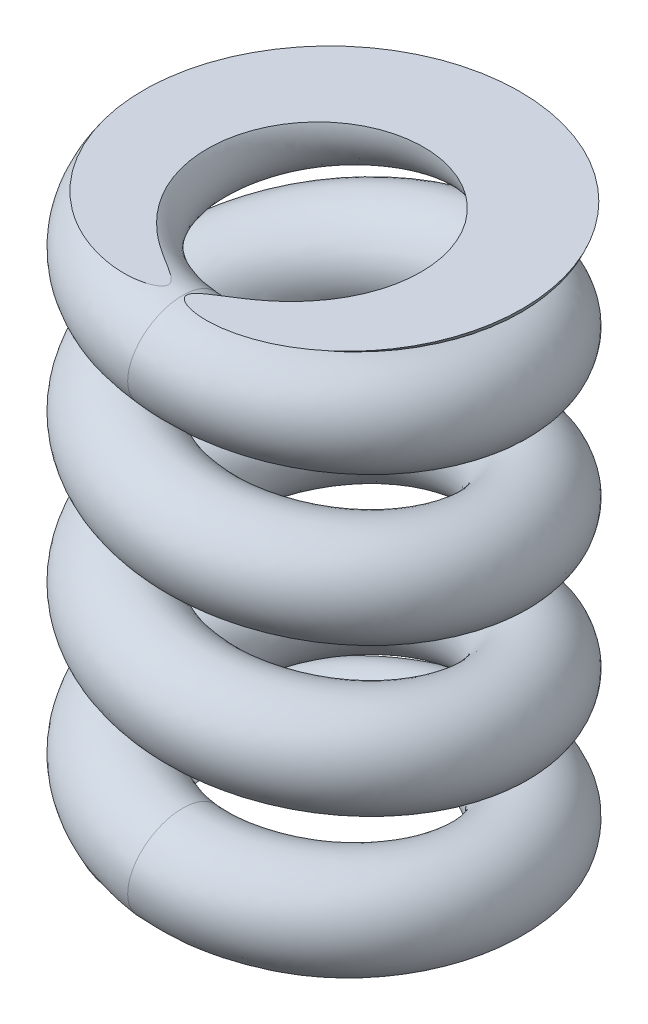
ISO-10303-21;
HEADER;
FILE_DESCRIPTION(('STEP AP214'),'2;1');
FILE_NAME('part.step','',(''),(''),'','','');
FILE_SCHEMA(('AUTOMOTIVE_DESIGN { 1 0 10303 214 1 1 1 1 }'));
ENDSEC;
DATA;
#1=APPLICATION_CONTEXT('core data for automotive mechanical design processes');
#2=APPLICATION_PROTOCOL_DEFINITION('international standard','automotive_design',2000,#1);
#3=PRODUCT_CONTEXT('',#1,'mechanical');
#4=PRODUCT('Part','Part','',(#3));
#5=PRODUCT_RELATED_PRODUCT_CATEGORY('part','',(#4));
#6=PRODUCT_DEFINITION_FORMATION('','',#4);
#7=PRODUCT_DEFINITION_CONTEXT('part definition',#1,'design');
#8=PRODUCT_DEFINITION('design','',#6,#7);
#9=PRODUCT_DEFINITION_SHAPE('','',#8);
#10=(LENGTH_UNIT() NAMED_UNIT(*) SI_UNIT(.MILLI.,.METRE.));
#11=(NAMED_UNIT(*) PLANE_ANGLE_UNIT() SI_UNIT($,.RADIAN.));
#12=(NAMED_UNIT(*) SI_UNIT($,.STERADIAN.) SOLID_ANGLE_UNIT());
#13=UNCERTAINTY_MEASURE_WITH_UNIT(LENGTH_MEASURE(1.E-05),#10,'distance_accuracy_value','');
#14=(GEOMETRIC_REPRESENTATION_CONTEXT(3) GLOBAL_UNCERTAINTY_ASSIGNED_CONTEXT((#13)) GLOBAL_UNIT_ASSIGNED_CONTEXT((#10,
#11,#12)) REPRESENTATION_CONTEXT('',''));
#15=CARTESIAN_POINT('',(0.,0.,0.));
#16=DIRECTION('',(0.,0.,1.));
#17=DIRECTION('',(1.,0.,0.));
#18=AXIS2_PLACEMENT_3D('',#15,#16,#17);
#19=CARTESIAN_POINT('',(0.206008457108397,-2.05841603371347,5.99053089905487));
#20=CARTESIAN_POINT('',(-0.18599982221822,-2.01683495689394,5.98139075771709));
#21=CARTESIAN_POINT('',(-0.971489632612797,-1.93351653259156,5.96307612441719));
#22=CARTESIAN_POINT('',(-2.11515847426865,-1.80848188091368,5.64679519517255));
#23=CARTESIAN_POINT('',(-3.17703563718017,-1.68336168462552,5.12813324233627));
#24=CARTESIAN_POINT('',(-4.22055393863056,-1.54463532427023,4.33075709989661));
#25=CARTESIAN_POINT('',(-5.14311303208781,-1.39175883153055,3.20984891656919));
#26=CARTESIAN_POINT('',(-5.79792820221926,-1.22506363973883,1.76924384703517));
#27=CARTESIAN_POINT('',(-6.05942874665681,-1.05842302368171,0.208482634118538));
#28=CARTESIAN_POINT('',(-5.90646237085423,-0.891764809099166,-1.36694456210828));
#29=CARTESIAN_POINT('',(-5.35086732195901,-0.725067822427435,-2.84876577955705));
#30=CARTESIAN_POINT('',(-4.43200176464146,-0.55842196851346,-4.13717853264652));
#31=CARTESIAN_POINT('',(-3.20993994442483,-0.391762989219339,-5.14308653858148));
#32=CARTESIAN_POINT('',(-1.76925735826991,-0.225069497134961,-5.79802948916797));
#33=CARTESIAN_POINT('',(-0.208468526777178,-0.0584214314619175,-6.05931055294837));
#34=CARTESIAN_POINT('',(1.36693982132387,0.108236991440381,-5.90648546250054));
#35=CARTESIAN_POINT('',(2.84877379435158,0.274930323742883,-5.35088284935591));
#36=CARTESIAN_POINT('',(4.13716005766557,0.441579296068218,-4.43197321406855));
#37=CARTESIAN_POINT('',(5.1431072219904,0.608235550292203,-3.20996455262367));
#38=CARTESIAN_POINT('',(5.79803560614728,0.774930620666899,-1.76925307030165));
#39=CARTESIAN_POINT('',(6.05914956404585,0.94158318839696,-0.208456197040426));
#40=CARTESIAN_POINT('',(5.90677305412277,1.10822872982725,1.36700016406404));
#41=CARTESIAN_POINT('',(5.35073496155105,1.27492979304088,2.84865612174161));
#42=CARTESIAN_POINT('',(4.50783515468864,1.42776545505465,4.02992575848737));
#43=CARTESIAN_POINT('',(3.52134466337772,1.56662909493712,4.89827682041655));
#44=CARTESIAN_POINT('',(2.50174268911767,1.69128780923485,5.48896350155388));
#45=CARTESIAN_POINT('',(1.36904214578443,1.81769608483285,5.88055267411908));
#46=CARTESIAN_POINT('',(0.626227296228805,1.8968342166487,5.95366775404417));
#47=CARTESIAN_POINT('',(0.256620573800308,1.93621143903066,5.99004805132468));
#48=CARTESIAN_POINT('',(0.206008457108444,-2.05841603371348,9.89053089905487));
#49=CARTESIAN_POINT('',(-0.44140546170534,-2.01688661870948,9.86673422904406));
#50=CARTESIAN_POINT('',(-1.73866642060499,-1.93367171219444,9.81905145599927));
#51=CARTESIAN_POINT('',(-3.61269067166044,-1.80755760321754,9.2731888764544));
#52=CARTESIAN_POINT('',(-5.35888212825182,-1.68213908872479,8.39195900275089));
#53=CARTESIAN_POINT('',(-7.0630593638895,-1.54477445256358,7.05033945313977));
#54=CARTESIAN_POINT('',(-8.55729547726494,-1.39244620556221,5.18618677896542));
#55=CARTESIAN_POINT('',(-9.6095244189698,-1.22324813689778,2.78728189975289));
#56=CARTESIAN_POINT('',(-10.0036676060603,-1.05820230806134,0.208349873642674));
#57=CARTESIAN_POINT('',(-9.71792248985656,-0.892206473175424,-2.38492677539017));
#58=CARTESIAN_POINT('',(-8.76590345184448,-0.723609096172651,-4.82388772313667));
#59=CARTESIAN_POINT('',(-7.22106496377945,-0.557974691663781,-6.92618477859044));
#60=CARTESIAN_POINT('',(-5.18513575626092,-0.392214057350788,-8.55807015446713));
#61=CARTESIAN_POINT('',(-2.78744854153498,-0.223652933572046,-9.60943370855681));
#62=CARTESIAN_POINT('',(-0.208515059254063,-0.0579418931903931,-10.0036047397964));
#63=CARTESIAN_POINT('',(2.38502656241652,0.1077795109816,-9.71791684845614));
#64=CARTESIAN_POINT('',(4.82387660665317,0.276340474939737,-8.7659210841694));
#65=CARTESIAN_POINT('',(6.92615742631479,0.442091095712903,-7.22104523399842));
#66=CARTESIAN_POINT('',(8.55808862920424,0.607735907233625,-5.18517982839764));
#67=CARTESIAN_POINT('',(9.60946853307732,0.776331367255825,-2.78733932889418));
#68=CARTESIAN_POINT('',(10.003388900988,0.942321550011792,-0.208682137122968));
#69=CARTESIAN_POINT('',(9.71839451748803,1.10737230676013,2.38493216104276));
#70=CARTESIAN_POINT('',(8.76498050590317,1.2765762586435,4.82490312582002));
#71=CARTESIAN_POINT('',(7.3503737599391,1.42886362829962,6.74943898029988));
#72=CARTESIAN_POINT('',(5.7033701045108,1.5663656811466,8.16204043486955));
#73=CARTESIAN_POINT('',(3.99903052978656,1.69132226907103,9.11532766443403));
#74=CARTESIAN_POINT('',(2.1389939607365,1.81880951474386,9.73603274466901));
#75=CARTESIAN_POINT('',(0.882131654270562,1.89784281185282,9.83887574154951));
#76=CARTESIAN_POINT('',(0.25674733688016,1.93716787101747,9.89004793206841));
#77=CARTESIAN_POINT('',(-0.205484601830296,-5.93664674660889,9.89053089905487));
#78=CARTESIAN_POINT('',(-0.851314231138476,-5.89511950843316,9.83974518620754));
#79=CARTESIAN_POINT('',(-2.14540065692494,-5.81190896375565,9.73798289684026));
#80=CARTESIAN_POINT('',(-3.99581300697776,-5.68576392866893,9.11597352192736));
#81=CARTESIAN_POINT('',(-5.70385397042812,-5.56038341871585,8.16281150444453));
#82=CARTESIAN_POINT('',(-7.35002565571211,-5.42300149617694,6.75021673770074));
#83=CARTESIAN_POINT('',(-8.76516519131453,-5.27067296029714,4.82570052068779));
#84=CARTESIAN_POINT('',(-9.71867631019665,-5.10148190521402,2.38568546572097));
#85=CARTESIAN_POINT('',(-10.0038828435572,-4.93642531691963,-0.208074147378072));
#86=CARTESIAN_POINT('',(-9.61010360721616,-4.77043844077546,-2.78684274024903));
#87=CARTESIAN_POINT('',(-8.55883564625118,-4.60184261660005,-5.18486556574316));
#88=CARTESIAN_POINT('',(-6.92693154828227,-4.43619554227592,-7.22096013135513));
#89=CARTESIAN_POINT('',(-4.82467884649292,-4.27044741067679,-8.76601979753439));
#90=CARTESIAN_POINT('',(-2.38577596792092,-4.1018862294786,-9.71822282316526));
#91=CARTESIAN_POINT('',(0.207907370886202,-3.93616253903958,-10.0040919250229));
#92=CARTESIAN_POINT('',(2.78695094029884,-3.77045401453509,-9.61007082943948));
#93=CARTESIAN_POINT('',(5.18482239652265,-3.60189265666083,-8.55881637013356));
#94=CARTESIAN_POINT('',(7.22097952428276,-3.43612971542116,-6.926958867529));
#95=CARTESIAN_POINT('',(8.76600250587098,-3.27049797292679,-4.82469080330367));
#96=CARTESIAN_POINT('',(9.71822634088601,-3.10189993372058,-2.38567516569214));
#97=CARTESIAN_POINT('',(10.0041634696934,-2.93590303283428,0.207741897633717));
#98=CARTESIAN_POINT('',(9.61012832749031,-2.77085567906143,2.78678016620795));
#99=CARTESIAN_POINT('',(8.55817028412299,-2.60167301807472,5.18587937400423));
#100=CARTESIAN_POINT('',(7.06339203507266,-2.44928709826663,7.05023022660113));
#101=CARTESIAN_POINT('',(5.36088672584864,-2.3120855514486,8.39200504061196));
#102=CARTESIAN_POINT('',(3.60892583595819,-2.18610413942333,9.27340373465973));
#103=CARTESIAN_POINT('',(1.75988196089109,-2.06233291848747,9.81833633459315));
#104=CARTESIAN_POINT('',(0.413890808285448,-1.97419258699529,9.86686547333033));
#105=CARTESIAN_POINT('',(-0.255841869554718,-1.93033608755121,9.89101240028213));
#106=CARTESIAN_POINT('',(-0.205484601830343,-5.93664674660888,5.99053089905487));
#107=CARTESIAN_POINT('',(-0.595908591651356,-5.89506784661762,5.95440171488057));
#108=CARTESIAN_POINT('',(-1.37822386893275,-5.81175378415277,5.88200756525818));
#109=CARTESIAN_POINT('',(-2.49828080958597,-5.68668820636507,5.48957984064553));
#110=CARTESIAN_POINT('',(-3.52200747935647,-5.56160601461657,4.89898574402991));
#111=CARTESIAN_POINT('',(-4.50752023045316,-5.42286236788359,4.03063438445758));
#112=CARTESIAN_POINT('',(-5.3509827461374,-5.26998558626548,2.84936265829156));
#113=CARTESIAN_POINT('',(-5.9070800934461,-5.10329740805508,1.36764741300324));
#114=CARTESIAN_POINT('',(-6.05964398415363,-4.93664603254,-0.207941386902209));
#115=CARTESIAN_POINT('',(-5.79864348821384,-4.76999677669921,-1.76886052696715));
#116=CARTESIAN_POINT('',(-5.14379951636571,-4.60330134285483,-3.20974362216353));
#117=CARTESIAN_POINT('',(-4.13786834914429,-4.4366428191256,-4.43195388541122));
#118=CARTESIAN_POINT('',(-2.84948303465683,-4.26999634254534,-5.35103618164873));
#119=CARTESIAN_POINT('',(-1.36758478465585,-4.10330279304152,-5.90681860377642));
#120=CARTESIAN_POINT('',(0.207953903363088,-3.9366420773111,-6.05979773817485));
#121=CARTESIAN_POINT('',(1.76886419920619,-3.76999653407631,-5.79863944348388));
#122=CARTESIAN_POINT('',(3.20971958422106,-3.60330280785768,-5.14377813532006));
#123=CARTESIAN_POINT('',(4.43198215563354,-3.43664151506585,-4.13788684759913));
#124=CARTESIAN_POINT('',(5.35102109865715,-3.26999832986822,-2.84947552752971));
#125=CARTESIAN_POINT('',(5.90679341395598,-3.10330068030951,-1.36758890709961));
#126=CARTESIAN_POINT('',(6.05992413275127,-2.93664139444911,0.20796783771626));
#127=CARTESIAN_POINT('',(5.79850686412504,-2.76999925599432,1.76884816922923));
#128=CARTESIAN_POINT('',(5.14392473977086,-2.60331948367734,3.20963236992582));
#129=CARTESIAN_POINT('',(4.2208534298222,-2.4503852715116,4.33071700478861));
#130=CARTESIAN_POINT('',(3.17886128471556,-2.31182213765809,5.12824142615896));
#131=CARTESIAN_POINT('',(2.11163799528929,-2.18613859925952,5.64703957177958));
#132=CARTESIAN_POINT('',(0.989930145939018,-2.06344634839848,5.96285626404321));
#133=CARTESIAN_POINT('',(0.157986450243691,-1.9752011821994,5.981657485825));
#134=CARTESIAN_POINT('',(-0.25596863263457,-1.93129251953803,5.99101251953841));
#135=CARTESIAN_POINT('',(-0.20548460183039,-5.93664674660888,2.09053089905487));
#136=CARTESIAN_POINT('',(-0.340502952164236,-5.89501618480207,2.06905824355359));
#137=CARTESIAN_POINT('',(-0.611047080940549,-5.81159860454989,2.02603223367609));
#138=CARTESIAN_POINT('',(-1.00074861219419,-5.68761248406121,1.86318615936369));
#139=CARTESIAN_POINT('',(-1.34016098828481,-5.5628286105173,1.63515998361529));
#140=CARTESIAN_POINT('',(-1.66501480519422,-5.42272323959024,1.31105203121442));
#141=CARTESIAN_POINT('',(-1.93680030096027,-5.26929821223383,0.873024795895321));
#142=CARTESIAN_POINT('',(-2.09548387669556,-5.10511291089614,0.349609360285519));
#143=CARTESIAN_POINT('',(-2.11540512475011,-4.93686674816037,-0.207808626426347));
#144=CARTESIAN_POINT('',(-1.98718336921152,-4.76955511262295,-0.750878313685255));
#145=CARTESIAN_POINT('',(-1.72876338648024,-4.60476006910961,-1.23462167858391));
#146=CARTESIAN_POINT('',(-1.34880515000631,-4.43709009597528,-1.6429476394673));
#147=CARTESIAN_POINT('',(-0.874287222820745,-4.2695452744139,-1.93605256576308));
#148=CARTESIAN_POINT('',(-0.349393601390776,-4.10471935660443,-2.09541438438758));
#149=CARTESIAN_POINT('',(0.208000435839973,-3.93712161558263,-2.11550355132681));
#150=CARTESIAN_POINT('',(0.750777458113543,-3.76953905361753,-1.98720805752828));
#151=CARTESIAN_POINT('',(1.23461677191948,-3.60471295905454,-1.72873990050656));
#152=CARTESIAN_POINT('',(1.64298478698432,-3.43715331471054,-1.34881482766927));
#153=CARTESIAN_POINT('',(1.93603969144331,-3.26949868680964,-0.874260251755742));
#154=CARTESIAN_POINT('',(2.09536048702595,-3.10470142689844,-0.34950264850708));
#155=CARTESIAN_POINT('',(2.11568479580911,-2.93737975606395,0.208193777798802));
#156=CARTESIAN_POINT('',(1.98688540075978,-2.76914283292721,0.750916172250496));
#157=CARTESIAN_POINT('',(1.72967919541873,-2.60496594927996,1.2333853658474));
#158=CARTESIAN_POINT('',(1.37831482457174,-2.45148344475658,1.6112037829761));
#159=CARTESIAN_POINT('',(0.996835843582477,-2.31155872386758,1.86447781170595));
#160=CARTESIAN_POINT('',(0.614350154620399,-2.1861730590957,2.02067540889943));
#161=CARTESIAN_POINT('',(0.21997833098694,-2.06455977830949,2.10737619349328));
#162=CARTESIAN_POINT('',(-0.0979179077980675,-1.97620977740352,2.09644949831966));
#163=CARTESIAN_POINT('',(-0.256095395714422,-1.93224895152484,2.09101263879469));
#164=CARTESIAN_POINT('',(0.20600845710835,-2.05841603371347,2.09053089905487));
#165=CARTESIAN_POINT('',(0.0694058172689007,-2.01678329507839,2.09604728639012));
#166=CARTESIAN_POINT('',(-0.204312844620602,-1.93336135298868,2.1071007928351));
#167=CARTESIAN_POINT('',(-0.61762627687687,-1.80940615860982,2.02040151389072));
#168=CARTESIAN_POINT('',(-0.995189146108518,-1.68458428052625,1.86430748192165));
#169=CARTESIAN_POINT('',(-1.37804851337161,-1.54449619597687,1.61117474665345));
#170=CARTESIAN_POINT('',(-1.72893058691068,-1.3910714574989,1.23351105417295));
#171=CARTESIAN_POINT('',(-1.98633198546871,-1.22687914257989,0.751205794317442));
#172=CARTESIAN_POINT('',(-2.11518988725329,-1.05864373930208,0.2086153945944));
#173=CARTESIAN_POINT('',(-2.09500225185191,-0.891323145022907,-0.348962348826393));
#174=CARTESIAN_POINT('',(-1.93583119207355,-0.726526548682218,-0.873643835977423));
#175=CARTESIAN_POINT('',(-1.64293856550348,-0.558869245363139,-1.3481722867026));
#176=CARTESIAN_POINT('',(-1.23474413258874,-0.391311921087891,-1.72810292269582));
#177=CARTESIAN_POINT('',(-0.751066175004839,-0.226486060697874,-1.98662526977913));
#178=CARTESIAN_POINT('',(-0.208421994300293,-0.0589009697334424,-2.11501636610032));
#179=CARTESIAN_POINT('',(0.348853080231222,0.10869447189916,-2.09505407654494));
#180=CARTESIAN_POINT('',(0.873670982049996,0.273520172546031,-1.93584461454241));
#181=CARTESIAN_POINT('',(1.34816268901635,0.441067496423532,-1.6429011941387));
#182=CARTESIAN_POINT('',(1.72812581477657,0.608735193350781,-1.23474927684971));
#183=CARTESIAN_POINT('',(1.98660267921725,0.773529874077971,-0.751166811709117));
#184=CARTESIAN_POINT('',(2.11491022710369,0.940844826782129,-0.208230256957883));
#185=CARTESIAN_POINT('',(2.09515159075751,1.10908515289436,0.349068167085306));
#186=CARTESIAN_POINT('',(1.93648941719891,1.27328332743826,0.872409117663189));
#187=CARTESIAN_POINT('',(1.66529654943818,1.42666728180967,1.31041253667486));
#188=CARTESIAN_POINT('',(1.33931922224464,1.56689250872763,1.63451320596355));
#189=CARTESIAN_POINT('',(1.00445484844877,1.69125334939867,1.86259933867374));
#190=CARTESIAN_POINT('',(0.599090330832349,1.81658265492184,2.02507260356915));
#191=CARTESIAN_POINT('',(0.370322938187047,1.89582562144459,2.06845976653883));
#192=CARTESIAN_POINT('',(0.256493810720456,1.93525500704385,2.09004817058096));
#193=CARTESIAN_POINT('',(0.206008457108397,-2.05841603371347,5.99053089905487));
#194=CARTESIAN_POINT('',(-0.18599982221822,-2.01683495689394,5.98139075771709));
#195=CARTESIAN_POINT('',(-0.971489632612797,-1.93351653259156,5.96307612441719));
#196=CARTESIAN_POINT('',(-2.11515847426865,-1.80848188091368,5.64679519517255));
#197=CARTESIAN_POINT('',(-3.17703563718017,-1.68336168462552,5.12813324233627));
#198=CARTESIAN_POINT('',(-4.22055393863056,-1.54463532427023,4.33075709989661));
#199=CARTESIAN_POINT('',(-5.14311303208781,-1.39175883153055,3.20984891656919));
#200=CARTESIAN_POINT('',(-5.79792820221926,-1.22506363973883,1.76924384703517));
#201=CARTESIAN_POINT('',(-6.05942874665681,-1.05842302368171,0.208482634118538));
#202=CARTESIAN_POINT('',(-5.90646237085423,-0.891764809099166,-1.36694456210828));
#203=CARTESIAN_POINT('',(-5.35086732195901,-0.725067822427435,-2.84876577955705));
#204=CARTESIAN_POINT('',(-4.43200176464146,-0.55842196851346,-4.13717853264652));
#205=CARTESIAN_POINT('',(-3.20993994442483,-0.391762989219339,-5.14308653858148));
#206=CARTESIAN_POINT('',(-1.76925735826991,-0.225069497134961,-5.79802948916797));
#207=CARTESIAN_POINT('',(-0.208468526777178,-0.0584214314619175,-6.05931055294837));
#208=CARTESIAN_POINT('',(1.36693982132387,0.108236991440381,-5.90648546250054));
#209=CARTESIAN_POINT('',(2.84877379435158,0.274930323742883,-5.35088284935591));
#210=CARTESIAN_POINT('',(4.13716005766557,0.441579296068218,-4.43197321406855));
#211=CARTESIAN_POINT('',(5.1431072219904,0.608235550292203,-3.20996455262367));
#212=CARTESIAN_POINT('',(5.79803560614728,0.774930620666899,-1.76925307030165));
#213=CARTESIAN_POINT('',(6.05914956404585,0.94158318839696,-0.208456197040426));
#214=CARTESIAN_POINT('',(5.90677305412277,1.10822872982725,1.36700016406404));
#215=CARTESIAN_POINT('',(5.35073496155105,1.27492979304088,2.84865612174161));
#216=CARTESIAN_POINT('',(4.50783515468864,1.42776545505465,4.02992575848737));
#217=CARTESIAN_POINT('',(3.52134466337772,1.56662909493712,4.89827682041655));
#218=CARTESIAN_POINT('',(2.50174268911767,1.69128780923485,5.48896350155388));
#219=CARTESIAN_POINT('',(1.36904214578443,1.81769608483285,5.88055267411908));
#220=CARTESIAN_POINT('',(0.626227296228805,1.8968342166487,5.95366775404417));
#221=CARTESIAN_POINT('',(0.256620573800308,1.93621143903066,5.99004805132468));
#222=(BOUNDED_SURFACE() B_SPLINE_SURFACE(3,3,((#19,#20,#21,#22,#23,#24,#25,#26,#27,#28,#29,#30,
#31,#32,#33,#34,#35,#36,#37,#38,#39,#40,#41,#42,#43,#44,#45,#46,#47),(#48,#49,#50,#51,#52,#53,
#54,#55,#56,#57,#58,#59,#60,#61,#62,#63,#64,#65,#66,#67,#68,#69,#70,#71,#72,#73,#74,#75,#76),
(#77,#78,#79,#80,#81,#82,#83,#84,#85,#86,#87,#88,#89,#90,#91,#92,#93,#94,#95,#96,#97,#98,#99,
#100,#101,#102,#103,#104,#105),(#106,#107,#108,#109,#110,#111,#112,#113,#114,#115,#116,#117,
#118,#119,#120,#121,#122,#123,#124,#125,#126,#127,#128,#129,#130,#131,#132,#133,#134),(#135,
#136,#137,#138,#139,#140,#141,#142,#143,#144,#145,#146,#147,#148,#149,#150,#151,#152,#153,#154,
#155,#156,#157,#158,#159,#160,#161,#162,#163),(#164,#165,#166,#167,#168,#169,#170,#171,#172,
#173,#174,#175,#176,#177,#178,#179,#180,#181,#182,#183,#184,#185,#186,#187,#188,#189,#190,#191,
#192),(#193,#194,#195,#196,#197,#198,#199,#200,#201,#202,#203,#204,#205,#206,#207,#208,#209,
#210,#211,#212,#213,#214,#215,#216,#217,#218,#219,#220,#221)),.UNSPECIFIED.,.T.,.F.,
.F.) B_SPLINE_SURFACE_WITH_KNOTS((4,3,4),(4,1,1,1,1,1,1,1,1,1,1,1,1,1,1,1,1,1,1,1,1,1,1,1,1,1,
4),(0.,0.5,1.),(0.,0.031223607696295,0.0625645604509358,0.0938646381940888,0.125138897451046,
0.166799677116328,0.208458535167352,0.250122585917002,0.291786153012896,0.333443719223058,
0.375107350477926,0.416771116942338,0.458428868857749,0.500092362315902,0.54175615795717,
0.583413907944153,0.625077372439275,0.666741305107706,0.708398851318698,0.75006212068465,
0.791726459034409,0.833385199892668,0.875045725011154,0.906320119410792,0.937619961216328,
0.968961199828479,1.),
.UNSPECIFIED.) GEOMETRIC_REPRESENTATION_ITEM() RATIONAL_B_SPLINE_SURFACE(((1.,1.,1.,1.,1.,1.,1.,
1.,1.,1.,1.,1.,1.,1.,1.,1.,1.,1.,1.,1.,1.,1.,1.,1.,1.,1.,1.,1.,1.),(0.333333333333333,
0.333333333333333,0.333333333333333,0.333333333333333,0.333333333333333,0.333333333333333,
0.333333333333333,0.333333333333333,0.333333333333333,0.333333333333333,0.333333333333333,
0.333333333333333,0.333333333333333,0.333333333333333,0.333333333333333,0.333333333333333,
0.333333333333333,0.333333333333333,0.333333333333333,0.333333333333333,0.333333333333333,
0.333333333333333,0.333333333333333,0.333333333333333,0.333333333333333,0.333333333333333,
0.333333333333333,0.333333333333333,0.333333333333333),(0.333333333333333,0.333333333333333,
0.333333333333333,0.333333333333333,0.333333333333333,0.333333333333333,0.333333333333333,
0.333333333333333,0.333333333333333,0.333333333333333,0.333333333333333,0.333333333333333,
0.333333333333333,0.333333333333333,0.333333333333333,0.333333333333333,0.333333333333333,
0.333333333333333,0.333333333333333,0.333333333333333,0.333333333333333,0.333333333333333,
0.333333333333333,0.333333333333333,0.333333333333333,0.333333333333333,0.333333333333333,
0.333333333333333,0.333333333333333),(1.,1.,1.,1.,1.,1.,1.,1.,1.,1.,1.,1.,1.,1.,1.,1.,1.,1.,1.,
1.,1.,1.,1.,1.,1.,1.,1.,1.,1.),(0.333333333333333,0.333333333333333,0.333333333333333,
0.333333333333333,0.333333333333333,0.333333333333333,0.333333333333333,0.333333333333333,
0.333333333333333,0.333333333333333,0.333333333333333,0.333333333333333,0.333333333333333,
0.333333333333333,0.333333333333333,0.333333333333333,0.333333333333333,0.333333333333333,
0.333333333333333,0.333333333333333,0.333333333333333,0.333333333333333,0.333333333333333,
0.333333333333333,0.333333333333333,0.333333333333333,0.333333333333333,0.333333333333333,
0.333333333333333),(0.333333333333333,0.333333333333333,0.333333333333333,0.333333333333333,
0.333333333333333,0.333333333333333,0.333333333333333,0.333333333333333,0.333333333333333,
0.333333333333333,0.333333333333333,0.333333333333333,0.333333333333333,0.333333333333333,
0.333333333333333,0.333333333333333,0.333333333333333,0.333333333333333,0.333333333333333,
0.333333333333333,0.333333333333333,0.333333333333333,0.333333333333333,0.333333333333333,
0.333333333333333,0.333333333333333,0.333333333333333,0.333333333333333,0.333333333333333),(1.,
1.,1.,1.,1.,1.,1.,1.,1.,1.,1.,1.,1.,1.,1.,1.,1.,1.,1.,1.,1.,1.,1.,1.,1.,1.,1.,1.,1.))) REPRESENTATION_ITEM('') SURFACE());
#223=CARTESIAN_POINT('',(0.256620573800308,1.93621143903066,5.99004805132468));
#224=CARTESIAN_POINT('',(0.25674733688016,1.93716787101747,9.89004793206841));
#225=CARTESIAN_POINT('',(-0.255841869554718,-1.93033608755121,9.89101240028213));
#226=CARTESIAN_POINT('',(-0.25596863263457,-1.93129251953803,5.99101251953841));
#227=CARTESIAN_POINT('',(-0.256095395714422,-1.93224895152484,2.09101263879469));
#228=CARTESIAN_POINT('',(0.256493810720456,1.93525500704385,2.09004817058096));
#229=CARTESIAN_POINT('',(0.256620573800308,1.93621143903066,5.99004805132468));
#230=(BOUNDED_CURVE() B_SPLINE_CURVE(3,(#223,#224,#225,#226,#227,#228,#229),.UNSPECIFIED.,.T.,
.F.) B_SPLINE_CURVE_WITH_KNOTS((4,3,4),(0.,0.5,1.),
.UNSPECIFIED.) CURVE() GEOMETRIC_REPRESENTATION_ITEM() RATIONAL_B_SPLINE_CURVE((1.,
0.333333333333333,0.333333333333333,1.,0.333333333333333,0.333333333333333,1.)) REPRESENTATION_ITEM(''));
#231=CARTESIAN_POINT('',(0.256620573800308,1.93621143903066,5.99004805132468));
#232=VERTEX_POINT('',#231);
#233=EDGE_CURVE('E10',#232,#232,#230,.F.);
#234=CARTESIAN_POINT('',(-0.344114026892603,-2.00000000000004,5.97276683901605));
#235=CARTESIAN_POINT('',(-0.345277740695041,-2.00000000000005,5.9853278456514));
#236=CARTESIAN_POINT('',(-0.347610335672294,-2.00000000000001,5.99778618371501));
#237=CARTESIAN_POINT('',(-0.354417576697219,-1.99999999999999,6.02210248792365));
#238=CARTESIAN_POINT('',(-0.358895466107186,-2.,6.03395951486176));
#239=CARTESIAN_POINT('',(-0.378301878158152,-2.00000000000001,6.07542338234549));
#240=CARTESIAN_POINT('',(-0.398396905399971,-2.,6.10260759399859));
#241=CARTESIAN_POINT('',(-0.431384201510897,-2.,6.1376680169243));
#242=CARTESIAN_POINT('',(-0.44215618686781,-2.,6.14793823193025));
#243=CARTESIAN_POINT('',(-0.464537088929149,-2.,6.16752614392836));
#244=CARTESIAN_POINT('',(-0.476144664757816,-2.,6.17684531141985));
#245=CARTESIAN_POINT('',(-0.511949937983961,-2.,6.20362112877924));
#246=CARTESIAN_POINT('',(-0.537064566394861,-2.00000000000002,6.21983132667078));
#247=CARTESIAN_POINT('',(-0.592549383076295,-2.00000000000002,6.25199654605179));
#248=CARTESIAN_POINT('',(-0.623144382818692,-2.00000000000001,6.26755207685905));
#249=CARTESIAN_POINT('',(-0.685499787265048,-1.99999999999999,6.29615733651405));
#250=CARTESIAN_POINT('',(-0.717261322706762,-2.,6.30920455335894));
#251=CARTESIAN_POINT('',(-0.781581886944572,-2.,6.33325504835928));
#252=CARTESIAN_POINT('',(-0.814141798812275,-2.,6.34425593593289));
#253=CARTESIAN_POINT('',(-0.87981015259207,-2.,6.36449156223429));
#254=CARTESIAN_POINT('',(-0.912918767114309,-2.,6.3737257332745));
#255=CARTESIAN_POINT('',(-1.0184320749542,-2.,6.40046911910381));
#256=CARTESIAN_POINT('',(-1.09158770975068,-2.,6.41505333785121));
#257=CARTESIAN_POINT('',(-1.23888599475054,-2.,6.43801738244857));
#258=CARTESIAN_POINT('',(-1.31302955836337,-2.,6.44639099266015));
#259=CARTESIAN_POINT('',(-1.46181049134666,-2.,6.45789735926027));
#260=CARTESIAN_POINT('',(-1.53644839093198,-2.,6.46102304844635));
#261=CARTESIAN_POINT('',(-1.6857788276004,-2.,6.46266342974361));
#262=CARTESIAN_POINT('',(-1.76047137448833,-2.,6.46117666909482));
#263=CARTESIAN_POINT('',(-1.97248396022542,-2.,6.45113292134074));
#264=CARTESIAN_POINT('',(-2.10959160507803,-2.,6.43767755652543));
#265=CARTESIAN_POINT('',(-2.31398794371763,-2.,6.4088557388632));
#266=CARTESIAN_POINT('',(-2.3819440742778,-2.,6.3978007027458));
#267=CARTESIAN_POINT('',(-2.51737515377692,-2.,6.3730241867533));
#268=CARTESIAN_POINT('',(-2.5848500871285,-2.,6.35930262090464));
#269=CARTESIAN_POINT('',(-2.78651396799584,-2.,6.31427864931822));
#270=CARTESIAN_POINT('',(-2.91985984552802,-2.,6.27912884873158));
#271=CARTESIAN_POINT('',(-3.1835719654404,-2.,6.19925141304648));
#272=CARTESIAN_POINT('',(-3.31393927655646,-2.,6.15452727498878));
#273=CARTESIAN_POINT('',(-3.57786725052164,-2.,6.05338630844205));
#274=CARTESIAN_POINT('',(-3.71124162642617,-2.,5.99648251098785));
#275=CARTESIAN_POINT('',(-3.97347138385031,-2.,5.87305913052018));
#276=CARTESIAN_POINT('',(-4.10232619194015,-2.,5.80653833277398));
#277=CARTESIAN_POINT('',(-4.35493455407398,-2.,5.66462700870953));
#278=CARTESIAN_POINT('',(-4.47869165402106,-2.,5.58924279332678));
#279=CARTESIAN_POINT('',(-4.72072657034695,-2.,5.43018553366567));
#280=CARTESIAN_POINT('',(-4.8390041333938,-2.00000000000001,5.34651210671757));
#281=CARTESIAN_POINT('',(-5.22789153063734,-2.00000000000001,5.05129278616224));
#282=CARTESIAN_POINT('',(-5.48508180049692,-2.,4.82167889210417));
#283=CARTESIAN_POINT('',(-5.9616695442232,-2.,4.32587983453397));
#284=CARTESIAN_POINT('',(-6.18103099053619,-2.,4.05966023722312));
#285=CARTESIAN_POINT('',(-6.4877940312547,-2.,3.62479738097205));
#286=CARTESIAN_POINT('',(-6.59003389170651,-2.,3.4664202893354));
#287=CARTESIAN_POINT('',(-6.78147272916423,-2.,3.14192117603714));
#288=CARTESIAN_POINT('',(-6.870670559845,-2.,2.97579847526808));
#289=CARTESIAN_POINT('',(-7.0355789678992,-2.,2.6369931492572));
#290=CARTESIAN_POINT('',(-7.11128908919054,-2.,2.46431030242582));
#291=CARTESIAN_POINT('',(-7.24877146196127,-2.,2.11348481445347));
#292=CARTESIAN_POINT('',(-7.31054378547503,-2.,1.93534220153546));
#293=CARTESIAN_POINT('',(-7.42277193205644,-2.,1.56519926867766));
#294=CARTESIAN_POINT('',(-7.47245548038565,-2.,1.37296460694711));
#295=CARTESIAN_POINT('',(-7.55593130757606,-2.,0.985073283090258));
#296=CARTESIAN_POINT('',(-7.58972287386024,-2.,0.789416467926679));
#297=CARTESIAN_POINT('',(-7.64125814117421,-2.,0.395969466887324));
#298=CARTESIAN_POINT('',(-7.65899939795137,-2.,0.198178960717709));
#299=CARTESIAN_POINT('',(-7.67834471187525,-2.,-0.19818737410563));
#300=CARTESIAN_POINT('',(-7.67994852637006,-2.,-0.396763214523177));
#301=CARTESIAN_POINT('',(-7.66700332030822,-2.,-0.799795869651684));
#302=CARTESIAN_POINT('',(-7.6519319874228,-2.,-1.00423593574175));
#303=CARTESIAN_POINT('',(-7.60499877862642,-2.,-1.41117972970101));
#304=CARTESIAN_POINT('',(-7.57313676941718,-2.,-1.61368344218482));
#305=CARTESIAN_POINT('',(-7.49281120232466,-2.,-2.01539414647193));
#306=CARTESIAN_POINT('',(-7.44434573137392,-2.,-2.21460075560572));
#307=CARTESIAN_POINT('',(-7.33132401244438,-2.,-2.60839733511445));
#308=CARTESIAN_POINT('',(-7.26676706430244,-2.,-2.8029871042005));
#309=CARTESIAN_POINT('',(-7.12027529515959,-2.,-3.19118109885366));
#310=CARTESIAN_POINT('',(-7.03794034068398,-2.,-3.38463445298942));
#311=CARTESIAN_POINT('',(-6.85744705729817,-2.,-3.76401279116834));
#312=CARTESIAN_POINT('',(-6.75928875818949,-2.,-3.94993778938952));
#313=CARTESIAN_POINT('',(-6.54785477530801,-2.,-4.31298379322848));
#314=CARTESIAN_POINT('',(-6.43457887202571,-2.,-4.49010467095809));
#315=CARTESIAN_POINT('',(-6.19381137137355,-2.,-4.8344049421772));
#316=CARTESIAN_POINT('',(-6.06631957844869,-2.,-5.00158419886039));
#317=CARTESIAN_POINT('',(-5.79584511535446,-2.,-5.32741686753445));
#318=CARTESIAN_POINT('',(-5.65264898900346,-2.,-5.48589320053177));
#319=CARTESIAN_POINT('',(-5.35345899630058,-2.,-5.79026555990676));
#320=CARTESIAN_POINT('',(-5.19746494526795,-2.,-5.93616140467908));
#321=CARTESIAN_POINT('',(-4.87387163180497,-2.,-6.21448139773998));
#322=CARTESIAN_POINT('',(-4.70627142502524,-2.,-6.34690444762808));
#323=CARTESIAN_POINT('',(-4.36064823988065,-2.,-6.59736832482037));
#324=CARTESIAN_POINT('',(-4.18262533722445,-2.,-6.7154092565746));
#325=CARTESIAN_POINT('',(-3.81572319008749,-2.,-6.93721374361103));
#326=CARTESIAN_POINT('',(-3.62676126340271,-2.,-7.04084053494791));
#327=CARTESIAN_POINT('',(-3.24086077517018,-2.,-7.23198871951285));
#328=CARTESIAN_POINT('',(-3.04392202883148,-2.,-7.31950973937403));
#329=CARTESIAN_POINT('',(-2.64344709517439,-2.,-7.47789148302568));
#330=CARTESIAN_POINT('',(-2.43991075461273,-2.,-7.5487518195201));
#331=CARTESIAN_POINT('',(-2.02761931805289,-2.,-7.67317780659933));
#332=CARTESIAN_POINT('',(-1.81886427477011,-2.,-7.72674363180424));
#333=CARTESIAN_POINT('',(-1.39574847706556,-2.,-7.81665120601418));
#334=CARTESIAN_POINT('',(-1.18135447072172,-2.,-7.85283640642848));
#335=CARTESIAN_POINT('',(-0.750283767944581,-2.,-7.90709077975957));
#336=CARTESIAN_POINT('',(-0.53360704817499,-2.,-7.92515976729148));
#337=CARTESIAN_POINT('',(-0.0994994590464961,-2.,-7.94294625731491));
#338=CARTESIAN_POINT('',(0.11793140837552,-2.,-7.9426638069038));
#339=CARTESIAN_POINT('',(0.551991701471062,-2.,-7.92375309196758));
#340=CARTESIAN_POINT('',(0.768621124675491,-2.,-7.9051247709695));
#341=CARTESIAN_POINT('',(1.19969717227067,-2.,-7.84973868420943));
#342=CARTESIAN_POINT('',(1.41414223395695,-2.,-7.81296875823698));
#343=CARTESIAN_POINT('',(1.83916949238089,-2.,-7.72147491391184));
#344=CARTESIAN_POINT('',(2.04975171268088,-2.,-7.66675110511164));
#345=CARTESIAN_POINT('',(2.46554537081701,-2.,-7.53969758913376));
#346=CARTESIAN_POINT('',(2.67075653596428,-2.,-7.46736698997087));
#347=CARTESIAN_POINT('',(3.07438968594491,-2.,-7.30575104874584));
#348=CARTESIAN_POINT('',(3.27281160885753,-2.,-7.21646555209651));
#349=CARTESIAN_POINT('',(3.66158719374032,-2.,-7.02143023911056));
#350=CARTESIAN_POINT('',(3.85193460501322,-2.,-6.91566795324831));
#351=CARTESIAN_POINT('',(4.22294341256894,-2.,-6.6883351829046));
#352=CARTESIAN_POINT('',(4.4036048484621,-2.,-6.56676476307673));
#353=CARTESIAN_POINT('',(4.75396877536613,-2.,-6.30877426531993));
#354=CARTESIAN_POINT('',(4.92367213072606,-2.,-6.17235536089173));
#355=CARTESIAN_POINT('',(5.25089177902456,-2.,-5.8856054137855));
#356=CARTESIAN_POINT('',(5.4084081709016,-2.,-5.73527448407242));
#357=CARTESIAN_POINT('',(5.70890521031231,-2.,-5.4227956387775));
#358=CARTESIAN_POINT('',(5.8519818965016,-2.,-5.26074008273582));
#359=CARTESIAN_POINT('',(6.12387720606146,-2.,-4.92507986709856));
#360=CARTESIAN_POINT('',(6.25269572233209,-2.,-4.75147512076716));
#361=CARTESIAN_POINT('',(6.49514420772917,-2.,-4.39395387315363));
#362=CARTESIAN_POINT('',(6.60877374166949,-2.,-4.21003707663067));
#363=CARTESIAN_POINT('',(6.81986051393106,-2.,-3.83314330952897));
#364=CARTESIAN_POINT('',(6.91731784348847,-2.,-3.64016639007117));
#365=CARTESIAN_POINT('',(7.09445151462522,-2.,-3.24862198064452));
#366=CARTESIAN_POINT('',(7.17430107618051,-2.,-3.05013279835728));
#367=CARTESIAN_POINT('',(7.31693395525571,-2.,-2.64711247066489));
#368=CARTESIAN_POINT('',(7.37971742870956,-2.,-2.44258138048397));
#369=CARTESIAN_POINT('',(7.48755740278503,-2.,-2.02889938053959));
#370=CARTESIAN_POINT('',(7.53261450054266,-2.,-1.81974862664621));
#371=CARTESIAN_POINT('',(7.6045501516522,-2.,-1.39834374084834));
#372=CARTESIAN_POINT('',(7.63142879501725,-2.,-1.18608962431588));
#373=CARTESIAN_POINT('',(7.66659398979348,-2.,-0.762679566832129));
#374=CARTESIAN_POINT('',(7.67510543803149,-2.,-0.551542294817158));
#375=CARTESIAN_POINT('',(7.67395657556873,-2.,-0.129318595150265));
#376=CARTESIAN_POINT('',(7.66429704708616,-2.,0.081767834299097));
#377=CARTESIAN_POINT('',(7.62670136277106,-2.,0.502289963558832));
#378=CARTESIAN_POINT('',(7.59876677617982,-2.,0.711725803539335));
#379=CARTESIAN_POINT('',(7.52481897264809,-2.,1.12737974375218));
#380=CARTESIAN_POINT('',(7.47880616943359,-2.,1.33359791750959));
#381=CARTESIAN_POINT('',(7.37021607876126,-2.,1.73622461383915));
#382=CARTESIAN_POINT('',(7.30807121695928,-2.,1.93274970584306));
#383=CARTESIAN_POINT('',(7.16697258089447,-2.,2.31967719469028));
#384=CARTESIAN_POINT('',(7.08801868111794,-2.,2.51007954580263));
#385=CARTESIAN_POINT('',(6.91387265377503,-2.,2.8833183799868));
#386=CARTESIAN_POINT('',(6.81867981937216,-2.,3.06615453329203));
#387=CARTESIAN_POINT('',(6.61259688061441,-2.,3.42275690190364));
#388=CARTESIAN_POINT('',(6.50170769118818,-2.,3.59652364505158));
#389=CARTESIAN_POINT('',(6.26863314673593,-2.,3.92789264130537));
#390=CARTESIAN_POINT('',(6.1469348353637,-2.,4.08583742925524));
#391=CARTESIAN_POINT('',(5.89015276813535,-2.,4.39045972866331));
#392=CARTESIAN_POINT('',(5.75506860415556,-2.,4.53713689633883));
#393=CARTESIAN_POINT('',(5.47238156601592,-2.,4.81792772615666));
#394=CARTESIAN_POINT('',(5.32477746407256,-2.00000000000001,4.95204015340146));
#395=CARTESIAN_POINT('',(5.01797378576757,-1.99999999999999,5.20627789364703));
#396=CARTESIAN_POINT('',(4.85877514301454,-1.99999999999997,5.32640433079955));
#397=CARTESIAN_POINT('',(4.53851689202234,-1.99999999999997,5.54520778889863));
#398=CARTESIAN_POINT('',(4.37800413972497,-1.99999999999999,5.64468467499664));
#399=CARTESIAN_POINT('',(4.04839647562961,-2.00000000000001,5.82832477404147));
#400=CARTESIAN_POINT('',(3.87930114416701,-2.,5.91248723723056));
#401=CARTESIAN_POINT('',(3.53403312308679,-2.,6.06386509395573));
#402=CARTESIAN_POINT('',(3.35787302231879,-2.,6.13110920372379));
#403=CARTESIAN_POINT('',(2.99988095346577,-2.,6.24807299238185));
#404=CARTESIAN_POINT('',(2.81805224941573,-2.00000000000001,6.29780256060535));
#405=CARTESIAN_POINT('',(2.55515486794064,-2.,6.35535432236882));
#406=CARTESIAN_POINT('',(2.47573195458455,-1.99999999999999,6.37090618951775));
#407=CARTESIAN_POINT('',(2.31627030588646,-2.00000000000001,6.39827645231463));
#408=CARTESIAN_POINT('',(2.2362316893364,-2.00000000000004,6.41009555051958));
#409=CARTESIAN_POINT('',(1.99551412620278,-1.99999999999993,6.43918001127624));
#410=CARTESIAN_POINT('',(1.83393651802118,-1.99999999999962,6.4501406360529));
#411=CARTESIAN_POINT('',(1.60667277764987,-1.99999999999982,6.45025120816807));
#412=CARTESIAN_POINT('',(1.54093624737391,-1.99999999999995,6.44848010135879));
#413=CARTESIAN_POINT('',(1.40970512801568,-2.00000000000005,6.4408783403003));
#414=CARTESIAN_POINT('',(1.34421045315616,-2.00000000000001,6.43504929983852));
#415=CARTESIAN_POINT('',(1.21358703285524,-1.99999999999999,6.41874454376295));
#416=CARTESIAN_POINT('',(1.14846003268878,-2.,6.4082545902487));
#417=CARTESIAN_POINT('',(1.01935114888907,-2.,6.38181298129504));
#418=CARTESIAN_POINT('',(0.955368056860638,-2.,6.36586749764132));
#419=CARTESIAN_POINT('',(0.860731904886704,-2.,6.33699242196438));
#420=CARTESIAN_POINT('',(0.829327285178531,-2.,6.32650645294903));
#421=CARTESIAN_POINT('',(0.76723293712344,-2.,6.30361144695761));
#422=CARTESIAN_POINT('',(0.736542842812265,-2.,6.29120342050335));
#423=CARTESIAN_POINT('',(0.676381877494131,-2.,6.26413615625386));
#424=CARTESIAN_POINT('',(0.646904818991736,-2.,6.24949080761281));
#425=CARTESIAN_POINT('',(0.58961740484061,-2.,6.2172698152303));
#426=CARTESIAN_POINT('',(0.561803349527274,-2.,6.19970103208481));
#427=CARTESIAN_POINT('',(0.518672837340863,-2.,6.16767039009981));
#428=CARTESIAN_POINT('',(0.502484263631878,-2.,6.15439508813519));
#429=CARTESIAN_POINT('',(0.471968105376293,-2.,6.1258344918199));
#430=CARTESIAN_POINT('',(0.457637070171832,-2.,6.110553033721));
#431=CARTESIAN_POINT('',(0.436134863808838,-2.,6.08297643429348));
#432=CARTESIAN_POINT('',(0.428149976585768,-2.,6.07132330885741));
#433=CARTESIAN_POINT('',(0.414075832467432,-2.,6.0469350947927));
#434=CARTESIAN_POINT('',(0.407981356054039,-2.,6.03420311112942));
#435=CARTESIAN_POINT('',(0.398994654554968,-2.,6.00987072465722));
#436=CARTESIAN_POINT('',(0.395752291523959,-2.,5.99840126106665));
#437=CARTESIAN_POINT('',(0.391277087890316,-2.,5.97507818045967));
#438=CARTESIAN_POINT('',(0.390042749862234,-2.,5.96322485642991));
#439=CARTESIAN_POINT('',(0.389635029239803,-2.,5.93949890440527));
#440=CARTESIAN_POINT('',(0.390459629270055,-2.,5.92762630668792));
#441=CARTESIAN_POINT('',(0.393986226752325,-2.,5.9041634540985));
#442=CARTESIAN_POINT('',(0.396690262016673,-2.,5.89257351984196));
#443=CARTESIAN_POINT('',(0.410493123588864,-2.,5.84759572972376));
#444=CARTESIAN_POINT('',(0.427648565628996,-2.,5.8161077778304));
#445=CARTESIAN_POINT('',(0.460472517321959,-2.,5.76904307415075));
#446=CARTESIAN_POINT('',(0.47429961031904,-2.,5.75191852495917));
#447=CARTESIAN_POINT('',(0.503537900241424,-2.,5.71905906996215));
#448=CARTESIAN_POINT('',(0.518947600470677,-2.,5.70332287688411));
#449=CARTESIAN_POINT('',(0.55091344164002,-2.,5.67284146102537));
#450=CARTESIAN_POINT('',(0.567477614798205,-2.,5.65810496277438));
#451=CARTESIAN_POINT('',(0.601319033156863,-2.,5.62948237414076));
#452=CARTESIAN_POINT('',(0.618596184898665,-2.,5.61559617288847));
#453=CARTESIAN_POINT('',(0.661504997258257,-2.,5.58239074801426));
#454=CARTESIAN_POINT('',(0.68740939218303,-2.,5.56342699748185));
#455=CARTESIAN_POINT('',(0.739854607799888,-2.,5.52639614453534));
#456=CARTESIAN_POINT('',(0.766395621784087,-2.,5.50832931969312));
#457=CARTESIAN_POINT('',(0.819889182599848,-2.,5.47274566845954));
#458=CARTESIAN_POINT('',(0.846842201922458,-2.,5.45522955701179));
#459=CARTESIAN_POINT('',(0.900952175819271,-2.,5.42051433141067));
#460=CARTESIAN_POINT('',(0.928109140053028,-2.,5.40331523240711));
#461=CARTESIAN_POINT('',(1.00976255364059,-2.,5.35192610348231));
#462=CARTESIAN_POINT('',(1.06440441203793,-2.,5.31796819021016));
#463=CARTESIAN_POINT('',(1.17344086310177,-2.,5.24995610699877));
#464=CARTESIAN_POINT('',(1.22783573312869,-1.99999999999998,5.21590238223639));
#465=CARTESIAN_POINT('',(1.33620613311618,-2.00000000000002,5.14721852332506));
#466=CARTESIAN_POINT('',(1.39018194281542,-2.00000000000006,5.11258883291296));
#467=CARTESIAN_POINT('',(1.49759091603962,-1.99999999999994,5.04249749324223));
#468=CARTESIAN_POINT('',(1.55102408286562,-1.99999999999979,5.00703584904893));
#469=CARTESIAN_POINT('',(1.68489949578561,-1.9999999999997,4.91648994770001));
#470=CARTESIAN_POINT('',(1.76493043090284,-1.99999999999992,4.8607954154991));
#471=CARTESIAN_POINT('',(1.92337399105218,-2.00000000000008,4.7471351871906));
#472=CARTESIAN_POINT('',(2.00178652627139,-2.00000000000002,4.68916936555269));
#473=CARTESIAN_POINT('',(2.1565372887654,-1.99999999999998,4.57049661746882));
#474=CARTESIAN_POINT('',(2.23287520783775,-1.99999999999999,4.50978928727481));
#475=CARTESIAN_POINT('',(2.38303506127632,-2.00000000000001,4.38533933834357));
#476=CARTESIAN_POINT('',(2.45685715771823,-2.,4.32159691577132));
#477=CARTESIAN_POINT('',(2.60160399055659,-2.,4.19072083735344));
#478=CARTESIAN_POINT('',(2.67252518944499,-2.,4.12358325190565));
#479=CARTESIAN_POINT('',(2.81102843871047,-2.,3.98595410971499));
#480=CARTESIAN_POINT('',(2.87861030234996,-2.,3.91546236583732));
#481=CARTESIAN_POINT('',(3.07591115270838,-2.,3.69905575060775));
#482=CARTESIAN_POINT('',(3.20026020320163,-2.,3.54814234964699));
#483=CARTESIAN_POINT('',(3.4023629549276,-2.,3.27468747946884));
#484=CARTESIAN_POINT('',(3.48385709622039,-2.,3.15488268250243));
#485=CARTESIAN_POINT('',(3.63702010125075,-2.,2.90914674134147));
#486=CARTESIAN_POINT('',(3.70869052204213,-2.,2.78321657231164));
#487=CARTESIAN_POINT('',(3.84130932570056,-2.,2.5259274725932));
#488=CARTESIAN_POINT('',(3.90226480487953,-2.,2.39457220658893));
#489=CARTESIAN_POINT('',(4.01270362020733,-2.,2.12711490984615));
#490=CARTESIAN_POINT('',(4.0621869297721,-2.,1.99101286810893));
#491=CARTESIAN_POINT('',(4.14930654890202,-2.,1.71443726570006));
#492=CARTESIAN_POINT('',(4.18689271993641,-2.,1.57394787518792));
#493=CARTESIAN_POINT('',(4.2493561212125,-2.,1.29015962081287));
#494=CARTESIAN_POINT('',(4.27423261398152,-2.,1.14686059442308));
#495=CARTESIAN_POINT('',(4.31091080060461,-2.,0.858567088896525));
#496=CARTESIAN_POINT('',(4.32271136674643,-2.,0.713572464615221));
#497=CARTESIAN_POINT('',(4.33295360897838,-2.,0.423178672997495));
#498=CARTESIAN_POINT('',(4.33139689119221,-2.,0.277779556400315));
#499=CARTESIAN_POINT('',(4.30722485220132,-2.,-0.137328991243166));
#500=CARTESIAN_POINT('',(4.26764043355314,-2.,-0.406339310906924));
#501=CARTESIAN_POINT('',(4.1733356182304,-2.,-0.800986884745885));
#502=CARTESIAN_POINT('',(4.13605938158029,-2.,-0.931103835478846));
#503=CARTESIAN_POINT('',(4.04993604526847,-2.,-1.18750567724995));
#504=CARTESIAN_POINT('',(4.00108972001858,-2.,-1.31379082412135));
#505=CARTESIAN_POINT('',(3.89499236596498,-2.,-1.55504681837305));
#506=CARTESIAN_POINT('',(3.83830241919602,-2.,-1.67026557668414));
#507=CARTESIAN_POINT('',(3.71515620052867,-2.,-1.89536984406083));
#508=CARTESIAN_POINT('',(3.64870000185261,-2.,-2.00525539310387));
#509=CARTESIAN_POINT('',(3.50647149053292,-2.,-2.21878250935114));
#510=CARTESIAN_POINT('',(3.43070140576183,-2.,-2.32242556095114));
#511=CARTESIAN_POINT('',(3.27040928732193,-2.,-2.52270467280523));
#512=CARTESIAN_POINT('',(3.18588767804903,-2.,-2.61934107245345));
#513=CARTESIAN_POINT('',(3.01136516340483,-2.,-2.80184508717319));
#514=CARTESIAN_POINT('',(2.92161712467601,-2.,-2.88795445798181));
#515=CARTESIAN_POINT('',(2.73499887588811,-2.,-3.05207475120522));
#516=CARTESIAN_POINT('',(2.63812864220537,-2.,-3.13008564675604));
#517=CARTESIAN_POINT('',(2.43807440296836,-2.,-3.27749202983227));
#518=CARTESIAN_POINT('',(2.33489172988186,-2.,-3.34688932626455));
#519=CARTESIAN_POINT('',(2.1228766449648,-2.,-3.47653063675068));
#520=CARTESIAN_POINT('',(2.01404239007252,-2.,-3.53677163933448));
#521=CARTESIAN_POINT('',(1.79424034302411,-2.,-3.64622629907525));
#522=CARTESIAN_POINT('',(1.68338761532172,-2.,-3.69567120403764));
#523=CARTESIAN_POINT('',(1.45789319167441,-2.,-3.78499457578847));
#524=CARTESIAN_POINT('',(1.34325155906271,-2.,-3.8248732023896));
#525=CARTESIAN_POINT('',(1.1109803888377,-2.,-3.89471805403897));
#526=CARTESIAN_POINT('',(0.993350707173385,-2.,-3.9246838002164));
#527=CARTESIAN_POINT('',(0.756009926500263,-2.,-3.97448619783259));
#528=CARTESIAN_POINT('',(0.636299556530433,-2.,-3.99432632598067));
#529=CARTESIAN_POINT('',(0.396575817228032,-2.,-4.02365749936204));
#530=CARTESIAN_POINT('',(0.276572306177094,-2.,-4.03322903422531));
#531=CARTESIAN_POINT('',(0.0361870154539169,-2.,-4.04208747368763));
#532=CARTESIAN_POINT('',(-0.0841947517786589,-2.,-4.0413747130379));
#533=CARTESIAN_POINT('',(-0.324454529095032,-2.,-4.02969354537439));
#534=CARTESIAN_POINT('',(-0.444332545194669,-2.,-4.01872526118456));
#535=CARTESIAN_POINT('',(-0.682742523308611,-2.,-3.98673734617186));
#536=CARTESIAN_POINT('',(-0.801274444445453,-2.,-3.96571741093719));
#537=CARTESIAN_POINT('',(-1.03536649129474,-2.,-3.91390901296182));
#538=CARTESIAN_POINT('',(-1.15094103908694,-2.,-3.88318573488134));
#539=CARTESIAN_POINT('',(-1.37909918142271,-2.,-3.81215110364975));
#540=CARTESIAN_POINT('',(-1.49168288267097,-2.,-3.77184009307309));
#541=CARTESIAN_POINT('',(-1.71309250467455,-2.,-3.68196412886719));
#542=CARTESIAN_POINT('',(-1.82191845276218,-2.,-3.63239924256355));
#543=CARTESIAN_POINT('',(-2.03504955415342,-2.,-3.5243434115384));
#544=CARTESIAN_POINT('',(-2.13935453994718,-2.,-3.4658521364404));
#545=CARTESIAN_POINT('',(-2.3434413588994,-2.,-3.33997350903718));
#546=CARTESIAN_POINT('',(-2.44318711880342,-2.,-3.27252769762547));
#547=CARTESIAN_POINT('',(-2.63672496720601,-2.,-3.12958095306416));
#548=CARTESIAN_POINT('',(-2.73051725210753,-2.,-3.05408028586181));
#549=CARTESIAN_POINT('',(-2.91144025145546,-2.,-2.89547599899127));
#550=CARTESIAN_POINT('',(-2.99857091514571,-2.,-2.81237232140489));
#551=CARTESIAN_POINT('',(-3.16560045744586,-2.,-2.63919057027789));
#552=CARTESIAN_POINT('',(-3.2454990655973,-2.,-2.54911223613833));
#553=CARTESIAN_POINT('',(-3.39842792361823,-2.,-2.36174869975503));
#554=CARTESIAN_POINT('',(-3.47137877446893,-2.,-2.26439871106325));
#555=CARTESIAN_POINT('',(-3.60900429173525,-2.,-2.06396675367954));
#556=CARTESIAN_POINT('',(-3.67367617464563,-2.,-1.96088287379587));
#557=CARTESIAN_POINT('',(-3.79430749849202,-2.,-1.74974688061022));
#558=CARTESIAN_POINT('',(-3.85026735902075,-2.,-1.64169500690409));
#559=CARTESIAN_POINT('',(-3.95320131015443,-2.,-1.42139472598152));
#560=CARTESIAN_POINT('',(-4.00017532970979,-2.,-1.30914628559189));
#561=CARTESIAN_POINT('',(-4.08591615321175,-2.,-1.07836388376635));
#562=CARTESIAN_POINT('',(-4.12444906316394,-2.,-0.95974298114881));
#563=CARTESIAN_POINT('',(-4.19160711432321,-2.,-0.719771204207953));
#564=CARTESIAN_POINT('',(-4.22023511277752,-2.,-0.598421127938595));
#565=CARTESIAN_POINT('',(-4.26754948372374,-2.,-0.353780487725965));
#566=CARTESIAN_POINT('',(-4.28623437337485,-2.,-0.230489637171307));
#567=CARTESIAN_POINT('',(-4.31352036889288,-2.,0.0172006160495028));
#568=CARTESIAN_POINT('',(-4.32212160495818,-2.,0.141600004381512));
#569=CARTESIAN_POINT('',(-4.32937629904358,-2.,0.394350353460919));
#570=CARTESIAN_POINT('',(-4.32772954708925,-2.,0.522709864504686));
#571=CARTESIAN_POINT('',(-4.31406082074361,-2.,0.778874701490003));
#572=CARTESIAN_POINT('',(-4.30203834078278,-2.,0.906680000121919));
#573=CARTESIAN_POINT('',(-4.26780204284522,-2.,1.1609454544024));
#574=CARTESIAN_POINT('',(-4.24558599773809,-2.,1.28740530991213));
#575=CARTESIAN_POINT('',(-4.19121325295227,-2.,1.53816309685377));
#576=CARTESIAN_POINT('',(-4.15905656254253,-2.,1.66246103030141));
#577=CARTESIAN_POINT('',(-4.08337608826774,-2.,1.91426794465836));
#578=CARTESIAN_POINT('',(-4.03936868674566,-2.,2.04163160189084));
#579=CARTESIAN_POINT('',(-3.94129927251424,-2.,2.2924256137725));
#580=CARTESIAN_POINT('',(-3.88723686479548,-2.,2.41585581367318));
#581=CARTESIAN_POINT('',(-3.7696379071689,-2.,2.658098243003));
#582=CARTESIAN_POINT('',(-3.70610197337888,-2.,2.77691077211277));
#583=CARTESIAN_POINT('',(-3.57025118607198,-2.,3.00940030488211));
#584=CARTESIAN_POINT('',(-3.49793601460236,-2.,3.12307712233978));
#585=CARTESIAN_POINT('',(-3.33913408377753,-2.,3.35344408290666));
#586=CARTESIAN_POINT('',(-3.25198149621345,-1.99999999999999,3.46967555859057));
#587=CARTESIAN_POINT('',(-3.0689582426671,-2.00000000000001,3.69504260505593));
#588=CARTESIAN_POINT('',(-2.97308740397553,-2.00000000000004,3.80417803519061));
#589=CARTESIAN_POINT('',(-2.77364211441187,-1.99999999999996,4.01511409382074));
#590=CARTESIAN_POINT('',(-2.67006883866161,-1.99999999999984,4.11691583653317));
#591=CARTESIAN_POINT('',(-2.45618086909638,-2.00000000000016,4.31313709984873));
#592=CARTESIAN_POINT('',(-2.34586648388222,-2.00000000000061,4.40755695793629));
#593=CARTESIAN_POINT('',(-2.15482450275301,-2.00000000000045,4.56135364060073));
#594=CARTESIAN_POINT('',(-2.07552325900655,-2.00000000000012,4.62252184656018));
#595=CARTESIAN_POINT('',(-1.91477144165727,-1.99999999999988,4.74194027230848));
#596=CARTESIAN_POINT('',(-1.83332111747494,-1.99999999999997,4.80019082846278));
#597=CARTESIAN_POINT('',(-1.66872095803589,-2.00000000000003,4.91419525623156));
#598=CARTESIAN_POINT('',(-1.58557143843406,-2.00000000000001,4.96994958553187));
#599=CARTESIAN_POINT('',(-1.41786957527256,-1.99999999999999,5.07930129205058));
#600=CARTESIAN_POINT('',(-1.33331720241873,-2.,5.13289862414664));
#601=CARTESIAN_POINT('',(-1.18633301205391,-2.,5.22446282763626));
#602=CARTESIAN_POINT('',(-1.12409372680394,-2.,5.26274199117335));
#603=CARTESIAN_POINT('',(-0.99959646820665,-2.,5.33918632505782));
#604=CARTESIAN_POINT('',(-0.937338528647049,-2.00000000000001,5.37735155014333));
#605=CARTESIAN_POINT('',(-0.836393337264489,-2.,5.44049990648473));
#606=CARTESIAN_POINT('',(-0.797496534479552,-2.,5.46514329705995));
#607=CARTESIAN_POINT('',(-0.720371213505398,-2.,5.51559971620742));
#608=CARTESIAN_POINT('',(-0.682143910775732,-2.,5.54141461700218));
#609=CARTESIAN_POINT('',(-0.608800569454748,-2.,5.59398253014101));
#610=CARTESIAN_POINT('',(-0.573621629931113,-2.,5.62064445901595));
#611=CARTESIAN_POINT('',(-0.522971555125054,-2.,5.66309834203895));
#612=CARTESIAN_POINT('',(-0.506461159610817,-2.,5.67763949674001));
#613=CARTESIAN_POINT('',(-0.4744582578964,-2.,5.70781936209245));
#614=CARTESIAN_POINT('',(-0.458965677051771,-2.,5.72345799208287));
#615=CARTESIAN_POINT('',(-0.432106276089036,-2.,5.75329116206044));
#616=CARTESIAN_POINT('',(-0.420491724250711,-2.,5.76726005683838));
#617=CARTESIAN_POINT('',(-0.398802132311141,-2.,5.79638154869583));
#618=CARTESIAN_POINT('',(-0.388727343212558,-2.,5.81153433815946));
#619=CARTESIAN_POINT('',(-0.372304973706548,-2.,5.84066409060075));
#620=CARTESIAN_POINT('',(-0.365619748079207,-2.,5.8544468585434));
#621=CARTESIAN_POINT('',(-0.354553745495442,-2.,5.88289903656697));
#622=CARTESIAN_POINT('',(-0.350165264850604,-2.00000000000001,5.897565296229));
#623=CARTESIAN_POINT('',(-0.34534718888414,-2.,5.92243039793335));
#624=CARTESIAN_POINT('',(-0.344081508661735,-1.99999999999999,5.93246730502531));
#625=CARTESIAN_POINT('',(-0.343000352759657,-2.00000000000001,5.9526136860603));
#626=CARTESIAN_POINT('',(-0.34318352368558,-2.00000000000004,5.96272308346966));
#627=CARTESIAN_POINT('',(-0.344114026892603,-2.00000000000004,5.97276683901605));
#628=B_SPLINE_CURVE_WITH_KNOTS('',3,(#234,#235,#236,#237,#238,#239,#240,#241,#242,#243,#244,
#245,#246,#247,#248,#249,#250,#251,#252,#253,#254,#255,#256,#257,#258,#259,#260,#261,#262,#263,
#264,#265,#266,#267,#268,#269,#270,#271,#272,#273,#274,#275,#276,#277,#278,#279,#280,#281,#282,
#283,#284,#285,#286,#287,#288,#289,#290,#291,#292,#293,#294,#295,#296,#297,#298,#299,#300,#301,
#302,#303,#304,#305,#306,#307,#308,#309,#310,#311,#312,#313,#314,#315,#316,#317,#318,#319,#320,
#321,#322,#323,#324,#325,#326,#327,#328,#329,#330,#331,#332,#333,#334,#335,#336,#337,#338,#339,
#340,#341,#342,#343,#344,#345,#346,#347,#348,#349,#350,#351,#352,#353,#354,#355,#356,#357,#358,
#359,#360,#361,#362,#363,#364,#365,#366,#367,#368,#369,#370,#371,#372,#373,#374,#375,#376,#377,
#378,#379,#380,#381,#382,#383,#384,#385,#386,#387,#388,#389,#390,#391,#392,#393,#394,#395,#396,
#397,#398,#399,#400,#401,#402,#403,#404,#405,#406,#407,#408,#409,#410,#411,#412,#413,#414,#415,
#416,#417,#418,#419,#420,#421,#422,#423,#424,#425,#426,#427,#428,#429,#430,#431,#432,#433,#434,
#435,#436,#437,#438,#439,#440,#441,#442,#443,#444,#445,#446,#447,#448,#449,#450,#451,#452,#453,
#454,#455,#456,#457,#458,#459,#460,#461,#462,#463,#464,#465,#466,#467,#468,#469,#470,#471,#472,
#473,#474,#475,#476,#477,#478,#479,#480,#481,#482,#483,#484,#485,#486,#487,#488,#489,#490,#491,
#492,#493,#494,#495,#496,#497,#498,#499,#500,#501,#502,#503,#504,#505,#506,#507,#508,#509,#510,
#511,#512,#513,#514,#515,#516,#517,#518,#519,#520,#521,#522,#523,#524,#525,#526,#527,#528,#529,
#530,#531,#532,#533,#534,#535,#536,#537,#538,#539,#540,#541,#542,#543,#544,#545,#546,#547,#548,
#549,#550,#551,#552,#553,#554,#555,#556,#557,#558,#559,#560,#561,#562,#563,#564,#565,#566,#567,
#568,#569,#570,#571,#572,#573,#574,#575,#576,#577,#578,#579,#580,#581,#582,#583,#584,#585,#586,
#587,#588,#589,#590,#591,#592,#593,#594,#595,#596,#597,#598,#599,#600,#601,#602,#603,#604,#605,
#606,#607,#608,#609,#610,#611,#612,#613,#614,#615,#616,#617,#618,#619,#620,#621,#622,#623,#624,
#625,#626,#627),.UNSPECIFIED.,.T.,.F.,(4,2,2,2,2,2,2,2,2,2,2,2,2,2,2,2,2,2,2,2,2,2,2,2,2,2,2,2,
2,2,2,2,2,2,2,2,2,2,2,2,2,2,2,2,2,2,2,2,2,2,2,2,2,2,2,2,2,2,2,2,2,2,2,2,2,2,2,2,2,2,2,2,2,2,2,2,
2,2,2,2,2,2,2,2,2,2,2,2,2,2,2,2,2,2,2,2,2,2,2,2,2,2,2,2,2,2,2,2,2,2,2,2,2,2,2,2,2,2,2,2,2,2,2,2,
2,2,2,2,2,2,2,2,2,2,2,2,2,2,2,2,2,2,2,2,2,2,2,2,2,2,2,2,2,2,2,2,2,2,2,2,2,2,2,2,2,2,2,2,2,2,2,2,
2,2,2,2,2,2,2,2,2,2,2,2,2,2,2,2,2,2,2,2,2,2,2,2,4),(0.,0.0378028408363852,0.0756630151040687,
0.174965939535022,0.219631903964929,0.264227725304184,0.353692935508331,0.456516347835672,
0.559442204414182,0.662487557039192,0.765565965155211,0.988983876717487,1.21262508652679,
1.43656722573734,1.66057990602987,2.07317726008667,2.27968999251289,2.4862093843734,
2.89949650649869,3.31263293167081,3.74724559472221,4.18191320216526,4.61627317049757,
5.05065320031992,6.08043625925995,7.11119471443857,7.67618765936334,8.24123023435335,
8.80629191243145,9.37135067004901,9.9663253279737,10.5613266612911,11.1564185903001,
11.7515194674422,12.3658019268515,12.9800892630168,13.5944474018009,14.2088322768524,
14.8388393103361,15.4688451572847,16.0988601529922,16.7288838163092,17.3688908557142,
18.0089071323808,18.6489755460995,19.2890393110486,19.9348131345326,20.5806019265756,
21.2264057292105,21.8722030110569,22.5237127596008,23.1752291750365,23.8267439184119,
24.4782606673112,25.1302147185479,25.7821647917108,26.434147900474,27.086136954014,
27.7386218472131,28.3911040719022,29.0435347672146,29.6959601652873,30.3437121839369,
30.9914690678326,31.639244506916,32.2870162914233,32.9280989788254,33.5691758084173,
34.2102310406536,34.8512830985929,35.4844401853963,36.1175700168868,36.7506454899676,
37.3837064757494,38.0012918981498,38.6188819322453,39.2364988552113,39.8540797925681,
40.4514962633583,41.0489309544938,41.6464243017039,42.2438695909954,42.809617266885,
43.3753926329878,43.9402011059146,44.5046901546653,44.7474054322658,44.9900750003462,
45.4745035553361,45.6716930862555,45.8688042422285,46.0665217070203,46.2640162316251,
46.3632968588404,46.4625254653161,46.5611613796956,46.6595690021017,46.7222612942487,
46.7848354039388,46.8270867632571,46.8692204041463,46.9048166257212,46.9403862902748,
46.9759211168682,47.0114945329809,47.1169419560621,47.1829716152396,47.2489393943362,
47.3154237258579,47.3818993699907,47.4781793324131,47.574488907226,47.6709187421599,
47.7673531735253,47.9603545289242,48.1528789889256,48.3452614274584,48.5376426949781,
48.8301140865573,49.1226016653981,49.415132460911,49.7076443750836,50.0005029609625,
50.2933779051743,50.8788275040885,51.313098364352,51.7473003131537,52.1812136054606,
52.6151279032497,53.0508472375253,53.4865918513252,53.922374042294,54.3581038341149,
55.1687994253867,55.5744426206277,55.9800586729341,56.3648251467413,56.7495887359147,
57.1342604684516,57.5189135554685,57.8915784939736,58.2642446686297,58.6368324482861,
59.0095425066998,59.3732483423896,59.7369481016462,60.100665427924,60.4642577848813,
60.8249788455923,61.1856881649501,61.5463931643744,61.9071090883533,62.2654515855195,
62.6237812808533,62.9821083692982,63.3404487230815,63.7012554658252,64.0620502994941,
64.4228478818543,64.7836589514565,65.1481939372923,65.5128511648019,65.8774908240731,
66.2421333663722,66.6158696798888,66.9894980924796,67.3631822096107,67.7368615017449,
68.1215380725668,68.5062333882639,68.8910127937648,69.2757918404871,69.6796051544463,
70.0834343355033,70.4872372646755,70.8910548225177,71.3264276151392,71.7618090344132,
72.1971241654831,72.632419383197,72.9328062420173,73.2331583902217,73.5334552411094,
73.833758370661,74.0529641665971,74.2720380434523,74.4101667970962,74.5485246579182,
74.6808021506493,74.7467711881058,74.8127353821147,74.867165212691,74.9216039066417,
74.9674156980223,75.0130728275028,75.0433281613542,75.0735552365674),.UNSPECIFIED.);
#629=CARTESIAN_POINT('',(-0.344114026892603,-2.00000000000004,5.97276683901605));
#630=VERTEX_POINT('',#629);
#631=EDGE_CURVE('E35',#630,#630,#628,.T.);
#632=ORIENTED_EDGE('',*,*,#233,.F.);
#633=EDGE_LOOP('',(#632));
#634=FACE_BOUND('',#633,.T.);
#635=ORIENTED_EDGE('',*,*,#631,.F.);
#636=EDGE_LOOP('',(#635));
#637=FACE_BOUND('',#636,.T.);
#638=ADVANCED_FACE('F29',(#634,#637),#222,.F.);
#639=CARTESIAN_POINT('',(0.256620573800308,1.93621143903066,5.99004805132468));
#640=CARTESIAN_POINT('',(-0.134489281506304,1.99845850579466,5.99004805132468));
#641=CARTESIAN_POINT('',(-0.85335632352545,2.11262055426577,5.98066954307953));
#642=CARTESIAN_POINT('',(-2.02673552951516,2.30401765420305,5.68516976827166));
#643=CARTESIAN_POINT('',(-3.09063281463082,2.49054973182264,5.18384341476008));
#644=CARTESIAN_POINT('',(-4.04524704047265,2.67826405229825,4.48154409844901));
#645=CARTESIAN_POINT('',(-4.8400718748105,2.8656746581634,3.6055821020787));
#646=CARTESIAN_POINT('',(-5.45130348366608,3.05320632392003,2.59234742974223));
#647=CARTESIAN_POINT('',(-5.85142502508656,3.24072929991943,1.47878010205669));
#648=CARTESIAN_POINT('',(-6.02880900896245,3.4281922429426,0.308969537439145));
#649=CARTESIAN_POINT('',(-5.97198093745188,3.61571627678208,-0.873056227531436));
#650=CARTESIAN_POINT('',(-5.68794767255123,3.80319763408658,-2.02163130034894));
#651=CARTESIAN_POINT('',(-5.18326818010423,3.99072111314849,-3.09195496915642));
#652=CARTESIAN_POINT('',(-4.48139006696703,4.17819525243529,-4.04446572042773));
#653=CARTESIAN_POINT('',(-3.60547838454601,4.36571963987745,-4.84015573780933));
#654=CARTESIAN_POINT('',(-2.59250202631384,4.55319607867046,-5.45153402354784));
#655=CARTESIAN_POINT('',(-1.47878087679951,4.74072006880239,-5.85147388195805));
#656=CARTESIAN_POINT('',(-0.308949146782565,4.92819582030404,-6.02867494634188));
#657=CARTESIAN_POINT('',(0.873047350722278,5.11571995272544,-5.97196288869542));
#658=CARTESIAN_POINT('',(2.02164186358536,5.30319589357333,-5.68799725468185));
#659=CARTESIAN_POINT('',(3.09196156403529,5.49071998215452,-5.18327333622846));
#660=CARTESIAN_POINT('',(4.04445612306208,5.67819587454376,-4.48137580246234));
#661=CARTESIAN_POINT('',(4.84015291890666,5.86571997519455,-3.60547770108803));
#662=CARTESIAN_POINT('',(5.4515384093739,6.05319587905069,-2.5925049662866));
#663=CARTESIAN_POINT('',(5.8514747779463,6.24071997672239,-1.47878072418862));
#664=CARTESIAN_POINT('',(6.02867348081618,6.42819587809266,-0.308948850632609));
#665=CARTESIAN_POINT('',(5.97196266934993,6.61571997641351,0.873047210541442));
#666=CARTESIAN_POINT('',(5.68799763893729,6.80319587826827,2.02164193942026));
#667=CARTESIAN_POINT('',(5.18327337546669,6.99071997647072,3.091961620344));
#668=CARTESIAN_POINT('',(4.48137572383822,7.17819587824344,4.04445607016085));
#669=CARTESIAN_POINT('',(3.60547769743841,7.36571997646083,4.84015290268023));
#670=CARTESIAN_POINT('',(2.59250497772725,7.55319587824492,5.45153842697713));
#671=CARTESIAN_POINT('',(1.47878072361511,7.74071997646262,5.8514747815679));
#672=CARTESIAN_POINT('',(0.308948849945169,7.92819587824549,6.02867347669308));
#673=CARTESIAN_POINT('',(-0.873047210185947,8.11571997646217,5.97196266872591));
#674=CARTESIAN_POINT('',(-2.02164193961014,8.30319587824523,5.68799763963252));
#675=CARTESIAN_POINT('',(-3.09196162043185,8.49071997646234,5.18327337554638));
#676=CARTESIAN_POINT('',(-4.04445607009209,8.67819587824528,4.48137572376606));
#677=CARTESIAN_POINT('',(-4.84015290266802,8.86571997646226,3.60547769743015));
#678=CARTESIAN_POINT('',(-5.45153842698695,9.05319587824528,2.59250497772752));
#679=CARTESIAN_POINT('',(-5.85147478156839,9.24071997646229,1.47878072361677));
#680=CARTESIAN_POINT('',(-6.02867347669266,9.42819587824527,0.308948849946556));
#681=CARTESIAN_POINT('',(-5.97196266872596,9.61571997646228,-0.873047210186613));
#682=CARTESIAN_POINT('',(-5.68799763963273,9.80319587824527,-2.02164193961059));
#683=CARTESIAN_POINT('',(-5.18327337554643,9.99071997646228,-3.09196162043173));
#684=CARTESIAN_POINT('',(-4.4813757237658,10.1781958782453,-4.04445607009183));
#685=CARTESIAN_POINT('',(-3.60547769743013,10.3657199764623,-4.84015290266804));
#686=CARTESIAN_POINT('',(-2.59250497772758,10.5531958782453,-5.45153842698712));
#687=CARTESIAN_POINT('',(-1.47878072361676,10.7407199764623,-5.85147478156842));
#688=CARTESIAN_POINT('',(-0.308948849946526,10.9281958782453,-6.02867347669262));
#689=CARTESIAN_POINT('',(0.873047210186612,11.1157199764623,-5.97196266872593));
#690=CARTESIAN_POINT('',(2.02164193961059,11.3031958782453,-5.6879976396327));
#691=CARTESIAN_POINT('',(3.09196162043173,11.4907199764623,-5.18327337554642));
#692=CARTESIAN_POINT('',(4.04445607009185,11.6781958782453,-4.48137572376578));
#693=CARTESIAN_POINT('',(4.8401529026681,11.8657199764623,-3.60547769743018));
#694=CARTESIAN_POINT('',(5.45153842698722,12.0531958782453,-2.5925049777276));
#695=CARTESIAN_POINT('',(5.85147478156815,12.2407199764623,-1.47878072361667));
#696=CARTESIAN_POINT('',(6.02867347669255,12.4281958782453,-0.308948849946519));
#697=CARTESIAN_POINT('',(5.97196266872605,12.6157199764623,0.873047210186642));
#698=CARTESIAN_POINT('',(5.68799763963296,12.8031958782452,2.02164193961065));
#699=CARTESIAN_POINT('',(5.18327337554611,12.9907199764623,3.09196162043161));
#700=CARTESIAN_POINT('',(4.48137572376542,13.1781958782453,4.04445607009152));
#701=CARTESIAN_POINT('',(3.60547769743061,13.3657199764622,4.84015290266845));
#702=CARTESIAN_POINT('',(2.59250497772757,13.5531958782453,5.45153842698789));
#703=CARTESIAN_POINT('',(1.47878072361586,13.7407199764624,5.85147478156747));
#704=CARTESIAN_POINT('',(0.30894884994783,13.9281958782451,6.02867347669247));
#705=CARTESIAN_POINT('',(-0.873047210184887,14.115719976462,5.97196266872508));
#706=CARTESIAN_POINT('',(-2.02164193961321,14.3031958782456,5.68799763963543));
#707=CARTESIAN_POINT('',(-3.09196162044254,14.4907199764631,5.1832733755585));
#708=CARTESIAN_POINT('',(-4.04445607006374,14.6781958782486,4.48137572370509));
#709=CARTESIAN_POINT('',(-4.84015290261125,14.8657199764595,3.60547769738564));
#710=CARTESIAN_POINT('',(-5.45153842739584,15.053195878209,2.59250497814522));
#711=CARTESIAN_POINT('',(-5.85147478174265,15.2407199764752,1.47878072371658));
#712=CARTESIAN_POINT('',(-6.02867347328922,15.4281958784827,0.308948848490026));
#713=CARTESIAN_POINT('',(-5.97196266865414,15.6157199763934,-0.873047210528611));
#714=CARTESIAN_POINT('',(-5.68799765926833,15.8031958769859,-2.02164193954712));
#715=CARTESIAN_POINT('',(-5.18327337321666,15.9907199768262,-3.09196161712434));
#716=CARTESIAN_POINT('',(-4.48137563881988,16.1781958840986,-4.04445603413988));
#717=CARTESIAN_POINT('',(-3.60547771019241,16.3657199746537,-4.84015293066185));
#718=CARTESIAN_POINT('',(-2.59250525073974,16.5531958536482,-5.45153871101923));
#719=CARTESIAN_POINT('',(-1.47878070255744,16.7407199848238,-5.8514746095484));
#720=CARTESIAN_POINT('',(-0.308948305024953,16.9281959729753,-6.02867202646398));
#721=CARTESIAN_POINT('',(0.87304738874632,17.115719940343,-5.97196347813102));
#722=CARTESIAN_POINT('',(2.02164221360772,17.3031955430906,-5.68800326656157));
#723=CARTESIAN_POINT('',(3.0919597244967,17.4907201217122,-5.18327040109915));
#724=CARTESIAN_POINT('',(4.04444765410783,17.6781969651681,-4.48135877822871));
#725=CARTESIAN_POINT('',(4.84016383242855,17.8657194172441,-3.60548594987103));
#726=CARTESIAN_POINT('',(5.45158297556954,18.0531927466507,-2.59254194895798));
#727=CARTESIAN_POINT('',(5.85142924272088,18.2407218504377,-1.47876708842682));
#728=CARTESIAN_POINT('',(6.02851690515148,18.4282041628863,-0.308906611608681));
#729=CARTESIAN_POINT('',(5.97212406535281,18.6157121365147,0.873052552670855));
#730=CARTESIAN_POINT('',(5.68834046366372,18.8031850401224,2.02172886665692));
#731=CARTESIAN_POINT('',(5.18298090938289,18.9907228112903,3.09175018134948));
#732=CARTESIAN_POINT('',(4.4804361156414,19.1782762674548,4.04414426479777));
#733=CARTESIAN_POINT('',(3.60778481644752,19.365415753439,4.84015726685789));
#734=CARTESIAN_POINT('',(2.58680802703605,19.5541584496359,5.45489191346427));
#735=CARTESIAN_POINT('',(1.49657502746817,19.7378308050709,5.84211279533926));
#736=CARTESIAN_POINT('',(0.647772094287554,19.8739538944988,5.98932876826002));
#737=CARTESIAN_POINT('',(0.256620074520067,19.9362076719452,5.98932876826));
#738=CARTESIAN_POINT('',(0.256493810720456,1.93525500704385,2.09004817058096));
#739=CARTESIAN_POINT('',(-0.184651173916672,2.00546541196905,2.09004817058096));
#740=CARTESIAN_POINT('',(0.059881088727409,2.10818269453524,2.13209395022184));
#741=CARTESIAN_POINT('',(-0.568235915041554,2.30271399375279,2.05684398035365));
#742=CARTESIAN_POINT('',(-0.898616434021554,2.48746936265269,1.92040548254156));
#743=CARTESIAN_POINT('',(-1.27153877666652,2.67763332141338,1.70726540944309));
#744=CARTESIAN_POINT('',(-1.57621555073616,2.86456533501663,1.42427426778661));
#745=CARTESIAN_POINT('',(-1.8254304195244,3.05096752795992,1.0894444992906));
#746=CARTESIAN_POINT('',(-2.00164006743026,3.23883918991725,0.712931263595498));
#747=CARTESIAN_POINT('',(-2.1037003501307,3.42679436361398,0.308877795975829));
#748=CARTESIAN_POINT('',(-2.12220221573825,3.61413184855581,-0.107617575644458));
#749=CARTESIAN_POINT('',(-2.06147274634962,3.80143553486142,-0.519822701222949));
#750=CARTESIAN_POINT('',(-1.919487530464,3.98903525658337,-0.911479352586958));
#751=CARTESIAN_POINT('',(-1.70571961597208,4.17656715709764,-1.26915170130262));
#752=CARTESIAN_POINT('',(-1.42456006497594,4.3640644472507,-1.5766736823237));
#753=CARTESIAN_POINT('',(-1.0901739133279,4.55152379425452,-1.82527783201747));
#754=CARTESIAN_POINT('',(-0.712757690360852,4.73905639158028,-2.0018074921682));
#755=CARTESIAN_POINT('',(-0.308688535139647,4.92653684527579,-2.10353516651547));
#756=CARTESIAN_POINT('',(0.107557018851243,5.11405843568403,-2.12219055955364));
#757=CARTESIAN_POINT('',(0.519796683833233,5.30153321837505,-2.06154120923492));
#758=CARTESIAN_POINT('',(0.911496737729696,5.48905796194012,-1.91948787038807));
#759=CARTESIAN_POINT('',(1.26914750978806,5.67653415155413,-1.70569848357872));
#760=CARTESIAN_POINT('',(1.57666942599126,5.86405806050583,-1.42456093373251));
#761=CARTESIAN_POINT('',(1.82528185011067,6.05153392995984,-1.09017817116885));
#762=CARTESIAN_POINT('',(2.00180846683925,6.23905804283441,-0.71275739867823));
#763=CARTESIAN_POINT('',(2.10353368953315,6.42653397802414,-0.308688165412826));
#764=CARTESIAN_POINT('',(2.12219032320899,6.61405804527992,0.107556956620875));
#765=CARTESIAN_POINT('',(2.06154156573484,6.80153396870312,0.519796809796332));
#766=CARTESIAN_POINT('',(1.9194879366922,6.9890580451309,0.911496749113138));
#767=CARTESIAN_POINT('',(1.70569843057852,7.17653397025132,1.26914743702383));
#768=CARTESIAN_POINT('',(1.42456091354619,7.36405804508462,1.57666942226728));
#769=CARTESIAN_POINT('',(1.09017817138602,7.55153397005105,1.82528187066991));
#770=CARTESIAN_POINT('',(0.71275740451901,7.73905804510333,2.00180846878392));
#771=CARTESIAN_POINT('',(0.308688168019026,7.92653397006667,2.10353368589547));
#772=CARTESIAN_POINT('',(-0.107556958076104,8.11405804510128,2.12219032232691));
#773=CARTESIAN_POINT('',(-0.519796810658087,8.30153397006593,2.06154156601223));
#774=CARTESIAN_POINT('',(-0.911496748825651,8.48905804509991,1.91948793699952));
#775=CARTESIAN_POINT('',(-1.26914743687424,8.67653397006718,1.70569843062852));
#776=CARTESIAN_POINT('',(-1.57666942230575,8.86405804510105,1.4245609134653));
#777=CARTESIAN_POINT('',(-1.82528187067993,9.05153397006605,1.09017817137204));
#778=CARTESIAN_POINT('',(-2.0018084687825,9.23905804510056,0.712757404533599));
#779=CARTESIAN_POINT('',(-2.10353368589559,9.42653397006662,0.308688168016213));
#780=CARTESIAN_POINT('',(-2.12219032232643,9.61405804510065,-0.107556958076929));
#781=CARTESIAN_POINT('',(-2.06154156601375,9.80153397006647,-0.519796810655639));
#782=CARTESIAN_POINT('',(-1.91948793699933,9.98905804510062,-0.911496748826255));
#783=CARTESIAN_POINT('',(-1.70569843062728,10.1765339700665,-1.26914743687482));
#784=CARTESIAN_POINT('',(-1.42456091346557,10.3640580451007,-1.57666942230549));
#785=CARTESIAN_POINT('',(-1.09017817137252,10.5515339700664,-1.82528187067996));
#786=CARTESIAN_POINT('',(-0.712757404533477,10.7390580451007,-2.00180846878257));
#787=CARTESIAN_POINT('',(-0.308688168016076,10.9265339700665,-2.10353368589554));
#788=CARTESIAN_POINT('',(0.107556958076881,11.1140580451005,-2.1221903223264));
#789=CARTESIAN_POINT('',(0.519796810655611,11.3015339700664,-2.06154156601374));
#790=CARTESIAN_POINT('',(0.911496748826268,11.4890580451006,-1.9194879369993));
#791=CARTESIAN_POINT('',(1.26914743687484,11.6765339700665,-1.70569843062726));
#792=CARTESIAN_POINT('',(1.57666942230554,11.8640580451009,-1.42456091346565));
#793=CARTESIAN_POINT('',(1.82528187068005,12.0515339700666,-1.09017817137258));
#794=CARTESIAN_POINT('',(2.0018084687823,12.2390580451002,-0.712757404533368));
#795=CARTESIAN_POINT('',(2.10353368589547,12.4265339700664,-0.308688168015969));
#796=CARTESIAN_POINT('',(2.12219032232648,12.6140580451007,0.107556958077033));
#797=CARTESIAN_POINT('',(2.06154156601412,12.8015339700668,0.519796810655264));
#798=CARTESIAN_POINT('',(1.91948793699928,12.9890580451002,0.911496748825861));
#799=CARTESIAN_POINT('',(1.70569843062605,13.1765339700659,1.26914743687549));
#800=CARTESIAN_POINT('',(1.42456091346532,13.3640580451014,1.57666942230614));
#801=CARTESIAN_POINT('',(1.09017817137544,13.5515339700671,1.82528187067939));
#802=CARTESIAN_POINT('',(0.712757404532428,13.7390580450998,2.00180846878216));
#803=CARTESIAN_POINT('',(0.308688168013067,13.9265339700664,2.10353368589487));
#804=CARTESIAN_POINT('',(-0.107556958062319,14.114058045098,2.12219032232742));
#805=CARTESIAN_POINT('',(-0.519796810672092,14.3015339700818,2.06154156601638));
#806=CARTESIAN_POINT('',(-0.911496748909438,14.4890580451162,1.91948793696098));
#807=CARTESIAN_POINT('',(-1.26914743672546,14.6765339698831,1.70569843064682));
#808=CARTESIAN_POINT('',(-1.57666942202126,14.8640580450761,1.42456091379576));
#809=CARTESIAN_POINT('',(-1.82528187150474,15.0515339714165,1.09017817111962));
#810=CARTESIAN_POINT('',(-2.00180846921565,15.2390580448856,0.71275740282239));
#811=CARTESIAN_POINT('',(-2.10353368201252,15.4265339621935,0.30868816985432));
#812=CARTESIAN_POINT('',(-2.12219032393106,15.6140580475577,-0.107556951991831));
#813=CARTESIAN_POINT('',(-2.06154158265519,15.8015340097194,-0.519796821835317));
#814=CARTESIAN_POINT('',(-1.91948792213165,15.989058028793,-0.911496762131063));
#815=CARTESIAN_POINT('',(-1.70569836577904,16.1765337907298,-1.26914737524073));
#816=CARTESIAN_POINT('',(-1.42456097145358,16.3640581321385,-1.57666942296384));
#817=CARTESIAN_POINT('',(-1.09017839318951,16.5515347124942,-1.8252821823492));
#818=CARTESIAN_POINT('',(-0.712757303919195,16.7390576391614,-2.00180831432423));
#819=CARTESIAN_POINT('',(-0.30868755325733,16.926531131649,-2.10353224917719));
#820=CARTESIAN_POINT('',(0.107557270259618,17.1140597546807,-2.12219105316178));
#821=CARTESIAN_POINT('',(0.519795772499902,17.3015440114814,-2.06154754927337));
#822=CARTESIAN_POINT('',(0.911493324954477,17.4890514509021,-1.91948639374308));
#823=CARTESIAN_POINT('',(1.2691458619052,17.6765012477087,-1.70567611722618));
#824=CARTESIAN_POINT('',(1.57668522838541,17.8640813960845,-1.4245584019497));
#825=CARTESIAN_POINT('',(1.82530710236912,18.0516310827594,-1.09025166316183));
#826=CARTESIAN_POINT('',(2.00175797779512,18.2389822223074,-0.712795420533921));
#827=CARTESIAN_POINT('',(2.10340340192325,18.4262789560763,-0.308476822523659));
#828=CARTESIAN_POINT('',(2.12225190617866,18.6142756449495,0.10773672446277));
#829=CARTESIAN_POINT('',(2.06219649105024,18.8021102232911,0.519307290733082));
#830=CARTESIAN_POINT('',(1.9190881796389,18.9884702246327,0.910892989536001));
#831=CARTESIAN_POINT('',(1.70536981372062,19.1757251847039,1.27024133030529));
#832=CARTESIAN_POINT('',(1.41900783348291,19.3646421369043,1.57700095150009));
#833=CARTESIAN_POINT('',(1.11403208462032,19.5541193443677,1.82683634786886));
#834=CARTESIAN_POINT('',(0.636623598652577,19.7315476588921,1.99247653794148));
#835=CARTESIAN_POINT('',(0.597735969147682,19.8794859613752,2.08932950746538));
#836=CARTESIAN_POINT('',(0.256304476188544,19.9338264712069,2.08932950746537));
#837=CARTESIAN_POINT('',(-0.256095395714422,-1.93224895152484,2.09101263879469));
#838=CARTESIAN_POINT('',(-0.697240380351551,-1.86203854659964,2.09101263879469));
#839=CARTESIAN_POINT('',(-0.592136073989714,-1.73586550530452,1.99297550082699));
#840=CARTESIAN_POINT('',(-1.1269481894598,-1.55076961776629,1.82863983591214));
#841=CARTESIAN_POINT('',(-1.41639151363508,-1.36354798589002,1.57851344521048));
#842=CARTESIAN_POINT('',(-1.70728921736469,-1.17402466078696,1.27162300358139));
#843=CARTESIAN_POINT('',(-1.9201140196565,-0.986936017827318,0.912046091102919));
#844=CARTESIAN_POINT('',(-2.06373044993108,-0.800526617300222,0.520182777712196));
#845=CARTESIAN_POINT('',(-2.12384634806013,-0.612709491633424,0.108319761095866));
#846=CARTESIAN_POINT('',(-2.10510095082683,-0.424704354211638,-0.308231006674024));
#847=CARTESIAN_POINT('',(-2.00346903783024,-0.237413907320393,-0.712873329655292));
#848=CARTESIAN_POINT('',(-1.8269653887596,-0.0500568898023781,-1.0906723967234));
#849=CARTESIAN_POINT('',(-1.57823725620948,0.137487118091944,-1.42528562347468));
#850=CARTESIAN_POINT('',(-1.27051666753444,0.325072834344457,-1.70669934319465));
#851=CARTESIAN_POINT('',(-0.912648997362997,0.512517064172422,-1.92075223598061));
#852=CARTESIAN_POINT('',(-0.520670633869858,0.700030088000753,-2.06301744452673));
#853=CARTESIAN_POINT('',(-0.108140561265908,0.887508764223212,-2.12380279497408));
#854=CARTESIAN_POINT('',(0.308441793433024,1.07504296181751,-2.105225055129));
#855=CARTESIAN_POINT('',(0.712835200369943,1.26251087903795,-2.00352058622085));
#856=CARTESIAN_POINT('',(1.09059914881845,1.45003938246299,-1.82694017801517));
#857=CARTESIAN_POINT('',(1.4252881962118,1.63751038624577,-1.57822154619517));
#858=CARTESIAN_POINT('',(1.70672158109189,1.82504030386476,-1.27051814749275));
#859=CARTESIAN_POINT('',(1.92075376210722,2.01251048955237,-0.912652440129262));
#860=CARTESIAN_POINT('',(2.06301148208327,2.20004008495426,-0.520671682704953));
#861=CARTESIAN_POINT('',(2.12380206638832,2.38751047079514,-0.108140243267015));
#862=CARTESIAN_POINT('',(2.1052264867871,2.57504013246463,0.308442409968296));
#863=CARTESIAN_POINT('',(2.0035207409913,2.76251047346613,0.712835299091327));
#864=CARTESIAN_POINT('',(1.8269398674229,2.95004012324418,1.09059892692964));
#865=CARTESIAN_POINT('',(1.57822154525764,3.13751047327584,1.42528813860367));
#866=CARTESIAN_POINT('',(1.27051820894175,3.32504012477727,1.70672164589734));
#867=CARTESIAN_POINT('',(0.912652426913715,3.51251047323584,1.92075377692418));
#868=CARTESIAN_POINT('',(0.520671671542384,3.70004012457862,2.06301146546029));
#869=CARTESIAN_POINT('',(0.108140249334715,3.88751047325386,2.12380206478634));
#870=CARTESIAN_POINT('',(-0.308442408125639,4.07504012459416,2.10522649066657));
#871=CARTESIAN_POINT('',(-0.712835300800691,4.26251047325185,2.00352074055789));
#872=CARTESIAN_POINT('',(-1.0905989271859,4.45004012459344,1.82693986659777));
#873=CARTESIAN_POINT('',(-1.42528813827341,4.63751047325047,1.57822154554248));
#874=CARTESIAN_POINT('',(-1.70672164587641,4.82504012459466,1.27051820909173));
#875=CARTESIAN_POINT('',(-1.92075377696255,5.01251047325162,0.91265242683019));
#876=CARTESIAN_POINT('',(-2.06301146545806,5.20004012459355,0.520671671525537));
#877=CARTESIAN_POINT('',(-2.12380206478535,5.38751047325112,0.108140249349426));
#878=CARTESIAN_POINT('',(-2.10522649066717,5.57504012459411,-0.308442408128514));
#879=CARTESIAN_POINT('',(-2.00352074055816,5.76251047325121,-0.712835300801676));
#880=CARTESIAN_POINT('',(-1.82693986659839,5.95004012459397,-1.09059892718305));
#881=CARTESIAN_POINT('',(-1.57822154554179,6.13751047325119,-1.4252881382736));
#882=CARTESIAN_POINT('',(-1.27051820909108,6.32504012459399,-1.70672164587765));
#883=CARTESIAN_POINT('',(-0.912652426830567,6.51251047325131,-1.92075377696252));
#884=CARTESIAN_POINT('',(-0.520671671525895,6.70004012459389,-2.0630114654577));
#885=CARTESIAN_POINT('',(-0.108140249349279,6.88751047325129,-2.12380206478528));
#886=CARTESIAN_POINT('',(0.308442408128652,7.07504012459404,-2.10522649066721));
#887=CARTESIAN_POINT('',(0.712835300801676,7.26251047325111,-2.00352074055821));
#888=CARTESIAN_POINT('',(1.09059892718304,7.45004012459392,-1.82693986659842));
#889=CARTESIAN_POINT('',(1.42528813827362,7.63751047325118,-1.57822154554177));
#890=CARTESIAN_POINT('',(1.70672164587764,7.82504012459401,-1.27051820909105));
#891=CARTESIAN_POINT('',(1.92075377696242,8.01251047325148,-0.912652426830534));
#892=CARTESIAN_POINT('',(2.06301146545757,8.2000401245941,-0.520671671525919));
#893=CARTESIAN_POINT('',(2.12380206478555,8.38751047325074,-0.108140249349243));
#894=CARTESIAN_POINT('',(2.10522649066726,8.57504012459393,0.308442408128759));
#895=CARTESIAN_POINT('',(2.0035207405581,8.76251047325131,0.712835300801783));
#896=CARTESIAN_POINT('',(1.82693986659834,8.95004012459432,1.09059892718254));
#897=CARTESIAN_POINT('',(1.57822154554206,9.13751047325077,1.4252881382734));
#898=CARTESIAN_POINT('',(1.27051820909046,9.32504012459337,1.70672164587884));
#899=CARTESIAN_POINT('',(0.912652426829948,9.51251047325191,1.92075377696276));
#900=CARTESIAN_POINT('',(0.520671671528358,9.70004012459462,2.06301146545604));
#901=CARTESIAN_POINT('',(0.108140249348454,9.88751047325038,2.12380206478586));
#902=CARTESIAN_POINT('',(-0.308442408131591,10.0750401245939,2.10522649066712));
#903=CARTESIAN_POINT('',(-0.712835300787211,10.2625104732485,2.00352074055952));
#904=CARTESIAN_POINT('',(-1.09059892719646,10.4500401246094,1.8269398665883));
#905=CARTESIAN_POINT('',(-1.42528813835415,10.6375104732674,1.57822154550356));
#906=CARTESIAN_POINT('',(-1.70672164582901,10.8250401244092,1.2705182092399));
#907=CARTESIAN_POINT('',(-1.92075377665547,11.0125104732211,0.912652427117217));
#908=CARTESIAN_POINT('',(-2.06301146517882,11.2000401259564,0.520671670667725));
#909=CARTESIAN_POINT('',(-2.12380206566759,11.387510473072,0.108140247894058));
#910=CARTESIAN_POINT('',(-2.10522649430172,11.575040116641,-0.308442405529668));
#911=CARTESIAN_POINT('',(-2.00352073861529,11.7625104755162,-0.712835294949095));
#912=CARTESIAN_POINT('',(-1.82693984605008,11.9500401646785,-1.09059892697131));
#913=CARTESIAN_POINT('',(-1.57822154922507,12.137510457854,-1.42528815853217));
#914=CARTESIAN_POINT('',(-1.27051828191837,12.3250399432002,-1.70672169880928));
#915=CARTESIAN_POINT('',(-0.912652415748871,12.5125105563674,-1.92075371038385));
#916=CARTESIAN_POINT('',(-0.520671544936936,12.7000408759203,-2.06301110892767));
#917=CARTESIAN_POINT('',(-0.108140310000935,12.887510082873,-2.12380230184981));
#918=CARTESIAN_POINT('',(0.308442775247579,13.0750372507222,-2.10522797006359));
#919=CARTESIAN_POINT('',(0.712835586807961,13.262512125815,-2.00351976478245));
#920=CARTESIAN_POINT('',(1.09059466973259,13.4500502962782,-1.82693583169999));
#921=CARTESIAN_POINT('',(1.42528729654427,13.6375040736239,-1.57822580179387));
#922=CARTESIAN_POINT('',(1.70674279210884,13.8250069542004,-1.27052246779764));
#923=CARTESIAN_POINT('',(1.92075346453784,14.0125332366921,-0.912635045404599));
#924=CARTESIAN_POINT('',(2.06294236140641,14.2001385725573,-0.520697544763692));
#925=CARTESIAN_POINT('',(2.12381519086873,14.3874365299,-0.108200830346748));
#926=CARTESIAN_POINT('',(2.10538833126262,14.5747804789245,0.308631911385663));
#927=CARTESIAN_POINT('',(2.00337003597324,14.7627267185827,0.713008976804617));
#928=CARTESIAN_POINT('',(1.82702289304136,14.9506157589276,1.08986619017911));
#929=CARTESIAN_POINT('',(1.57801191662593,15.1369686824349,1.42500031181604));
#930=CARTESIAN_POINT('',(1.27199746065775,15.3240705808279,1.7082918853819));
#931=CARTESIAN_POINT('',(0.903180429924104,15.5136142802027,1.92165394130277));
#932=CARTESIAN_POINT('',(0.556372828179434,15.7006707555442,2.05838159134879));
#933=CARTESIAN_POINT('',(-0.014219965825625,15.8874056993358,2.13376416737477));
#934=CARTESIAN_POINT('',(0.0851468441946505,16.01198261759,2.09173071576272));
#935=CARTESIAN_POINT('',(-0.256284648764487,16.0663231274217,2.0917307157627));
#936=CARTESIAN_POINT('',(-0.25596863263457,-1.93129251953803,5.99101251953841));
#937=CARTESIAN_POINT('',(-0.67209605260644,-1.86506378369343,5.99101251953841));
#938=CARTESIAN_POINT('',(-1.49364167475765,-1.73329482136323,5.84155109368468));
#939=CARTESIAN_POINT('',(-2.58860051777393,-1.54896418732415,5.45696562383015));
#940=CARTESIAN_POINT('',(-3.60756425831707,-1.36060188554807,4.841951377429));
#941=CARTESIAN_POINT('',(-4.481223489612,-1.17335795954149,4.04590169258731));
#942=CARTESIAN_POINT('',(-5.18390977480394,-0.985836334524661,3.09335392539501));
#943=CARTESIAN_POINT('',(-5.68961974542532,-0.798285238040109,2.02308570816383));
#944=CARTESIAN_POINT('',(-5.9736269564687,-0.610820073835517,0.874168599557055));
#945=CARTESIAN_POINT('',(-6.03021077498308,-0.423306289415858,-0.308139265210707));
#946=CARTESIAN_POINT('',(-5.85324744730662,-0.235829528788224,-1.47831198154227));
#947=CARTESIAN_POINT('',(-5.45344039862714,-0.0482947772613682,-2.5924809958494));
#948=CARTESIAN_POINT('',(-4.84201788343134,0.139172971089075,-3.60576124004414));
#949=CARTESIAN_POINT('',(-4.04618712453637,0.326700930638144,-4.48201336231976));
#950=CARTESIAN_POINT('',(-3.09356731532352,0.514172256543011,-5.18423429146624));
#951=CARTESIAN_POINT('',(-2.02299874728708,0.70170237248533,-5.6892736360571));
#952=CARTESIAN_POINT('',(-0.874163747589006,0.889172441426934,-5.97346918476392));
#953=CARTESIAN_POINT('',(0.308181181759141,1.0767019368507,-6.03036483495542));
#954=CARTESIAN_POINT('',(1.47832553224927,1.26417239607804,-5.85329291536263));
#955=CARTESIAN_POINT('',(2.59244432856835,1.45170205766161,-5.45339622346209));
#956=CARTESIAN_POINT('',(3.60575302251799,1.63917240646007,-4.84200701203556));
#957=CARTESIAN_POINT('',(4.48203019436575,1.82670202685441,-4.04619546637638));
#958=CARTESIAN_POINT('',(5.18423725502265,2.01417240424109,-3.09356920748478));
#959=CARTESIAN_POINT('',(5.68926804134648,2.20170203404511,-2.0229984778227));
#960=CARTESIAN_POINT('',(5.97346837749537,2.38917240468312,-0.874163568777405));
#961=CARTESIAN_POINT('',(6.03036627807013,2.57670203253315,0.308181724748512));
#962=CARTESIAN_POINT('',(5.85329308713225,2.76417240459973,1.47832555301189));
#963=CARTESIAN_POINT('',(5.45339594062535,2.95170203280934,2.59244405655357));
#964=CARTESIAN_POINT('',(4.84200698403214,3.13917240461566,3.60575300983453));
#965=CARTESIAN_POINT('',(4.04619550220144,3.3267020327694,4.48203027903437));
#966=CARTESIAN_POINT('',(3.09356921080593,3.51417240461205,5.18423725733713));
#967=CARTESIAN_POINT('',(2.02299847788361,3.70170203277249,5.68926802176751));
#968=CARTESIAN_POINT('',(0.87416356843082,3.88917240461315,5.97346837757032));
#969=CARTESIAN_POINT('',(-0.308181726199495,4.07670203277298,6.03036628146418));
#970=CARTESIAN_POINT('',(-1.47832555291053,4.26417240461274,5.8532930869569));
#971=CARTESIAN_POINT('',(-2.59244405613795,4.45170203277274,5.45339594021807));
#972=CARTESIAN_POINT('',(-3.60575300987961,4.6391724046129,4.84200698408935));
#973=CARTESIAN_POINT('',(-4.48203027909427,4.82670203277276,4.04619550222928));
#974=CARTESIAN_POINT('',(-5.18423725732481,5.01417240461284,3.09356921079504));
#975=CARTESIAN_POINT('',(-5.68926802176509,5.20170203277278,2.02299847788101));
#976=CARTESIAN_POINT('',(-5.97346837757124,5.38917240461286,0.874163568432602));
#977=CARTESIAN_POINT('',(-6.03036628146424,5.57670203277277,-0.308181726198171));
#978=CARTESIAN_POINT('',(-5.85329308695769,5.76417240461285,-1.47832555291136));
#979=CARTESIAN_POINT('',(-5.45339594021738,5.95170203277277,-2.592444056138));
#980=CARTESIAN_POINT('',(-4.84200698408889,6.13917240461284,-3.60575300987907));
#981=CARTESIAN_POINT('',(-4.0461955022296,6.32670203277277,-4.48203027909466));
#982=CARTESIAN_POINT('',(-3.09356921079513,6.51417240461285,-5.18423725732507));
#983=CARTESIAN_POINT('',(-2.02299847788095,6.70170203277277,-5.68926802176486));
#984=CARTESIAN_POINT('',(-0.874163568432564,6.88917240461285,-5.97346837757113));
#985=CARTESIAN_POINT('',(0.308181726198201,7.07670203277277,-6.0303662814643));
#986=CARTESIAN_POINT('',(1.47832555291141,7.26417240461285,-5.85329308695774));
#987=CARTESIAN_POINT('',(2.59244405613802,7.45170203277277,-5.45339594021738));
#988=CARTESIAN_POINT('',(3.60575300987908,7.63917240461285,-4.84200698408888));
#989=CARTESIAN_POINT('',(4.48203027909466,7.82670203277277,-4.04619550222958));
#990=CARTESIAN_POINT('',(5.18423725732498,8.01417240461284,-3.09356921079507));
#991=CARTESIAN_POINT('',(5.68926802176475,8.20170203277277,-2.02299847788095));
#992=CARTESIAN_POINT('',(5.97346837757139,8.38917240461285,-0.874163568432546));
#993=CARTESIAN_POINT('',(6.03036628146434,8.57670203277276,0.308181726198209));
#994=CARTESIAN_POINT('',(5.85329308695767,8.76417240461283,1.47832555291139));
#995=CARTESIAN_POINT('',(5.45339594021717,8.95170203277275,2.59244405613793));
#996=CARTESIAN_POINT('',(4.84200698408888,9.13917240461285,3.60575300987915));
#997=CARTESIAN_POINT('',(4.04619550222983,9.32670203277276,4.48203027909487));
#998=CARTESIAN_POINT('',(3.09356921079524,9.51417240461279,5.18423725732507));
#999=CARTESIAN_POINT('',(2.02299847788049,9.70170203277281,5.68926802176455));
#1000=CARTESIAN_POINT('',(0.874163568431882,9.88917240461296,5.97346837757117));
#1001=CARTESIAN_POINT('',(-0.308181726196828,10.0767020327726,6.03036628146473));
#1002=CARTESIAN_POINT('',(-1.47832555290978,10.2641724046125,5.85329308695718));
#1003=CARTESIAN_POINT('',(-2.59244405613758,10.4517020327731,5.45339594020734));
#1004=CARTESIAN_POINT('',(-3.60575300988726,10.6391724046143,4.84200698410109));
#1005=CARTESIAN_POINT('',(-4.48203027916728,10.8267020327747,4.04619550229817));
#1006=CARTESIAN_POINT('',(-5.18423725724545,11.0141724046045,3.0935692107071));
#1007=CARTESIAN_POINT('',(-5.68926802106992,11.2017020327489,2.02299847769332));
#1008=CARTESIAN_POINT('',(-5.97346837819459,11.3891724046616,0.874163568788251));
#1009=CARTESIAN_POINT('',(-6.03036628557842,11.5767020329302,-0.308181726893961));
#1010=CARTESIAN_POINT('',(-5.85329308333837,11.764172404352,-1.47832555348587));
#1011=CARTESIAN_POINT('',(-5.45339592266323,11.9517020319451,-2.59244404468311));
#1012=CARTESIAN_POINT('',(-4.84200700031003,12.1391724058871,-3.60575301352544));
#1013=CARTESIAN_POINT('',(-4.04619555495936,12.3267020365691,-4.48203035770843));
#1014=CARTESIAN_POINT('',(-3.09356915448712,12.5141723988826,-5.18423721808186));
#1015=CARTESIAN_POINT('',(-2.02299840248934,12.7017020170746,-5.6892676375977));
#1016=CARTESIAN_POINT('',(-0.874163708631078,12.8891724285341,-5.97346859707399));
#1017=CARTESIAN_POINT('',(0.30818202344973,13.0767020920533,-6.03036774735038));
#1018=CARTESIAN_POINT('',(1.47832570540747,13.2641723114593,-5.85329218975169));
#1019=CARTESIAN_POINT('',(2.59244111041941,13.4517018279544,-5.45339154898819));
#1020=CARTESIAN_POINT('',(3.60575369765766,13.6391727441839,-4.84200980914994));
#1021=CARTESIAN_POINT('',(4.4820445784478,13.826702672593,-4.04620512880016));
#1022=CARTESIAN_POINT('',(5.18423209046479,14.0141712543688,-3.09356259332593));
#1023=CARTESIAN_POINT('',(5.68921815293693,14.2017002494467,-2.02298783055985));
#1024=CARTESIAN_POINT('',(5.97348676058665,14.3891761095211,-0.874172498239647));
#1025=CARTESIAN_POINT('',(6.03050069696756,14.576705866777,0.30820212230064));
#1026=CARTESIAN_POINT('',(5.85324644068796,14.7641625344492,1.4783248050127));
#1027=CARTESIAN_POINT('',(5.4531510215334,14.9516930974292,2.59228776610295));
#1028=CARTESIAN_POINT('',(4.84196377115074,15.1392118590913,3.60585750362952));
#1029=CARTESIAN_POINT('',(4.04684314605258,15.3266567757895,4.48219481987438));
#1030=CARTESIAN_POINT('',(3.09278092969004,15.5142568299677,5.18481025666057));
#1031=CARTESIAN_POINT('',(2.02607127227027,15.7011996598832,5.6864371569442));
#1032=CARTESIAN_POINT('',(0.85724265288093,15.8918567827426,5.98340042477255));
#1033=CARTESIAN_POINT('',(0.110322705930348,16.010407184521,5.99172997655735));
#1034=CARTESIAN_POINT('',(-0.255969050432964,16.06870432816,5.99172997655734));
#1035=CARTESIAN_POINT('',(-0.255841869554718,-1.93033608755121,9.89101240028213));
#1036=CARTESIAN_POINT('',(-0.64695172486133,-1.86808902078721,9.89101240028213));
#1037=CARTESIAN_POINT('',(-2.39514727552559,-1.73072413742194,9.69012668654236));
#1038=CARTESIAN_POINT('',(-4.05025284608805,-1.547158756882,9.08529141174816));
#1039=CARTESIAN_POINT('',(-5.79873700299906,-1.35765578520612,8.10538930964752));
#1040=CARTESIAN_POINT('',(-7.25515776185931,-1.17269125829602,6.82018038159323));
#1041=CARTESIAN_POINT('',(-8.44770552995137,-0.984736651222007,5.27466175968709));
#1042=CARTESIAN_POINT('',(-9.31550904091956,-0.796043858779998,3.52598863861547));
#1043=CARTESIAN_POINT('',(-9.82340756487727,-0.608930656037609,1.64001743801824));
#1044=CARTESIAN_POINT('',(-9.95532059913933,-0.421908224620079,-0.308047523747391));
#1045=CARTESIAN_POINT('',(-9.70302585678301,-0.234245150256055,-2.24375063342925));
#1046=CARTESIAN_POINT('',(-9.07991540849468,-0.0465326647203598,-4.09428959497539));
#1047=CARTESIAN_POINT('',(-8.10579851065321,0.140858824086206,-5.78623685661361));
#1048=CARTESIAN_POINT('',(-6.8218575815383,0.328329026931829,-7.25732738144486));
#1049=CARTESIAN_POINT('',(-5.27448563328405,0.515827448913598,-8.44771634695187));
#1050=CARTESIAN_POINT('',(-3.5253268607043,0.703374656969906,-9.31552982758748));
#1051=CARTESIAN_POINT('',(-1.6401869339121,0.890836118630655,-9.82313557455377));
#1052=CARTESIAN_POINT('',(0.307920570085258,1.07836091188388,-9.95550461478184));
#1053=CARTESIAN_POINT('',(2.24381586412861,1.26583391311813,-9.70306524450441));
#1054=CARTESIAN_POINT('',(4.09428950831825,1.45336473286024,-9.07985226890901));
#1055=CARTESIAN_POINT('',(5.78621784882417,1.64083442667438,-8.10579247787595));
#1056=CARTESIAN_POINT('',(7.2573388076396,1.82836374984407,-6.82187278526));
#1057=CARTESIAN_POINT('',(8.44772074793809,2.01583431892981,-5.27448597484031));
#1058=CARTESIAN_POINT('',(9.3155246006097,2.20336398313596,-3.52532527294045));
#1059=CARTESIAN_POINT('',(9.82313468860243,2.39083433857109,-1.6401868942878));
#1060=CARTESIAN_POINT('',(9.95550606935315,2.57836393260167,0.307921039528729));
#1061=CARTESIAN_POINT('',(9.70306543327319,2.76583433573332,2.24381580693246));
#1062=CARTESIAN_POINT('',(9.0798520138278,2.95336394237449,4.09428918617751));
#1063=CARTESIAN_POINT('',(8.10579242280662,3.14083433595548,5.78621788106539));
#1064=CARTESIAN_POINT('',(6.82187279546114,3.32836394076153,7.2573389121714));
#1065=CARTESIAN_POINT('',(5.27448599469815,3.51583433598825,8.44772073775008));
#1066=CARTESIAN_POINT('',(3.52532528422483,3.70336394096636,9.31552457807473));
#1067=CARTESIAN_POINT('',(1.64018688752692,3.89083433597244,9.8231346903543));
#1068=CARTESIAN_POINT('',(-0.307921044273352,4.07836394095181,9.95550607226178));
#1069=CARTESIAN_POINT('',(-2.24381580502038,4.26583433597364,9.7030654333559));
#1070=CARTESIAN_POINT('',(-4.09428918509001,4.45336394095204,9.07985201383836));
#1071=CARTESIAN_POINT('',(-5.7862178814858,4.64083433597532,8.10579242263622));
#1072=CARTESIAN_POINT('',(-7.25733891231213,4.82836394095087,6.82187279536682));
#1073=CARTESIAN_POINT('',(-8.44772073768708,5.01583433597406,5.2744859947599));
#1074=CARTESIAN_POINT('',(-9.31552457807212,5.20336394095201,3.52532528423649));
#1075=CARTESIAN_POINT('',(-9.82313469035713,5.39083433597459,1.64018688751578));
#1076=CARTESIAN_POINT('',(-9.95550607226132,5.57836394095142,-0.307921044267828));
#1077=CARTESIAN_POINT('',(-9.70306543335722,5.76583433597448,-2.24381580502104));
#1078=CARTESIAN_POINT('',(-9.07985201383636,5.95336394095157,-4.09428918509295));
#1079=CARTESIAN_POINT('',(-8.10579242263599,6.14083433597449,-5.78621788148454));
#1080=CARTESIAN_POINT('',(-6.82187279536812,6.32836394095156,-7.25733891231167));
#1081=CARTESIAN_POINT('',(-5.27448599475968,6.51583433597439,-8.44772073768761));
#1082=CARTESIAN_POINT('',(-3.52532528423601,6.70336394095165,-9.31552457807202));
#1083=CARTESIAN_POINT('',(-1.64018688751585,6.89083433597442,-9.82313469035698));
#1084=CARTESIAN_POINT('',(0.30792104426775,7.0783639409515,-9.95550607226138));
#1085=CARTESIAN_POINT('',(2.24381580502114,7.26583433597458,-9.70306543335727));
#1086=CARTESIAN_POINT('',(4.094289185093,7.45336394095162,-9.07985201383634));
#1087=CARTESIAN_POINT('',(5.78621788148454,7.64083433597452,-8.10579242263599));
#1088=CARTESIAN_POINT('',(7.25733891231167,7.82836394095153,-6.82187279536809));
#1089=CARTESIAN_POINT('',(8.44772073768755,8.01583433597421,-5.27448599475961));
#1090=CARTESIAN_POINT('',(9.31552457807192,8.20336394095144,-3.52532528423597));
#1091=CARTESIAN_POINT('',(9.82313469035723,8.39083433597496,-1.64018688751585));
#1092=CARTESIAN_POINT('',(9.95550607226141,8.57836394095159,0.307921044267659));
#1093=CARTESIAN_POINT('',(9.70306543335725,8.76583433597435,2.243815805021));
#1094=CARTESIAN_POINT('',(9.07985201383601,8.95336394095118,4.09428918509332));
#1095=CARTESIAN_POINT('',(8.10579242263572,9.14083433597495,5.7862178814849));
#1096=CARTESIAN_POINT('',(6.8218727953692,9.32836394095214,7.2573389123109));
#1097=CARTESIAN_POINT('',(5.27448599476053,9.51583433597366,8.44772073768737));
#1098=CARTESIAN_POINT('',(3.52532528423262,9.703363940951,9.31552457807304));
#1099=CARTESIAN_POINT('',(1.64018688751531,9.89083433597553,9.82313469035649));
#1100=CARTESIAN_POINT('',(-0.307921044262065,10.0783639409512,9.95550607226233));
#1101=CARTESIAN_POINT('',(-2.24381580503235,10.2658343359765,9.70306543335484));
#1102=CARTESIAN_POINT('',(-4.09428918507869,10.4533639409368,9.07985201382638));
#1103=CARTESIAN_POINT('',(-5.78621788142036,10.6408343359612,8.10579242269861));
#1104=CARTESIAN_POINT('',(-7.25733891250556,10.8283639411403,6.82187279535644));
#1105=CARTESIAN_POINT('',(-8.44772073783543,11.0158343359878,5.27448599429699));
#1106=CARTESIAN_POINT('',(-9.31552457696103,11.2033639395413,3.52532528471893));
#1107=CARTESIAN_POINT('',(-9.82313469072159,11.3908343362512,1.64018688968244));
#1108=CARTESIAN_POINT('',(-9.95550607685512,11.5783639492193,-0.307921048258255));
#1109=CARTESIAN_POINT('',(-9.70306542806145,11.7658343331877,-2.24381581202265));
#1110=CARTESIAN_POINT('',(-9.07985199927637,11.9533638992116,-4.09428916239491));
#1111=CARTESIAN_POINT('',(-8.105792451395,12.1408343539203,-5.78621786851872));
#1112=CARTESIAN_POINT('',(-6.82187282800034,12.3283641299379,-7.25733901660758));
#1113=CARTESIAN_POINT('',(-5.27448589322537,12.5158342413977,-8.44772072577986));
#1114=CARTESIAN_POINT('',(-3.52532526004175,12.7033631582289,-9.31552416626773));
#1115=CARTESIAN_POINT('',(-1.64018710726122,12.8908347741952,-9.82313489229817));
#1116=CARTESIAN_POINT('',(0.307921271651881,13.0783669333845,-9.95550752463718));
#1117=CARTESIAN_POINT('',(2.24381582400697,13.2658324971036,-9.70306461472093));
#1118=CARTESIAN_POINT('',(4.09428755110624,13.4533533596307,-9.07984726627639));
#1119=CARTESIAN_POINT('',(5.78622009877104,13.6408414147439,-8.105793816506));
#1120=CARTESIAN_POINT('',(7.25734636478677,13.8283983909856,-6.82188778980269));
#1121=CARTESIAN_POINT('',(8.44771071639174,14.0158092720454,-5.27449014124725));
#1122=CARTESIAN_POINT('',(9.31549394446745,14.2032619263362,-3.525278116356));
#1123=CARTESIAN_POINT('',(9.82315833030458,14.3909156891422,-1.64014416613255));
#1124=CARTESIAN_POINT('',(9.95561306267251,14.5786312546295,0.307772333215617));
#1125=CARTESIAN_POINT('',(9.70312284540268,14.7655983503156,2.24364063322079));
#1126=CARTESIAN_POINT('',(9.07927915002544,14.9527704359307,4.09470934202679));
#1127=CARTESIAN_POINT('',(8.10591562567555,15.1414550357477,5.78671469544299));
#1128=CARTESIAN_POINT('',(6.8216888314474,15.329242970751,7.25609775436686));
#1129=CARTESIAN_POINT('',(5.28238142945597,15.5148993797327,8.44796657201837));
#1130=CARTESIAN_POINT('',(3.49576971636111,15.7017285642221,9.31449272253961));
#1131=CARTESIAN_POINT('',(1.72870527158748,15.8963078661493,9.83303668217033));
#1132=CARTESIAN_POINT('',(0.135498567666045,16.0088317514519,9.89172923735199));
#1133=CARTESIAN_POINT('',(-0.255653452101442,16.0710855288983,9.89172923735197));
#1134=CARTESIAN_POINT('',(0.25674733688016,1.93716787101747,9.89004793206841));
#1135=CARTESIAN_POINT('',(-0.0843273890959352,1.99145159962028,9.89004793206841));
#1136=CARTESIAN_POINT('',(-1.76659373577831,2.1170584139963,9.82924513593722));
#1137=CARTESIAN_POINT('',(-3.48523514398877,2.30532131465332,9.31349555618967));
#1138=CARTESIAN_POINT('',(-5.28264919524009,2.49363010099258,8.4472813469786));
#1139=CARTESIAN_POINT('',(-6.81895530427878,2.67889478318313,7.25582278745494));
#1140=CARTESIAN_POINT('',(-8.10392819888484,2.86678398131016,5.78688993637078));
#1141=CARTESIAN_POINT('',(-9.07717654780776,3.05544511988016,4.09525036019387));
#1142=CARTESIAN_POINT('',(-9.70120998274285,3.24261940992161,2.24462894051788));
#1143=CARTESIAN_POINT('',(-9.95391766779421,3.42959012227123,0.309061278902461));
#1144=CARTESIAN_POINT('',(-9.82175965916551,3.61730070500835,-1.63849487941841));
#1145=CARTESIAN_POINT('',(-9.31442259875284,3.80495973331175,-3.52343989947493));
#1146=CARTESIAN_POINT('',(-8.44704882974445,3.99240696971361,-5.27243058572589));
#1147=CARTESIAN_POINT('',(-7.25706051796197,4.17982334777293,-6.81977973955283));
#1148=CARTESIAN_POINT('',(-5.78639670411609,4.3673748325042,-8.10363779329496));
#1149=CARTESIAN_POINT('',(-4.09483013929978,4.55486836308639,-9.07779021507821));
#1150=CARTESIAN_POINT('',(-2.24480406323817,4.7423837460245,-9.7011402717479));
#1151=CARTESIAN_POINT('',(-0.309209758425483,4.9298547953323,-9.9538147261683));
#1152=CARTESIAN_POINT('',(1.63853768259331,5.11738146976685,-9.8217352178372));
#1153=CARTESIAN_POINT('',(3.52348704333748,5.3048585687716,-9.31445330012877));
#1154=CARTESIAN_POINT('',(5.27242639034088,5.49238200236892,-8.44705880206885));
#1155=CARTESIAN_POINT('',(6.8197647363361,5.67985759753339,-7.25705312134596));
#1156=CARTESIAN_POINT('',(8.10363641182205,5.86738188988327,-5.78639446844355));
#1157=CARTESIAN_POINT('',(9.07779496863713,6.05485782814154,-4.09483176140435));
#1158=CARTESIAN_POINT('',(9.70114108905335,6.24238191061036,-2.24480404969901));
#1159=CARTESIAN_POINT('',(9.95381327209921,6.42985777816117,-0.309209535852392));
#1160=CARTESIAN_POINT('',(9.82173501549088,6.61738190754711,1.63853746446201));
#1161=CARTESIAN_POINT('',(9.31445371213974,6.80485778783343,3.5234870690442));
#1162=CARTESIAN_POINT('',(8.44705881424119,6.99238190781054,5.27242649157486));
#1163=CARTESIAN_POINT('',(7.25705301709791,7.17985778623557,6.81976470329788));
#1164=CARTESIAN_POINT('',(5.78639448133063,7.36738190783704,8.10363638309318));
#1165=CARTESIAN_POINT('',(4.09483178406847,7.55485778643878,9.07779498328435));
#1166=CARTESIAN_POINT('',(2.24480404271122,7.74238190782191,9.70114109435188));
#1167=CARTESIAN_POINT('',(0.309209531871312,7.92985778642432,9.95381326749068));
#1168=CARTESIAN_POINT('',(-1.63853746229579,8.11738190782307,9.82173501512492));
#1169=CARTESIAN_POINT('',(-3.5234870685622,8.30485778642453,9.31445371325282));
#1170=CARTESIAN_POINT('',(-5.27242649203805,8.49238190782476,8.44705881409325));
#1171=CARTESIAN_POINT('',(-6.81976470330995,8.67985778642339,7.2570530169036));
#1172=CARTESIAN_POINT('',(-8.10363638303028,8.86738190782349,5.78639448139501));
#1173=CARTESIAN_POINT('',(-9.07779498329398,9.05485778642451,4.09483178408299));
#1174=CARTESIAN_POINT('',(-9.70114109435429,9.24238190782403,2.24480404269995));
#1175=CARTESIAN_POINT('',(-9.95381326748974,9.42985778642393,0.3092095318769));
#1176=CARTESIAN_POINT('',(-9.82173501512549,9.61738190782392,-1.6385374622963));
#1177=CARTESIAN_POINT('',(-9.31445371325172,9.80485778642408,-3.52348706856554));
#1178=CARTESIAN_POINT('',(-8.44705881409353,9.99238190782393,-5.27242649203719));
#1179=CARTESIAN_POINT('',(-7.25705301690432,10.1798577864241,-6.81976470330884));
#1180=CARTESIAN_POINT('',(-5.78639448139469,10.3673819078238,-8.10363638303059));
#1181=CARTESIAN_POINT('',(-4.09483178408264,10.5548577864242,-9.07779498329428));
#1182=CARTESIAN_POINT('',(-2.24480404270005,10.7423819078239,-9.70114109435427));
#1183=CARTESIAN_POINT('',(-0.309209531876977,10.929857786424,-9.95381326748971));
#1184=CARTESIAN_POINT('',(1.63853746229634,11.117381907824,-9.82173501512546));
#1185=CARTESIAN_POINT('',(3.52348706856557,11.3048577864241,-9.31445371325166));
#1186=CARTESIAN_POINT('',(5.27242649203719,11.4923819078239,-8.44705881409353));
#1187=CARTESIAN_POINT('',(6.81976470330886,11.679857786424,-7.2570530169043));
#1188=CARTESIAN_POINT('',(8.10363638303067,11.8673819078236,-5.78639448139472));
#1189=CARTESIAN_POINT('',(9.07779498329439,12.0548577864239,-4.09483178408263));
#1190=CARTESIAN_POINT('',(9.70114109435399,12.2423819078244,-2.24480404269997));
#1191=CARTESIAN_POINT('',(9.95381326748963,12.4298577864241,-0.30920953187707));
#1192=CARTESIAN_POINT('',(9.82173501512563,12.6173819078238,1.63853746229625));
#1193=CARTESIAN_POINT('',(9.31445371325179,12.8048577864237,3.52348706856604));
#1194=CARTESIAN_POINT('',(8.44705881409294,12.9923819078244,5.27242649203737));
#1195=CARTESIAN_POINT('',(7.25705301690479,13.1798577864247,6.81976470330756));
#1196=CARTESIAN_POINT('',(5.7863944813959,13.3673819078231,8.10363638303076));
#1197=CARTESIAN_POINT('',(4.0948317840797,13.5548577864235,9.07779498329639));
#1198=CARTESIAN_POINT('',(2.24480404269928,13.742381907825,9.70114109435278));
#1199=CARTESIAN_POINT('',(0.309209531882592,13.9298577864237,9.95381326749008));
#1200=CARTESIAN_POINT('',(-1.63853746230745,14.117381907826,9.82173501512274));
#1201=CARTESIAN_POINT('',(-3.52348706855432,14.3048577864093,9.31445371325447));
#1202=CARTESIAN_POINT('',(-5.27242649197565,14.49238190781,8.44705881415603));
#1203=CARTESIAN_POINT('',(-6.81976470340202,14.6798577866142,7.25705301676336));
#1204=CARTESIAN_POINT('',(-8.10363638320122,14.8673819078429,5.78639448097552));
#1205=CARTESIAN_POINT('',(-9.07779498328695,15.0548577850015,4.09483178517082));
#1206=CARTESIAN_POINT('',(-9.70114109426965,15.2423819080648,2.24480404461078));
#1207=CARTESIAN_POINT('',(-9.95381326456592,15.4298577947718,0.309209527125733));
#1208=CARTESIAN_POINT('',(-9.82173501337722,15.6173819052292,-1.63853746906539));
#1209=CARTESIAN_POINT('',(-9.31445373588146,15.8048577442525,-3.52348705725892));
#1210=CARTESIAN_POINT('',(-8.44705882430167,15.9923819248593,-5.27242647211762));
#1211=CARTESIAN_POINT('',(-7.2570529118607,16.1798579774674,-6.81976469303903));
#1212=CARTESIAN_POINT('',(-5.78639444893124,16.367381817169,-8.10363643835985));
#1213=CARTESIAN_POINT('',(-4.09483210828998,16.5548569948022,-9.07779523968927));
#1214=CARTESIAN_POINT('',(-2.24480410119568,16.7423823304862,-9.70114090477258));
#1215=CARTESIAN_POINT('',(-0.309209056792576,16.9298608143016,-9.95381180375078));
#1216=CARTESIAN_POINT('',(1.63853750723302,17.1173801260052,-9.82173590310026));
#1217=CARTESIAN_POINT('',(3.52348865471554,17.3048470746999,-9.31445898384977));
#1218=CARTESIAN_POINT('',(5.27242612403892,17.4923887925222,-8.44705440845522));
#1219=CARTESIAN_POINT('',(6.81974944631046,17.6798926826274,-7.25704143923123));
#1220=CARTESIAN_POINT('',(8.1036424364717,17.8673574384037,-5.78641349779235));
#1221=CARTESIAN_POINT('',(9.07785884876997,18.054754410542,-4.09483223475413));
#1222=CARTESIAN_POINT('',(9.70110050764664,18.242461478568,-2.24473875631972));
#1223=CARTESIAN_POINT('',(9.95363040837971,18.4301293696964,-0.309336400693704));
#1224=CARTESIAN_POINT('',(9.82199622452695,18.6171486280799,1.63836838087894));
#1225=CARTESIAN_POINT('',(9.3144844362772,18.8042598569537,3.52415044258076));
#1226=CARTESIAN_POINT('',(8.44687363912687,18.9929753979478,5.27260737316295));
#1227=CARTESIAN_POINT('',(7.25550241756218,19.1808273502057,6.81804719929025));
#1228=CARTESIAN_POINT('',(5.79656179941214,19.3661893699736,8.10331358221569));
#1229=CARTESIAN_POINT('',(4.05958396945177,19.554197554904,9.08294747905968));
#1230=CARTESIAN_POINT('',(2.35652645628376,19.7441139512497,9.69174905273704));
#1231=CARTESIAN_POINT('',(0.697808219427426,19.8684218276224,9.88932802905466));
#1232=CARTESIAN_POINT('',(0.256935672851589,19.9385888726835,9.88932802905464));
#1233=CARTESIAN_POINT('',(0.256620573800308,1.93621143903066,5.99004805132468));
#1234=CARTESIAN_POINT('',(-0.134489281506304,1.99845850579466,5.99004805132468));
#1235=CARTESIAN_POINT('',(-0.85335632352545,2.11262055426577,5.98066954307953));
#1236=CARTESIAN_POINT('',(-2.02673552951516,2.30401765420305,5.68516976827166));
#1237=CARTESIAN_POINT('',(-3.09063281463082,2.49054973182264,5.18384341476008));
#1238=CARTESIAN_POINT('',(-4.04524704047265,2.67826405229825,4.48154409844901));
#1239=CARTESIAN_POINT('',(-4.8400718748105,2.8656746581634,3.6055821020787));
#1240=CARTESIAN_POINT('',(-5.45130348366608,3.05320632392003,2.59234742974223));
#1241=CARTESIAN_POINT('',(-5.85142502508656,3.24072929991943,1.47878010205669));
#1242=CARTESIAN_POINT('',(-6.02880900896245,3.4281922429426,0.308969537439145));
#1243=CARTESIAN_POINT('',(-5.97198093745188,3.61571627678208,-0.873056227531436));
#1244=CARTESIAN_POINT('',(-5.68794767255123,3.80319763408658,-2.02163130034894));
#1245=CARTESIAN_POINT('',(-5.18326818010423,3.99072111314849,-3.09195496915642));
#1246=CARTESIAN_POINT('',(-4.48139006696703,4.17819525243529,-4.04446572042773));
#1247=CARTESIAN_POINT('',(-3.60547838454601,4.36571963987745,-4.84015573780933));
#1248=CARTESIAN_POINT('',(-2.59250202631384,4.55319607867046,-5.45153402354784));
#1249=CARTESIAN_POINT('',(-1.47878087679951,4.74072006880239,-5.85147388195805));
#1250=CARTESIAN_POINT('',(-0.308949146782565,4.92819582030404,-6.02867494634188));
#1251=CARTESIAN_POINT('',(0.873047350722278,5.11571995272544,-5.97196288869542));
#1252=CARTESIAN_POINT('',(2.02164186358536,5.30319589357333,-5.68799725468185));
#1253=CARTESIAN_POINT('',(3.09196156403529,5.49071998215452,-5.18327333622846));
#1254=CARTESIAN_POINT('',(4.04445612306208,5.67819587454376,-4.48137580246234));
#1255=CARTESIAN_POINT('',(4.84015291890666,5.86571997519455,-3.60547770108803));
#1256=CARTESIAN_POINT('',(5.4515384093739,6.05319587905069,-2.5925049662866));
#1257=CARTESIAN_POINT('',(5.8514747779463,6.24071997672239,-1.47878072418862));
#1258=CARTESIAN_POINT('',(6.02867348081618,6.42819587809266,-0.308948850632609));
#1259=CARTESIAN_POINT('',(5.97196266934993,6.61571997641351,0.873047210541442));
#1260=CARTESIAN_POINT('',(5.68799763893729,6.80319587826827,2.02164193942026));
#1261=CARTESIAN_POINT('',(5.18327337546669,6.99071997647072,3.091961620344));
#1262=CARTESIAN_POINT('',(4.48137572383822,7.17819587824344,4.04445607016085));
#1263=CARTESIAN_POINT('',(3.60547769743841,7.36571997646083,4.84015290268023));
#1264=CARTESIAN_POINT('',(2.59250497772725,7.55319587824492,5.45153842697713));
#1265=CARTESIAN_POINT('',(1.47878072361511,7.74071997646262,5.8514747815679));
#1266=CARTESIAN_POINT('',(0.308948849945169,7.92819587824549,6.02867347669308));
#1267=CARTESIAN_POINT('',(-0.873047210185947,8.11571997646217,5.97196266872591));
#1268=CARTESIAN_POINT('',(-2.02164193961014,8.30319587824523,5.68799763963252));
#1269=CARTESIAN_POINT('',(-3.09196162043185,8.49071997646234,5.18327337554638));
#1270=CARTESIAN_POINT('',(-4.04445607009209,8.67819587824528,4.48137572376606));
#1271=CARTESIAN_POINT('',(-4.84015290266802,8.86571997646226,3.60547769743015));
#1272=CARTESIAN_POINT('',(-5.45153842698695,9.05319587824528,2.59250497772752));
#1273=CARTESIAN_POINT('',(-5.85147478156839,9.24071997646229,1.47878072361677));
#1274=CARTESIAN_POINT('',(-6.02867347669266,9.42819587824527,0.308948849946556));
#1275=CARTESIAN_POINT('',(-5.97196266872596,9.61571997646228,-0.873047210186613));
#1276=CARTESIAN_POINT('',(-5.68799763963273,9.80319587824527,-2.02164193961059));
#1277=CARTESIAN_POINT('',(-5.18327337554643,9.99071997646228,-3.09196162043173));
#1278=CARTESIAN_POINT('',(-4.4813757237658,10.1781958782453,-4.04445607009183));
#1279=CARTESIAN_POINT('',(-3.60547769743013,10.3657199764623,-4.84015290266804));
#1280=CARTESIAN_POINT('',(-2.59250497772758,10.5531958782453,-5.45153842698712));
#1281=CARTESIAN_POINT('',(-1.47878072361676,10.7407199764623,-5.85147478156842));
#1282=CARTESIAN_POINT('',(-0.308948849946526,10.9281958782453,-6.02867347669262));
#1283=CARTESIAN_POINT('',(0.873047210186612,11.1157199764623,-5.97196266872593));
#1284=CARTESIAN_POINT('',(2.02164193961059,11.3031958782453,-5.6879976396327));
#1285=CARTESIAN_POINT('',(3.09196162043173,11.4907199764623,-5.18327337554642));
#1286=CARTESIAN_POINT('',(4.04445607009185,11.6781958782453,-4.48137572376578));
#1287=CARTESIAN_POINT('',(4.8401529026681,11.8657199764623,-3.60547769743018));
#1288=CARTESIAN_POINT('',(5.45153842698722,12.0531958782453,-2.5925049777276));
#1289=CARTESIAN_POINT('',(5.85147478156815,12.2407199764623,-1.47878072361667));
#1290=CARTESIAN_POINT('',(6.02867347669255,12.4281958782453,-0.308948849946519));
#1291=CARTESIAN_POINT('',(5.97196266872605,12.6157199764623,0.873047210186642));
#1292=CARTESIAN_POINT('',(5.68799763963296,12.8031958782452,2.02164193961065));
#1293=CARTESIAN_POINT('',(5.18327337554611,12.9907199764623,3.09196162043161));
#1294=CARTESIAN_POINT('',(4.48137572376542,13.1781958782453,4.04445607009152));
#1295=CARTESIAN_POINT('',(3.60547769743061,13.3657199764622,4.84015290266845));
#1296=CARTESIAN_POINT('',(2.59250497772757,13.5531958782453,5.45153842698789));
#1297=CARTESIAN_POINT('',(1.47878072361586,13.7407199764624,5.85147478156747));
#1298=CARTESIAN_POINT('',(0.30894884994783,13.9281958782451,6.02867347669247));
#1299=CARTESIAN_POINT('',(-0.873047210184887,14.115719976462,5.97196266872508));
#1300=CARTESIAN_POINT('',(-2.02164193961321,14.3031958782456,5.68799763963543));
#1301=CARTESIAN_POINT('',(-3.09196162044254,14.4907199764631,5.1832733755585));
#1302=CARTESIAN_POINT('',(-4.04445607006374,14.6781958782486,4.48137572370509));
#1303=CARTESIAN_POINT('',(-4.84015290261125,14.8657199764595,3.60547769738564));
#1304=CARTESIAN_POINT('',(-5.45153842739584,15.053195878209,2.59250497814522));
#1305=CARTESIAN_POINT('',(-5.85147478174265,15.2407199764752,1.47878072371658));
#1306=CARTESIAN_POINT('',(-6.02867347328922,15.4281958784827,0.308948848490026));
#1307=CARTESIAN_POINT('',(-5.97196266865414,15.6157199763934,-0.873047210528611));
#1308=CARTESIAN_POINT('',(-5.68799765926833,15.8031958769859,-2.02164193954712));
#1309=CARTESIAN_POINT('',(-5.18327337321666,15.9907199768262,-3.09196161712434));
#1310=CARTESIAN_POINT('',(-4.48137563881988,16.1781958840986,-4.04445603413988));
#1311=CARTESIAN_POINT('',(-3.60547771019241,16.3657199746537,-4.84015293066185));
#1312=CARTESIAN_POINT('',(-2.59250525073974,16.5531958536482,-5.45153871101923));
#1313=CARTESIAN_POINT('',(-1.47878070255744,16.7407199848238,-5.8514746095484));
#1314=CARTESIAN_POINT('',(-0.308948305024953,16.9281959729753,-6.02867202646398));
#1315=CARTESIAN_POINT('',(0.87304738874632,17.115719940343,-5.97196347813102));
#1316=CARTESIAN_POINT('',(2.02164221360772,17.3031955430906,-5.68800326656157));
#1317=CARTESIAN_POINT('',(3.0919597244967,17.4907201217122,-5.18327040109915));
#1318=CARTESIAN_POINT('',(4.04444765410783,17.6781969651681,-4.48135877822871));
#1319=CARTESIAN_POINT('',(4.84016383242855,17.8657194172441,-3.60548594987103));
#1320=CARTESIAN_POINT('',(5.45158297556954,18.0531927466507,-2.59254194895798));
#1321=CARTESIAN_POINT('',(5.85142924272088,18.2407218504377,-1.47876708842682));
#1322=CARTESIAN_POINT('',(6.02851690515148,18.4282041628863,-0.308906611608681));
#1323=CARTESIAN_POINT('',(5.97212406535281,18.6157121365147,0.873052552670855));
#1324=CARTESIAN_POINT('',(5.68834046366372,18.8031850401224,2.02172886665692));
#1325=CARTESIAN_POINT('',(5.18298090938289,18.9907228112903,3.09175018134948));
#1326=CARTESIAN_POINT('',(4.4804361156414,19.1782762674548,4.04414426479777));
#1327=CARTESIAN_POINT('',(3.60778481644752,19.365415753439,4.84015726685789));
#1328=CARTESIAN_POINT('',(2.58680802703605,19.5541584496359,5.45489191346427));
#1329=CARTESIAN_POINT('',(1.49657502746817,19.7378308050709,5.84211279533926));
#1330=CARTESIAN_POINT('',(0.647772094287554,19.8739538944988,5.98932876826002));
#1331=CARTESIAN_POINT('',(0.256620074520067,19.9362076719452,5.98932876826));
#1332=(BOUNDED_SURFACE() B_SPLINE_SURFACE(3,3,((#639,#640,#641,#642,#643,#644,#645,#646,#647,
#648,#649,#650,#651,#652,#653,#654,#655,#656,#657,#658,#659,#660,#661,#662,#663,#664,#665,#666,
#667,#668,#669,#670,#671,#672,#673,#674,#675,#676,#677,#678,#679,#680,#681,#682,#683,#684,#685,
#686,#687,#688,#689,#690,#691,#692,#693,#694,#695,#696,#697,#698,#699,#700,#701,#702,#703,#704,
#705,#706,#707,#708,#709,#710,#711,#712,#713,#714,#715,#716,#717,#718,#719,#720,#721,#722,#723,
#724,#725,#726,#727,#728,#729,#730,#731,#732,#733,#734,#735,#736,#737),(#738,#739,#740,#741,
#742,#743,#744,#745,#746,#747,#748,#749,#750,#751,#752,#753,#754,#755,#756,#757,#758,#759,#760,
#761,#762,#763,#764,#765,#766,#767,#768,#769,#770,#771,#772,#773,#774,#775,#776,#777,#778,#779,
#780,#781,#782,#783,#784,#785,#786,#787,#788,#789,#790,#791,#792,#793,#794,#795,#796,#797,#798,
#799,#800,#801,#802,#803,#804,#805,#806,#807,#808,#809,#810,#811,#812,#813,#814,#815,#816,#817,
#818,#819,#820,#821,#822,#823,#824,#825,#826,#827,#828,#829,#830,#831,#832,#833,#834,#835,#836),
(#837,#838,#839,#840,#841,#842,#843,#844,#845,#846,#847,#848,#849,#850,#851,#852,#853,#854,#855,
#856,#857,#858,#859,#860,#861,#862,#863,#864,#865,#866,#867,#868,#869,#870,#871,#872,#873,#874,
#875,#876,#877,#878,#879,#880,#881,#882,#883,#884,#885,#886,#887,#888,#889,#890,#891,#892,#893,
#894,#895,#896,#897,#898,#899,#900,#901,#902,#903,#904,#905,#906,#907,#908,#909,#910,#911,#912,
#913,#914,#915,#916,#917,#918,#919,#920,#921,#922,#923,#924,#925,#926,#927,#928,#929,#930,#931,
#932,#933,#934,#935),(#936,#937,#938,#939,#940,#941,#942,#943,#944,#945,#946,#947,#948,#949,
#950,#951,#952,#953,#954,#955,#956,#957,#958,#959,#960,#961,#962,#963,#964,#965,#966,#967,#968,
#969,#970,#971,#972,#973,#974,#975,#976,#977,#978,#979,#980,#981,#982,#983,#984,#985,#986,#987,
#988,#989,#990,#991,#992,#993,#994,#995,#996,#997,#998,#999,#1000,#1001,#1002,#1003,#1004,#1005,
#1006,#1007,#1008,#1009,#1010,#1011,#1012,#1013,#1014,#1015,#1016,#1017,#1018,#1019,#1020,#1021,
#1022,#1023,#1024,#1025,#1026,#1027,#1028,#1029,#1030,#1031,#1032,#1033,#1034),(#1035,#1036,
#1037,#1038,#1039,#1040,#1041,#1042,#1043,#1044,#1045,#1046,#1047,#1048,#1049,#1050,#1051,#1052,
#1053,#1054,#1055,#1056,#1057,#1058,#1059,#1060,#1061,#1062,#1063,#1064,#1065,#1066,#1067,#1068,
#1069,#1070,#1071,#1072,#1073,#1074,#1075,#1076,#1077,#1078,#1079,#1080,#1081,#1082,#1083,#1084,
#1085,#1086,#1087,#1088,#1089,#1090,#1091,#1092,#1093,#1094,#1095,#1096,#1097,#1098,#1099,#1100,
#1101,#1102,#1103,#1104,#1105,#1106,#1107,#1108,#1109,#1110,#1111,#1112,#1113,#1114,#1115,#1116,
#1117,#1118,#1119,#1120,#1121,#1122,#1123,#1124,#1125,#1126,#1127,#1128,#1129,#1130,#1131,#1132,
#1133),(#1134,#1135,#1136,#1137,#1138,#1139,#1140,#1141,#1142,#1143,#1144,#1145,#1146,#1147,
#1148,#1149,#1150,#1151,#1152,#1153,#1154,#1155,#1156,#1157,#1158,#1159,#1160,#1161,#1162,#1163,
#1164,#1165,#1166,#1167,#1168,#1169,#1170,#1171,#1172,#1173,#1174,#1175,#1176,#1177,#1178,#1179,
#1180,#1181,#1182,#1183,#1184,#1185,#1186,#1187,#1188,#1189,#1190,#1191,#1192,#1193,#1194,#1195,
#1196,#1197,#1198,#1199,#1200,#1201,#1202,#1203,#1204,#1205,#1206,#1207,#1208,#1209,#1210,#1211,
#1212,#1213,#1214,#1215,#1216,#1217,#1218,#1219,#1220,#1221,#1222,#1223,#1224,#1225,#1226,#1227,
#1228,#1229,#1230,#1231,#1232),(#1233,#1234,#1235,#1236,#1237,#1238,#1239,#1240,#1241,#1242,
#1243,#1244,#1245,#1246,#1247,#1248,#1249,#1250,#1251,#1252,#1253,#1254,#1255,#1256,#1257,#1258,
#1259,#1260,#1261,#1262,#1263,#1264,#1265,#1266,#1267,#1268,#1269,#1270,#1271,#1272,#1273,#1274,
#1275,#1276,#1277,#1278,#1279,#1280,#1281,#1282,#1283,#1284,#1285,#1286,#1287,#1288,#1289,#1290,
#1291,#1292,#1293,#1294,#1295,#1296,#1297,#1298,#1299,#1300,#1301,#1302,#1303,#1304,#1305,#1306,
#1307,#1308,#1309,#1310,#1311,#1312,#1313,#1314,#1315,#1316,#1317,#1318,#1319,#1320,#1321,#1322,
#1323,#1324,#1325,#1326,#1327,#1328,#1329,#1330,#1331)),.UNSPECIFIED.,.T.,.F.,
.F.) B_SPLINE_SURFACE_WITH_KNOTS((4,3,4),(4,1,1,1,1,1,1,1,1,1,1,1,1,1,1,1,1,1,1,1,1,1,1,1,1,1,1,
1,1,1,1,1,1,1,1,1,1,1,1,1,1,1,1,1,1,1,1,1,1,1,1,1,1,1,1,1,1,1,1,1,1,1,1,1,1,1,1,1,1,1,1,1,1,1,1,
1,1,1,1,1,1,1,1,1,1,1,1,1,1,1,1,1,1,1,1,1,4),(0.,0.5,1.),(0.,0.0103311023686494,
0.0207652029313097,0.0311872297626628,0.0416013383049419,0.0520167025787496,0.062433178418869,
0.0728503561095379,0.0832674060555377,0.0936840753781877,0.104100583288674,0.114517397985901,
0.124934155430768,0.135350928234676,0.145767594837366,0.156184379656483,0.166601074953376,
0.177017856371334,0.18743454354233,0.197851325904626,0.20826801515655,0.218684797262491,
0.229101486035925,0.239518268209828,0.249934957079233,0.260351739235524,0.270768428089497,
0.281185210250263,0.291601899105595,0.30201868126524,0.312435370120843,0.322852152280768,
0.333268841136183,0.343685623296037,0.354102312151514,0.364519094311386,0.374935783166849,
0.385352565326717,0.395769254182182,0.40618603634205,0.416602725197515,0.427019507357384,
0.437436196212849,0.447852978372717,0.458269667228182,0.468686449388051,0.479103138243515,
0.489519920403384,0.499936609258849,0.510353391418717,0.520770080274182,0.531186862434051,
0.541603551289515,0.552020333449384,0.562437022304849,0.572853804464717,0.583270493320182,
0.593687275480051,0.604103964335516,0.614520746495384,0.624937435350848,0.635354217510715,
0.645770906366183,0.656187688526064,0.666604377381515,0.677021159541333,0.687437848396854,
0.697854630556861,0.708271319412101,0.718688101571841,0.729104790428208,0.739521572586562,
0.749938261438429,0.760355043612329,0.770771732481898,0.781188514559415,0.791605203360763,
0.802021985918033,0.812438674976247,0.822855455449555,0.833272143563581,0.843688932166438,
0.854105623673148,0.864522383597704,0.874939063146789,0.885355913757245,0.895772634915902,
0.906189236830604,0.916605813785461,0.927022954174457,0.937440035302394,0.947856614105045,
0.95827189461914,0.968686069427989,0.979107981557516,0.989542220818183,1.),
.UNSPECIFIED.) GEOMETRIC_REPRESENTATION_ITEM() RATIONAL_B_SPLINE_SURFACE(((1.,1.,1.,1.,1.,1.,1.,
1.,1.,1.,1.,1.,1.,0.999999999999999,1.,1.,1.,1.,1.,1.,1.,1.,1.,1.,1.,1.,1.,1.,1.,1.,1.,1.,1.,1.,
1.,1.,1.,1.,1.,1.,1.,1.,1.,1.,1.,1.,1.,1.,1.,1.,1.,1.,1.,1.,1.,1.,1.,1.,1.,1.,1.,1.,1.,1.,1.,1.,
1.,1.,1.,1.,1.,1.,1.,1.,1.,1.,1.,1.,1.,1.,1.,1.,1.,1.,1.,1.,1.,1.,1.,1.,1.,1.,1.,1.,1.,1.,1.,1.,
1.),(0.333333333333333,0.333333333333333,0.333333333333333,0.333333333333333,0.333333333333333,
0.333333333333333,0.333333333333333,0.333333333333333,0.333333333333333,0.333333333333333,
0.333333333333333,0.333333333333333,0.333333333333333,0.333333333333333,0.333333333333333,
0.333333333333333,0.333333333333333,0.333333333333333,0.333333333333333,0.333333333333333,
0.333333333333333,0.333333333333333,0.333333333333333,0.333333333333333,0.333333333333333,
0.333333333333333,0.333333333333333,0.333333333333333,0.333333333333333,0.333333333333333,
0.333333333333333,0.333333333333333,0.333333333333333,0.333333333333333,0.333333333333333,
0.333333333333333,0.333333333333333,0.333333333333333,0.333333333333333,0.333333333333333,
0.333333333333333,0.333333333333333,0.333333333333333,0.333333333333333,0.333333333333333,
0.333333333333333,0.333333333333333,0.333333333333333,0.333333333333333,0.333333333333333,
0.333333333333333,0.333333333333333,0.333333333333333,0.333333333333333,0.333333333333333,
0.333333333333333,0.333333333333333,0.333333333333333,0.333333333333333,0.333333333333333,
0.333333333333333,0.333333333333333,0.333333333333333,0.333333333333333,0.333333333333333,
0.333333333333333,0.333333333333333,0.333333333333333,0.333333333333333,0.333333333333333,
0.333333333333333,0.333333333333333,0.333333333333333,0.333333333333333,0.333333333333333,
0.333333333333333,0.333333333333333,0.333333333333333,0.333333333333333,0.333333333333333,
0.333333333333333,0.333333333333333,0.333333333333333,0.333333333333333,0.333333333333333,
0.333333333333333,0.333333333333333,0.333333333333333,0.333333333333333,0.333333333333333,
0.333333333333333,0.333333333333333,0.333333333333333,0.333333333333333,0.333333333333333,
0.333333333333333,0.333333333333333,0.333333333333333,0.333333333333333),(0.333333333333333,
0.333333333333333,0.333333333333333,0.333333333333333,0.333333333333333,0.333333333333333,
0.333333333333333,0.333333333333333,0.333333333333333,0.333333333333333,0.333333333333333,
0.333333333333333,0.333333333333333,0.333333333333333,0.333333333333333,0.333333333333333,
0.333333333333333,0.333333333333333,0.333333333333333,0.333333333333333,0.333333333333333,
0.333333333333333,0.333333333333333,0.333333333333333,0.333333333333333,0.333333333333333,
0.333333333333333,0.333333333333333,0.333333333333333,0.333333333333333,0.333333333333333,
0.333333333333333,0.333333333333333,0.333333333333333,0.333333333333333,0.333333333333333,
0.333333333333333,0.333333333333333,0.333333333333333,0.333333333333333,0.333333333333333,
0.333333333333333,0.333333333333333,0.333333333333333,0.333333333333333,0.333333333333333,
0.333333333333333,0.333333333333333,0.333333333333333,0.333333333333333,0.333333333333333,
0.333333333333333,0.333333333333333,0.333333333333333,0.333333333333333,0.333333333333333,
0.333333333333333,0.333333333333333,0.333333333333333,0.333333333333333,0.333333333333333,
0.333333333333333,0.333333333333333,0.333333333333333,0.333333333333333,0.333333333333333,
0.333333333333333,0.333333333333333,0.333333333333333,0.333333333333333,0.333333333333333,
0.333333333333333,0.333333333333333,0.333333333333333,0.333333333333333,0.333333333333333,
0.333333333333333,0.333333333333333,0.333333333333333,0.333333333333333,0.333333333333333,
0.333333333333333,0.333333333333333,0.333333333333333,0.333333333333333,0.333333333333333,
0.333333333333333,0.333333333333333,0.333333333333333,0.333333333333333,0.333333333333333,
0.333333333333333,0.333333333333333,0.333333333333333,0.333333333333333,0.333333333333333,
0.333333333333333,0.333333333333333,0.333333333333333),(1.,1.,1.,1.,1.,1.,1.,1.,1.,1.,1.,1.,1.,
0.999999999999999,1.,1.,1.,1.,1.,1.,1.,1.,1.,1.,1.,1.,1.,1.,1.,1.,1.,1.,1.,1.,1.,1.,1.,1.,1.,1.,
1.,1.,1.,1.,1.,1.,1.,1.,1.,1.,1.,1.,1.,1.,1.,1.,1.,1.,1.,1.,1.,1.,1.,1.,1.,1.,1.,1.,1.,1.,1.,1.,
1.,1.,1.,1.,1.,1.,1.,1.,1.,1.,1.,1.,1.,1.,1.,1.,1.,1.,1.,1.,1.,1.,1.,1.,1.,1.,1.),
(0.333333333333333,0.333333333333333,0.333333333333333,0.333333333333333,0.333333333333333,
0.333333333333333,0.333333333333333,0.333333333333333,0.333333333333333,0.333333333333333,
0.333333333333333,0.333333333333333,0.333333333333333,0.333333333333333,0.333333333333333,
0.333333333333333,0.333333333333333,0.333333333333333,0.333333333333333,0.333333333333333,
0.333333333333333,0.333333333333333,0.333333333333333,0.333333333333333,0.333333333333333,
0.333333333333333,0.333333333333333,0.333333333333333,0.333333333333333,0.333333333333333,
0.333333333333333,0.333333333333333,0.333333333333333,0.333333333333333,0.333333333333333,
0.333333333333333,0.333333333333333,0.333333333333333,0.333333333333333,0.333333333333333,
0.333333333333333,0.333333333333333,0.333333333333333,0.333333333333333,0.333333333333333,
0.333333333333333,0.333333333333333,0.333333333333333,0.333333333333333,0.333333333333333,
0.333333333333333,0.333333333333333,0.333333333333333,0.333333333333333,0.333333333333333,
0.333333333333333,0.333333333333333,0.333333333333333,0.333333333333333,0.333333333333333,
0.333333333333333,0.333333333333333,0.333333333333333,0.333333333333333,0.333333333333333,
0.333333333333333,0.333333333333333,0.333333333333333,0.333333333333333,0.333333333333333,
0.333333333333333,0.333333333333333,0.333333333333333,0.333333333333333,0.333333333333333,
0.333333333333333,0.333333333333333,0.333333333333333,0.333333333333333,0.333333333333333,
0.333333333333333,0.333333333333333,0.333333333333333,0.333333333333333,0.333333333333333,
0.333333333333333,0.333333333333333,0.333333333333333,0.333333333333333,0.333333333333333,
0.333333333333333,0.333333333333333,0.333333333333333,0.333333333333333,0.333333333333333,
0.333333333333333,0.333333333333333,0.333333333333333,0.333333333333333),(0.333333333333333,
0.333333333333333,0.333333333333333,0.333333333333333,0.333333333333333,0.333333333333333,
0.333333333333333,0.333333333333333,0.333333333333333,0.333333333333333,0.333333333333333,
0.333333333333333,0.333333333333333,0.333333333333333,0.333333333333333,0.333333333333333,
0.333333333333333,0.333333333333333,0.333333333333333,0.333333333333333,0.333333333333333,
0.333333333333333,0.333333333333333,0.333333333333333,0.333333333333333,0.333333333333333,
0.333333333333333,0.333333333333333,0.333333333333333,0.333333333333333,0.333333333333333,
0.333333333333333,0.333333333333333,0.333333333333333,0.333333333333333,0.333333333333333,
0.333333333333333,0.333333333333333,0.333333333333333,0.333333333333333,0.333333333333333,
0.333333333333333,0.333333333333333,0.333333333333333,0.333333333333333,0.333333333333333,
0.333333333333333,0.333333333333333,0.333333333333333,0.333333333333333,0.333333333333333,
0.333333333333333,0.333333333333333,0.333333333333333,0.333333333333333,0.333333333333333,
0.333333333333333,0.333333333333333,0.333333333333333,0.333333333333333,0.333333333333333,
0.333333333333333,0.333333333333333,0.333333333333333,0.333333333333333,0.333333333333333,
0.333333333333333,0.333333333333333,0.333333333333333,0.333333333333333,0.333333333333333,
0.333333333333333,0.333333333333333,0.333333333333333,0.333333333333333,0.333333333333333,
0.333333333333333,0.333333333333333,0.333333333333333,0.333333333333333,0.333333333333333,
0.333333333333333,0.333333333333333,0.333333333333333,0.333333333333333,0.333333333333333,
0.333333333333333,0.333333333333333,0.333333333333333,0.333333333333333,0.333333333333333,
0.333333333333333,0.333333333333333,0.333333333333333,0.333333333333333,0.333333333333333,
0.333333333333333,0.333333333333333,0.333333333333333),(1.,1.,1.,1.,1.,1.,1.,1.,1.,1.,1.,1.,1.,
0.999999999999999,1.,1.,1.,1.,1.,1.,1.,1.,1.,1.,1.,1.,1.,1.,1.,1.,1.,1.,1.,1.,1.,1.,1.,1.,1.,1.,
1.,1.,1.,1.,1.,1.,1.,1.,1.,1.,1.,1.,1.,1.,1.,1.,1.,1.,1.,1.,1.,1.,1.,1.,1.,1.,1.,1.,1.,1.,1.,1.,
1.,1.,1.,1.,1.,1.,1.,1.,1.,1.,1.,1.,1.,1.,1.,1.,1.,1.,1.,1.,1.,1.,1.,1.,1.,1.,1.))) REPRESENTATION_ITEM('') SURFACE());
#1333=CARTESIAN_POINT('',(0.256620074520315,19.9362076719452,5.98932876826));
#1334=CARTESIAN_POINT('',(0.256935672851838,19.9385888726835,9.88932802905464));
#1335=CARTESIAN_POINT('',(-0.255653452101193,16.0710855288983,9.89172923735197));
#1336=CARTESIAN_POINT('',(-0.255969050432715,16.06870432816,5.99172997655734));
#1337=CARTESIAN_POINT('',(-0.256284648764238,16.0663231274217,2.0917307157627));
#1338=CARTESIAN_POINT('',(0.256304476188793,19.9338264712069,2.08932950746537));
#1339=CARTESIAN_POINT('',(0.256620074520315,19.9362076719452,5.98932876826));
#1340=(BOUNDED_CURVE() B_SPLINE_CURVE(3,(#1333,#1334,#1335,#1336,#1337,#1338,#1339),
.UNSPECIFIED.,.T.,.F.) B_SPLINE_CURVE_WITH_KNOTS((4,3,4),(0.,0.5,1.),
.UNSPECIFIED.) CURVE() GEOMETRIC_REPRESENTATION_ITEM() RATIONAL_B_SPLINE_CURVE((1.,
0.333333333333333,0.333333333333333,1.,0.333333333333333,0.333333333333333,1.)) REPRESENTATION_ITEM(''));
#1341=CARTESIAN_POINT('',(0.256620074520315,19.9362076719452,5.98932876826));
#1342=VERTEX_POINT('',#1341);
#1343=EDGE_CURVE('E42',#1342,#1342,#1340,.T.);
#1344=ORIENTED_EDGE('',*,*,#233,.T.);
#1345=EDGE_LOOP('',(#1344));
#1346=FACE_BOUND('',#1345,.T.);
#1347=ORIENTED_EDGE('',*,*,#1343,.T.);
#1348=EDGE_LOOP('',(#1347));
#1349=FACE_BOUND('',#1348,.T.);
#1350=ADVANCED_FACE('F77',(#1346,#1349),#1332,.T.);
#1351=CARTESIAN_POINT('',(0.256620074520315,19.9362076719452,5.98932876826));
#1352=CARTESIAN_POINT('',(-0.13437217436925,19.9776932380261,5.98932876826));
#1353=CARTESIAN_POINT('',(-0.990348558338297,20.0684936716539,5.95838674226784));
#1354=CARTESIAN_POINT('',(-2.10894619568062,20.1909019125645,5.64679227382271));
#1355=CARTESIAN_POINT('',(-3.17788783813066,20.3167933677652,5.12683131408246));
#1356=CARTESIAN_POINT('',(-4.21911673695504,20.4552990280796,4.33002713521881));
#1357=CARTESIAN_POINT('',(-5.1422290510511,20.6082530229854,3.20920673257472));
#1358=CARTESIAN_POINT('',(-5.79670848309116,20.7749248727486,1.76893800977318));
#1359=CARTESIAN_POINT('',(-6.0582250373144,20.9415720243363,0.208479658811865));
#1360=CARTESIAN_POINT('',(-5.90528416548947,21.1082288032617,-1.36663065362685));
#1361=CARTESIAN_POINT('',(-5.34981515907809,21.2749256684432,-2.84815783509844));
#1362=CARTESIAN_POINT('',(-4.43114135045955,21.4415717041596,-4.13631926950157));
#1363=CARTESIAN_POINT('',(-3.20933072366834,21.6082309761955,-5.14203418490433));
#1364=CARTESIAN_POINT('',(-1.76894273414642,21.7749239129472,-5.79685488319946));
#1365=CARTESIAN_POINT('',(-0.208467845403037,21.9415722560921,-6.05809475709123));
#1366=CARTESIAN_POINT('',(1.36662650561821,22.1082309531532,-5.90531048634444));
#1367=CARTESIAN_POINT('',(2.84816571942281,22.2749237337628,-5.34982986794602));
#1368=CARTESIAN_POINT('',(4.13630071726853,22.441572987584,-4.43111284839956));
#1369=CARTESIAN_POINT('',(5.1420553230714,22.6082294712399,-3.20935594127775));
#1370=CARTESIAN_POINT('',(5.79685925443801,22.7749242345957,-1.76893596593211));
#1371=CARTESIAN_POINT('',(6.05794028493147,22.9415760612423,-0.208464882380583));
#1372=CARTESIAN_POINT('',(5.90557375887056,23.108225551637,1.36672203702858));
#1373=CARTESIAN_POINT('',(5.3497727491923,23.2749129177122,2.84791656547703));
#1374=CARTESIAN_POINT('',(4.50665602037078,23.4277930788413,4.02952582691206));
#1375=CARTESIAN_POINT('',(3.52149276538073,23.5665303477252,4.89608253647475));
#1376=CARTESIAN_POINT('',(2.49818180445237,23.691631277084,5.49233108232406));
#1377=CARTESIAN_POINT('',(1.37814239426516,23.8166332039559,5.86338867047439));
#1378=CARTESIAN_POINT('',(0.596918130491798,23.9000982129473,5.98884592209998));
#1379=CARTESIAN_POINT('',(0.206007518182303,23.9415751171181,5.98884592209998));
#1380=CARTESIAN_POINT('',(0.256935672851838,19.9385888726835,9.88932802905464));
#1381=CARTESIAN_POINT('',(-0.0840450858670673,19.9747680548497,9.88932802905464));
#1382=CARTESIAN_POINT('',(-1.8955861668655,20.0731593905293,9.80821122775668));
#1383=CARTESIAN_POINT('',(-3.56888504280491,20.1935635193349,9.2750687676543));
#1384=CARTESIAN_POINT('',(-5.36942167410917,20.3205761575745,8.39032403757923));
#1385=CARTESIAN_POINT('',(-7.05779732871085,20.4574841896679,7.04996815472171));
#1386=CARTESIAN_POINT('',(-8.55737524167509,20.6099724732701,5.18571404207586));
#1387=CARTESIAN_POINT('',(-9.607944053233,20.7791230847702,2.78723704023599));
#1388=CARTESIAN_POINT('',(-10.00254145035,20.9441819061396,0.208599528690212));
#1389=CARTESIAN_POINT('',(-9.71678895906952,21.1101745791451,-2.38436412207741));
#1390=CARTESIAN_POINT('',(-8.76498372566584,21.2787722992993,-4.82305750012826));
#1391=CARTESIAN_POINT('',(-7.22038359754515,21.4444067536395,-6.92514341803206));
#1392=CARTESIAN_POINT('',(-5.18474857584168,21.6101677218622,-8.55688909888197));
#1393=CARTESIAN_POINT('',(-2.78738084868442,21.778728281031,-9.60819142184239));
#1394=CARTESIAN_POINT('',(-0.208770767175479,21.9444395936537,-10.0023878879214));
#1395=CARTESIAN_POINT('',(2.38446542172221,22.1101612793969,-9.71680757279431));
#1396=CARTESIAN_POINT('',(4.82304634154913,22.2787216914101,-8.76499495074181));
#1397=CARTESIAN_POINT('',(6.92511475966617,22.4444725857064,-7.22036532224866));
#1398=CARTESIAN_POINT('',(8.55691278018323,22.6101176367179,-5.18479315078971));
#1399=CARTESIAN_POINT('',(9.60820680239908,22.778712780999,-2.78726822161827));
#1400=CARTESIAN_POINT('',(10.0022445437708,22.9447022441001,-0.208951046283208));
#1401=CARTESIAN_POINT('',(9.71701429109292,23.1097568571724,2.38442063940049));
#1402=CARTESIAN_POINT('',(8.76506624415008,23.2789474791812,4.82388766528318));
#1403=CARTESIAN_POINT('',(7.34629450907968,23.4312780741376,6.74903157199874));
#1404=CARTESIAN_POINT('',(5.71207818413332,23.5686574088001,8.15922003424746));
#1405=CARTESIAN_POINT('',(3.96420372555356,23.6940434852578,9.12042318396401));
#1406=CARTESIAN_POINT('',(2.26453799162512,23.8201740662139,9.71245096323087));
#1407=CARTESIAN_POINT('',(0.597571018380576,23.9034135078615,9.88884446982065));
#1408=CARTESIAN_POINT('',(0.206362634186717,23.9449220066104,9.88884446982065));
#1409=CARTESIAN_POINT('',(-0.255653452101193,16.0710855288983,9.89172923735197));
#1410=CARTESIAN_POINT('',(-0.596634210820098,16.1072647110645,9.89172923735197));
#1411=CARTESIAN_POINT('',(-2.25540004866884,16.189957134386,9.71734424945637));
#1412=CARTESIAN_POINT('',(-3.96560046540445,16.3166847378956,9.12338077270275));
#1413=CARTESIAN_POINT('',(-5.71237878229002,16.4419818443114,8.1623129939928));
#1414=CARTESIAN_POINT('',(-7.34775092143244,16.5793872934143,6.75184161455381));
#1415=CARTESIAN_POINT('',(-8.76697647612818,16.7317072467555,4.82634833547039));
#1416=CARTESIAN_POINT('',(-9.71954199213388,16.900901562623,2.38629329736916));
#1417=CARTESIAN_POINT('',(-10.0051585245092,17.0659569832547,-0.207831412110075));
#1418=CARTESIAN_POINT('',(-9.61132392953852,17.2319438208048,-2.78690492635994));
#1419=CARTESIAN_POINT('',(-8.56001665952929,17.4005402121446,-5.18525183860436));
#1420=CARTESIAN_POINT('',(-6.92796796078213,17.5661869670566,-7.22163575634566));
#1421=CARTESIAN_POINT('',(-4.8255077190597,17.7319348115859,-8.76694133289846));
#1422=CARTESIAN_POINT('',(-2.38633527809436,17.9004965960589,-9.71932715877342));
#1423=CARTESIAN_POINT('',(0.207651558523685,18.0662199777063,-10.0053035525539));
#1424=CARTESIAN_POINT('',(2.7870165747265,18.2319282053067,-9.61130826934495));
#1425=CARTESIAN_POINT('',(5.185208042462,18.4004901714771,-8.55999285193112));
#1426=CARTESIAN_POINT('',(7.22165425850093,18.5662527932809,-6.92799636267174));
#1427=CARTESIAN_POINT('',(8.76692813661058,18.7318843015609,-4.82551982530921));
#1428=CARTESIAN_POINT('',(9.71931526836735,18.9004826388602,-2.38623283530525));
#1429=CARTESIAN_POINT('',(10.0054325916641,19.0664804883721,0.207479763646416));
#1430=CARTESIAN_POINT('',(9.61115078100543,19.2315229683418,2.78686920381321));
#1431=CARTESIAN_POINT('',(8.56014975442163,19.4007227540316,5.18617800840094));
#1432=CARTESIAN_POINT('',(7.06175891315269,19.5530526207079,7.05117191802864));
#1433=CARTESIAN_POINT('',(5.36904948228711,19.690413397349,8.39207681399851));
#1434=CARTESIAN_POINT('',(3.58214830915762,19.8158380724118,9.2774010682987));
#1435=CARTESIAN_POINT('',(1.8593070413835,19.9419373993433,9.80941694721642));
#1436=CARTESIAN_POINT('',(0.186078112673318,20.025184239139,9.89221014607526));
#1437=CARTESIAN_POINT('',(-0.205130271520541,20.0666927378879,9.89221014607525));
#1438=CARTESIAN_POINT('',(-0.255969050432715,16.06870432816,5.99172997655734));
#1439=CARTESIAN_POINT('',(-0.621955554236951,16.1075367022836,5.99172997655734));
#1440=CARTESIAN_POINT('',(-1.36173575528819,16.1865193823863,5.86751976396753));
#1441=CARTESIAN_POINT('',(-2.50257053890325,16.313695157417,5.49510427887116));
#1442=CARTESIAN_POINT('',(-3.52166412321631,16.4382859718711,4.89882027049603));
#1443=CARTESIAN_POINT('',(-4.50876850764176,16.5771701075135,4.03190059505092));
#1444=CARTESIAN_POINT('',(-5.35192067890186,16.7299973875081,2.84984102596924));
#1445=CARTESIAN_POINT('',(-5.9082821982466,16.8967007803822,1.36799426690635));
#1446=CARTESIAN_POINT('',(-6.06084860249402,17.06334779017,-0.207951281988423));
#1447=CARTESIAN_POINT('',(-5.79981739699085,17.2299978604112,-1.76917145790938));
#1448=CARTESIAN_POINT('',(-5.14484855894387,17.3966936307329,-3.21035217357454));
#1449=CARTESIAN_POINT('',(-4.13872558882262,17.5633519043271,-4.43281160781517));
#1450=CARTESIAN_POINT('',(-2.8500899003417,17.7299980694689,-5.35208641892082));
#1451=CARTESIAN_POINT('',(-1.36789715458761,17.8966922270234,-5.90799062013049));
#1452=CARTESIAN_POINT('',(0.207954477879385,18.0633526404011,-6.06101042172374));
#1453=CARTESIAN_POINT('',(1.76917765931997,18.229997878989,-5.79981118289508));
#1454=CARTESIAN_POINT('',(3.21032741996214,18.3966922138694,-5.14482776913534));
#1455=CARTESIAN_POINT('',(4.43284021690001,18.563353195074,-4.13874388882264));
#1456=CARTESIAN_POINT('',(5.35207067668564,18.7299961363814,-2.85008261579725));
#1457=CARTESIAN_POINT('',(5.90796773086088,18.8966940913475,-1.36790057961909));
#1458=CARTESIAN_POINT('',(6.06112829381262,19.0633543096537,0.207965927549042));
#1459=CARTESIAN_POINT('',(5.79971039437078,19.229991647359,1.7691706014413));
#1460=CARTESIAN_POINT('',(5.14485571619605,19.3966882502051,3.2102069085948));
#1461=CARTESIAN_POINT('',(4.2221222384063,19.5495674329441,4.33166617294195));
#1462=CARTESIAN_POINT('',(3.17845914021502,19.6882868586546,5.12893931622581));
#1463=CARTESIAN_POINT('',(2.11614496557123,19.8134238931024,5.64930896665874));
#1464=CARTESIAN_POINT('',(0.97284207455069,19.938403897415,5.96035465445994));
#1465=CARTESIAN_POINT('',(0.185574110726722,20.0218531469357,5.99221159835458));
#1466=CARTESIAN_POINT('',(-0.205485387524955,20.0633458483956,5.99221159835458));
#1467=CARTESIAN_POINT('',(-0.256284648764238,16.0663231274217,2.0917307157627));
#1468=CARTESIAN_POINT('',(-0.647276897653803,16.1078086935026,2.0917307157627));
#1469=CARTESIAN_POINT('',(-0.468071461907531,16.1830816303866,2.01769527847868));
#1470=CARTESIAN_POINT('',(-1.03954061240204,16.3107055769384,1.86682778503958));
#1471=CARTESIAN_POINT('',(-1.3309494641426,16.4345900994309,1.63532754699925));
#1472=CARTESIAN_POINT('',(-1.66978609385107,16.5749529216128,1.31195957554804));
#1473=CARTESIAN_POINT('',(-1.93686488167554,16.7282875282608,0.87333371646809));
#1474=CARTESIAN_POINT('',(-2.09702240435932,16.8924999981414,0.349695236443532));
#1475=CARTESIAN_POINT('',(-2.11653868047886,17.0607385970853,-0.20807115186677));
#1476=CARTESIAN_POINT('',(-1.98831086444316,17.2280519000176,-0.751437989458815));
#1477=CARTESIAN_POINT('',(-1.72968045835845,17.3928470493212,-1.23545250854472));
#1478=CARTESIAN_POINT('',(-1.34948321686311,17.5605168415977,-1.64398745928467));
#1479=CARTESIAN_POINT('',(-0.874672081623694,17.7280613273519,-1.93723150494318));
#1480=CARTESIAN_POINT('',(-0.349459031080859,17.892887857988,-2.09665408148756));
#1481=CARTESIAN_POINT('',(0.208257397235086,18.0604853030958,-2.11671729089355));
#1482=CARTESIAN_POINT('',(0.75133874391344,18.2280675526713,-1.98831409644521));
#1483=CARTESIAN_POINT('',(1.23544679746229,18.3928942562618,-1.72966268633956));
#1484=CARTESIAN_POINT('',(1.64402617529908,18.560453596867,-1.34949141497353));
#1485=CARTESIAN_POINT('',(1.93721321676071,18.7281079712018,-0.874645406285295));
#1486=CARTESIAN_POINT('',(2.09662019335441,18.8929055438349,-0.349568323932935));
#1487=CARTESIAN_POINT('',(2.11682399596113,19.0602281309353,0.208452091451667));
#1488=CARTESIAN_POINT('',(1.98827000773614,19.2284603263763,0.751471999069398));
#1489=CARTESIAN_POINT('',(1.72956167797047,19.3926537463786,1.23423580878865));
#1490=CARTESIAN_POINT('',(1.3824855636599,19.5460822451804,1.61216042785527));
#1491=CARTESIAN_POINT('',(0.987868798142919,19.6861603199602,1.8658018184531));
#1492=CARTESIAN_POINT('',(0.650141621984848,19.811009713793,2.02121686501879));
#1493=CARTESIAN_POINT('',(0.0863771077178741,19.9348703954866,2.11129236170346));
#1494=CARTESIAN_POINT('',(0.185070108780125,20.0185220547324,2.09221305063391));
#1495=CARTESIAN_POINT('',(-0.20584050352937,20.0599989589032,2.09221305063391));
#1496=CARTESIAN_POINT('',(0.256304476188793,19.9338264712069,2.08932950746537));
#1497=CARTESIAN_POINT('',(-0.184699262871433,19.9806184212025,2.08932950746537));
#1498=CARTESIAN_POINT('',(-0.0851109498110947,20.0638279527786,2.108562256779));
#1499=CARTESIAN_POINT('',(-0.649007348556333,20.1882403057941,2.01851577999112));
#1500=CARTESIAN_POINT('',(-0.986354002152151,20.3130105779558,1.86333859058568));
#1501=CARTESIAN_POINT('',(-1.38043614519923,20.4531138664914,1.61008611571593));
#1502=CARTESIAN_POINT('',(-1.72708286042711,20.6065335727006,1.23269942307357));
#1503=CARTESIAN_POINT('',(-1.98547291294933,20.7707266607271,0.75063897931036));
#1504=CARTESIAN_POINT('',(-2.11390862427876,20.9389621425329,0.208359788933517));
#1505=CARTESIAN_POINT('',(-2.09377937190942,21.1062830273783,-0.348897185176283));
#1506=CARTESIAN_POINT('',(-1.93464659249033,21.2710790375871,-0.873258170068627));
#1507=CARTESIAN_POINT('',(-1.64189910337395,21.4387366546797,-1.34749512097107));
#1508=CARTESIAN_POINT('',(-1.233912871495,21.6062942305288,-1.72717927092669));
#1509=CARTESIAN_POINT('',(-0.750504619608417,21.7711195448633,-1.98551834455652));
#1510=CARTESIAN_POINT('',(-0.208164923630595,21.9387049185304,-2.11380162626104));
#1511=CARTESIAN_POINT('',(0.348787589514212,22.1063006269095,-2.09381339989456));
#1512=CARTESIAN_POINT('',(0.873285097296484,22.2711257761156,-1.93466478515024));
#1513=CARTESIAN_POINT('',(1.34748667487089,22.4386733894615,-1.64186037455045));
#1514=CARTESIAN_POINT('',(1.72719786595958,22.6063413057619,-1.23391873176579));
#1515=CARTESIAN_POINT('',(1.98551170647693,22.7711356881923,-0.750603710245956));
#1516=CARTESIAN_POINT('',(2.11363602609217,22.9384498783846,-0.207978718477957));
#1517=CARTESIAN_POINT('',(2.09413322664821,23.1066942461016,0.349023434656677));
#1518=CARTESIAN_POINT('',(1.93447925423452,23.2708783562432,0.871945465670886));
#1519=CARTESIAN_POINT('',(1.66701753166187,23.424308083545,1.31002008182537));
#1520=CARTESIAN_POINT('',(1.33090734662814,23.5644032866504,1.63294503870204));
#1521=CARTESIAN_POINT('',(1.03215988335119,23.6892190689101,1.8642389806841));
#1522=CARTESIAN_POINT('',(0.491746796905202,23.8130923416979,2.01432637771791));
#1523=CARTESIAN_POINT('',(0.59626524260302,23.8967829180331,2.08884737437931));
#1524=CARTESIAN_POINT('',(0.205652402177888,23.9382282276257,2.0888473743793));
#1525=CARTESIAN_POINT('',(0.256620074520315,19.9362076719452,5.98932876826));
#1526=CARTESIAN_POINT('',(-0.13437217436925,19.9776932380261,5.98932876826));
#1527=CARTESIAN_POINT('',(-0.990348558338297,20.0684936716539,5.95838674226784));
#1528=CARTESIAN_POINT('',(-2.10894619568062,20.1909019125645,5.64679227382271));
#1529=CARTESIAN_POINT('',(-3.17788783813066,20.3167933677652,5.12683131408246));
#1530=CARTESIAN_POINT('',(-4.21911673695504,20.4552990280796,4.33002713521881));
#1531=CARTESIAN_POINT('',(-5.1422290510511,20.6082530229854,3.20920673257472));
#1532=CARTESIAN_POINT('',(-5.79670848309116,20.7749248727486,1.76893800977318));
#1533=CARTESIAN_POINT('',(-6.0582250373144,20.9415720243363,0.208479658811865));
#1534=CARTESIAN_POINT('',(-5.90528416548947,21.1082288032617,-1.36663065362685));
#1535=CARTESIAN_POINT('',(-5.34981515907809,21.2749256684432,-2.84815783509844));
#1536=CARTESIAN_POINT('',(-4.43114135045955,21.4415717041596,-4.13631926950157));
#1537=CARTESIAN_POINT('',(-3.20933072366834,21.6082309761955,-5.14203418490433));
#1538=CARTESIAN_POINT('',(-1.76894273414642,21.7749239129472,-5.79685488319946));
#1539=CARTESIAN_POINT('',(-0.208467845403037,21.9415722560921,-6.05809475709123));
#1540=CARTESIAN_POINT('',(1.36662650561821,22.1082309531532,-5.90531048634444));
#1541=CARTESIAN_POINT('',(2.84816571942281,22.2749237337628,-5.34982986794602));
#1542=CARTESIAN_POINT('',(4.13630071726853,22.441572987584,-4.43111284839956));
#1543=CARTESIAN_POINT('',(5.1420553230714,22.6082294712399,-3.20935594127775));
#1544=CARTESIAN_POINT('',(5.79685925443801,22.7749242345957,-1.76893596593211));
#1545=CARTESIAN_POINT('',(6.05794028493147,22.9415760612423,-0.208464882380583));
#1546=CARTESIAN_POINT('',(5.90557375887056,23.108225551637,1.36672203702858));
#1547=CARTESIAN_POINT('',(5.3497727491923,23.2749129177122,2.84791656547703));
#1548=CARTESIAN_POINT('',(4.50665602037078,23.4277930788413,4.02952582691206));
#1549=CARTESIAN_POINT('',(3.52149276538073,23.5665303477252,4.89608253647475));
#1550=CARTESIAN_POINT('',(2.49818180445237,23.691631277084,5.49233108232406));
#1551=CARTESIAN_POINT('',(1.37814239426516,23.8166332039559,5.86338867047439));
#1552=CARTESIAN_POINT('',(0.596918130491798,23.9000982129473,5.98884592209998));
#1553=CARTESIAN_POINT('',(0.206007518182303,23.9415751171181,5.98884592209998));
#1554=(BOUNDED_SURFACE() B_SPLINE_SURFACE(3,3,((#1351,#1352,#1353,#1354,#1355,#1356,#1357,#1358,
#1359,#1360,#1361,#1362,#1363,#1364,#1365,#1366,#1367,#1368,#1369,#1370,#1371,#1372,#1373,#1374,
#1375,#1376,#1377,#1378,#1379),(#1380,#1381,#1382,#1383,#1384,#1385,#1386,#1387,#1388,#1389,
#1390,#1391,#1392,#1393,#1394,#1395,#1396,#1397,#1398,#1399,#1400,#1401,#1402,#1403,#1404,#1405,
#1406,#1407,#1408),(#1409,#1410,#1411,#1412,#1413,#1414,#1415,#1416,#1417,#1418,#1419,#1420,
#1421,#1422,#1423,#1424,#1425,#1426,#1427,#1428,#1429,#1430,#1431,#1432,#1433,#1434,#1435,#1436,
#1437),(#1438,#1439,#1440,#1441,#1442,#1443,#1444,#1445,#1446,#1447,#1448,#1449,#1450,#1451,
#1452,#1453,#1454,#1455,#1456,#1457,#1458,#1459,#1460,#1461,#1462,#1463,#1464,#1465,#1466),
(#1467,#1468,#1469,#1470,#1471,#1472,#1473,#1474,#1475,#1476,#1477,#1478,#1479,#1480,#1481,
#1482,#1483,#1484,#1485,#1486,#1487,#1488,#1489,#1490,#1491,#1492,#1493,#1494,#1495),(#1496,
#1497,#1498,#1499,#1500,#1501,#1502,#1503,#1504,#1505,#1506,#1507,#1508,#1509,#1510,#1511,#1512,
#1513,#1514,#1515,#1516,#1517,#1518,#1519,#1520,#1521,#1522,#1523,#1524),(#1525,#1526,#1527,
#1528,#1529,#1530,#1531,#1532,#1533,#1534,#1535,#1536,#1537,#1538,#1539,#1540,#1541,#1542,#1543,
#1544,#1545,#1546,#1547,#1548,#1549,#1550,#1551,#1552,#1553)),.UNSPECIFIED.,.T.,.F.,
.F.) B_SPLINE_SURFACE_WITH_KNOTS((4,3,4),(4,1,1,1,1,1,1,1,1,1,1,1,1,1,1,1,1,1,1,1,1,1,1,1,1,1,
4),(0.,0.5,1.),(0.,0.0314116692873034,0.0627405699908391,0.0940286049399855,0.125290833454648,
0.166935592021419,0.208578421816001,0.250226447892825,0.29187399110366,0.33351553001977,
0.375163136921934,0.416810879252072,0.458452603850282,0.500100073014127,0.54174784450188,
0.583389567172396,0.625037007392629,0.666684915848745,0.708326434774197,0.74997368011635,
0.791621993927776,0.833264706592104,0.874909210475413,0.906171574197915,0.937459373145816,
0.96878855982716,1.),
.UNSPECIFIED.) GEOMETRIC_REPRESENTATION_ITEM() RATIONAL_B_SPLINE_SURFACE(((1.,1.,1.,1.,1.,1.,1.,
1.,1.,1.,1.,1.,1.,1.,1.,1.,1.,1.,1.,1.,1.,1.,1.,1.,1.,1.,1.,1.,1.),(0.333333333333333,
0.333333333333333,0.333333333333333,0.333333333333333,0.333333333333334,0.333333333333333,
0.333333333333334,0.333333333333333,0.333333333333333,0.333333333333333,0.333333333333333,
0.333333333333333,0.333333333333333,0.333333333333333,0.333333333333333,0.333333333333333,
0.333333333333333,0.333333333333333,0.333333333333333,0.333333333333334,0.333333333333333,
0.333333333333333,0.333333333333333,0.333333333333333,0.333333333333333,0.333333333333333,
0.333333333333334,0.333333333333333,0.333333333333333),(0.333333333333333,0.333333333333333,
0.333333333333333,0.333333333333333,0.333333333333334,0.333333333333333,0.333333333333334,
0.333333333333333,0.333333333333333,0.333333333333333,0.333333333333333,0.333333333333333,
0.333333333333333,0.333333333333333,0.333333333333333,0.333333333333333,0.333333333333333,
0.333333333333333,0.333333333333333,0.333333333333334,0.333333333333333,0.333333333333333,
0.333333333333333,0.333333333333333,0.333333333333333,0.333333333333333,0.333333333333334,
0.333333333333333,0.333333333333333),(1.,1.,1.,1.,1.,1.,1.,1.,1.,1.,1.,1.,1.,1.,1.,1.,1.,1.,1.,
1.,1.,1.,1.,1.,1.,1.,1.,1.,1.),(0.333333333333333,0.333333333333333,0.333333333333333,
0.333333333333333,0.333333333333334,0.333333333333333,0.333333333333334,0.333333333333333,
0.333333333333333,0.333333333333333,0.333333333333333,0.333333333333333,0.333333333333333,
0.333333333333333,0.333333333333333,0.333333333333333,0.333333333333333,0.333333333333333,
0.333333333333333,0.333333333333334,0.333333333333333,0.333333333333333,0.333333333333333,
0.333333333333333,0.333333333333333,0.333333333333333,0.333333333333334,0.333333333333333,
0.333333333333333),(0.333333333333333,0.333333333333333,0.333333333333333,0.333333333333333,
0.333333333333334,0.333333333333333,0.333333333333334,0.333333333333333,0.333333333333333,
0.333333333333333,0.333333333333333,0.333333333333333,0.333333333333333,0.333333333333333,
0.333333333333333,0.333333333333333,0.333333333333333,0.333333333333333,0.333333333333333,
0.333333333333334,0.333333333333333,0.333333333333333,0.333333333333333,0.333333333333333,
0.333333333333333,0.333333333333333,0.333333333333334,0.333333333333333,0.333333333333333),(1.,
1.,1.,1.,1.,1.,1.,1.,1.,1.,1.,1.,1.,1.,1.,1.,1.,1.,1.,1.,1.,1.,1.,1.,1.,1.,1.,1.,1.))) REPRESENTATION_ITEM('') SURFACE());
#1555=CARTESIAN_POINT('',(-0.343952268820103,19.999999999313,5.97442780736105));
#1556=CARTESIAN_POINT('',(-0.344824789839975,19.9999999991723,5.98884955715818));
#1557=CARTESIAN_POINT('',(-0.347242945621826,19.9999999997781,6.00319287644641));
#1558=CARTESIAN_POINT('',(-0.354939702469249,20.0000000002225,6.03109795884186));
#1559=CARTESIAN_POINT('',(-0.360225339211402,20.0000000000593,6.04465770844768));
#1560=CARTESIAN_POINT('',(-0.372962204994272,19.9999999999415,6.07045194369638));
#1561=CARTESIAN_POINT('',(-0.380382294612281,19.999999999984,6.08270223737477));
#1562=CARTESIAN_POINT('',(-0.396832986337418,20.000000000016,6.10604282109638));
#1563=CARTESIAN_POINT('',(-0.405863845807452,20.0000000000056,6.11713292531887));
#1564=CARTESIAN_POINT('',(-0.434139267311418,19.9999999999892,6.14821788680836));
#1565=CARTESIAN_POINT('',(-0.454982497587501,19.9999999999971,6.16674423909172));
#1566=CARTESIAN_POINT('',(-0.49904113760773,20.0000000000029,6.20073916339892));
#1567=CARTESIAN_POINT('',(-0.522266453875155,20.0000000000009,6.21619411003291));
#1568=CARTESIAN_POINT('',(-0.579270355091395,19.9999999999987,6.25021496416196));
#1569=CARTESIAN_POINT('',(-0.613683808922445,19.9999999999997,6.26770513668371));
#1570=CARTESIAN_POINT('',(-0.684000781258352,20.0000000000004,6.29943472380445));
#1571=CARTESIAN_POINT('',(-0.719907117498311,20.0000000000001,6.31366762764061));
#1572=CARTESIAN_POINT('',(-0.792731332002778,19.9999999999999,6.3396123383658));
#1573=CARTESIAN_POINT('',(-0.829651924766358,20.,6.35131644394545));
#1574=CARTESIAN_POINT('',(-0.904105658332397,20.,6.37260169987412));
#1575=CARTESIAN_POINT('',(-0.941639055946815,20.,6.38218193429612));
#1576=CARTESIAN_POINT('',(-1.05819061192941,20.,6.40892498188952));
#1577=CARTESIAN_POINT('',(-1.13792446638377,20.,6.42300046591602));
#1578=CARTESIAN_POINT('',(-1.29830701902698,20.,6.44457967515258));
#1579=CARTESIAN_POINT('',(-1.37895658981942,20.,6.45207648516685));
#1580=CARTESIAN_POINT('',(-1.54052773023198,20.,6.46127964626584));
#1581=CARTESIAN_POINT('',(-1.62144910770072,20.,6.46298946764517));
#1582=CARTESIAN_POINT('',(-1.78319285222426,20.,6.46116993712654));
#1583=CARTESIAN_POINT('',(-1.86401524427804,20.,6.45764245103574));
#1584=CARTESIAN_POINT('',(-2.01566503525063,20.,6.44653890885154));
#1585=CARTESIAN_POINT('',(-2.08653290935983,20.,6.43949690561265));
#1586=CARTESIAN_POINT('',(-2.22786298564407,20.,6.42205863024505));
#1587=CARTESIAN_POINT('',(-2.29832511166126,20.,6.41166174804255));
#1588=CARTESIAN_POINT('',(-2.43880611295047,20.,6.38789814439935));
#1589=CARTESIAN_POINT('',(-2.50882454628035,20.,6.37452883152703));
#1590=CARTESIAN_POINT('',(-2.64827696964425,20.,6.34506726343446));
#1591=CARTESIAN_POINT('',(-2.71771099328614,20.,6.32897516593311));
#1592=CARTESIAN_POINT('',(-2.92526705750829,20.,6.27672990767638));
#1593=CARTESIAN_POINT('',(-3.062416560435,20.,6.23664695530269));
#1594=CARTESIAN_POINT('',(-3.33339126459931,20.,6.14671139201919));
#1595=CARTESIAN_POINT('',(-3.46721803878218,20.,6.09686350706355));
#1596=CARTESIAN_POINT('',(-3.66819394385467,20.,6.01358762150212));
#1597=CARTESIAN_POINT('',(-3.73679281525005,20.,5.98362115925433));
#1598=CARTESIAN_POINT('',(-3.87278116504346,20.,5.92106011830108));
#1599=CARTESIAN_POINT('',(-3.94017064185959,20.,5.88846553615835));
#1600=CARTESIAN_POINT('',(-4.14042536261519,20.,5.78688252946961));
#1601=CARTESIAN_POINT('',(-4.27138229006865,20.,5.71409260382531));
#1602=CARTESIAN_POINT('',(-4.52747030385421,20.,5.55922741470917));
#1603=CARTESIAN_POINT('',(-4.65260767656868,20.,5.47716251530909));
#1604=CARTESIAN_POINT('',(-4.89678098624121,20.,5.30447015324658));
#1605=CARTESIAN_POINT('',(-5.01581646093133,20.,5.21384204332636));
#1606=CARTESIAN_POINT('',(-5.39825256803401,20.,4.90153372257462));
#1607=CARTESIAN_POINT('',(-5.64807688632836,20.,4.66269863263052));
#1608=CARTESIAN_POINT('',(-5.99344638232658,20.,4.2785552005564));
#1609=CARTESIAN_POINT('',(-6.10375442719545,20.,4.14607144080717));
#1610=CARTESIAN_POINT('',(-6.31407958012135,20.,3.87310105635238));
#1611=CARTESIAN_POINT('',(-6.41409641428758,20.,3.73261421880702));
#1612=CARTESIAN_POINT('',(-6.61320687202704,20.,3.42954933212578));
#1613=CARTESIAN_POINT('',(-6.71111758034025,20.,3.26619498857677));
#1614=CARTESIAN_POINT('',(-6.89340720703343,20.,2.93209265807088));
#1615=CARTESIAN_POINT('',(-6.97778496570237,20.,2.76134403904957));
#1616=CARTESIAN_POINT('',(-7.13258494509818,20.,2.41362364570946));
#1617=CARTESIAN_POINT('',(-7.20300642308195,20.,2.23665154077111));
#1618=CARTESIAN_POINT('',(-7.32947548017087,20.,1.87764864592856));
#1619=CARTESIAN_POINT('',(-7.38552301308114,20.,1.69561783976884));
#1620=CARTESIAN_POINT('',(-7.48533483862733,20.,1.31920154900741));
#1621=CARTESIAN_POINT('',(-7.52841213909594,20.,1.12463378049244));
#1622=CARTESIAN_POINT('',(-7.59850017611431,20.,0.732624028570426));
#1623=CARTESIAN_POINT('',(-7.62551048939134,20.,0.535181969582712));
#1624=CARTESIAN_POINT('',(-7.66329092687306,20.,0.138724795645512));
#1625=CARTESIAN_POINT('',(-7.67405897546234,20.,-0.060290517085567));
#1626=CARTESIAN_POINT('',(-7.6794049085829,20.,-0.458536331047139));
#1627=CARTESIAN_POINT('',(-7.67398240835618,20.,-0.657766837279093));
#1628=CARTESIAN_POINT('',(-7.6467289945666,20.,-1.06147598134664));
#1629=CARTESIAN_POINT('',(-7.62438132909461,20.,-1.26591983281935));
#1630=CARTESIAN_POINT('',(-7.562856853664,20.,-1.67225961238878));
#1631=CARTESIAN_POINT('',(-7.5236799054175,20.,-1.87415551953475));
#1632=CARTESIAN_POINT('',(-7.42879949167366,20.,-2.27404899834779));
#1633=CARTESIAN_POINT('',(-7.3730939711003,20.,-2.47204608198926));
#1634=CARTESIAN_POINT('',(-7.24574406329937,20.,-2.86284482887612));
#1635=CARTESIAN_POINT('',(-7.17409927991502,20.,-3.05564636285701));
#1636=CARTESIAN_POINT('',(-7.01343426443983,20.,-3.439470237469));
#1637=CARTESIAN_POINT('',(-6.92402960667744,20.,-3.63033185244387));
#1638=CARTESIAN_POINT('',(-6.7295714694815,20.,-4.00390890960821));
#1639=CARTESIAN_POINT('',(-6.62451788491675,20.,-4.18662429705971));
#1640=CARTESIAN_POINT('',(-6.3996184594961,20.,-4.54270687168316));
#1641=CARTESIAN_POINT('',(-6.27977265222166,20.,-4.71607408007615));
#1642=CARTESIAN_POINT('',(-6.02617343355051,20.,-5.05232062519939));
#1643=CARTESIAN_POINT('',(-5.89241995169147,20.,-5.21519990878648));
#1644=CARTESIAN_POINT('',(-5.60989968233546,20.,-5.53151315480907));
#1645=CARTESIAN_POINT('',(-5.46094865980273,20.,-5.68478262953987));
#1646=CARTESIAN_POINT('',(-5.15074853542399,20.,-5.97832300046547));
#1647=CARTESIAN_POINT('',(-4.98949923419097,20.,-6.11859368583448));
#1648=CARTESIAN_POINT('',(-4.65588823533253,20.,-6.38526519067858));
#1649=CARTESIAN_POINT('',(-4.48352548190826,20.,-6.51166468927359));
#1650=CARTESIAN_POINT('',(-4.12886440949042,20.,-6.74965841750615));
#1651=CARTESIAN_POINT('',(-3.94656611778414,20.,-6.86125268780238));
#1652=CARTESIAN_POINT('',(-3.57162739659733,20.,-7.06982836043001));
#1653=CARTESIAN_POINT('',(-3.37890819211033,20.,-7.16666811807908));
#1654=CARTESIAN_POINT('',(-2.98608514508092,20.,-7.34398700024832));
#1655=CARTESIAN_POINT('',(-2.78598120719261,20.,-7.42446591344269));
#1656=CARTESIAN_POINT('',(-2.37975458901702,20.,-7.56846401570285));
#1657=CARTESIAN_POINT('',(-2.17363185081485,20.,-7.63198304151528));
#1658=CARTESIAN_POINT('',(-1.75678470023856,20.,-7.74150292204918));
#1659=CARTESIAN_POINT('',(-1.54606028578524,20.,-7.7875037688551));
#1660=CARTESIAN_POINT('',(-1.11962277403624,20.,-7.86211903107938));
#1661=CARTESIAN_POINT('',(-0.90388196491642,20.,-7.89057500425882));
#1662=CARTESIAN_POINT('',(-0.470767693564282,20.,-7.92924278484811));
#1663=CARTESIAN_POINT('',(-0.253394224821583,20.,-7.93945451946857));
#1664=CARTESIAN_POINT('',(0.181438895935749,20.,-7.94143944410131));
#1665=CARTESIAN_POINT('',(0.398898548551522,20.,-7.93321250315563));
#1666=CARTESIAN_POINT('',(0.832354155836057,20.,-7.89848621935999));
#1667=CARTESIAN_POINT('',(1.0483500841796,20.,-7.87198654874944));
#1668=CARTESIAN_POINT('',(1.47734355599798,20.,-7.80093272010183));
#1669=CARTESIAN_POINT('',(1.69034124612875,20.,-7.75637944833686));
#1670=CARTESIAN_POINT('',(2.11180432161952,20.,-7.64940904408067));
#1671=CARTESIAN_POINT('',(2.3202696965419,20.,-7.5869918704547));
#1672=CARTESIAN_POINT('',(2.73120808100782,20.,-7.44482795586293));
#1673=CARTESIAN_POINT('',(2.9336809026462,20.,-7.36508067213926));
#1674=CARTESIAN_POINT('',(3.33122491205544,20.,-7.18888381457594));
#1675=CARTESIAN_POINT('',(3.52629613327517,20.,-7.09243431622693));
#1676=CARTESIAN_POINT('',(3.90763815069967,20.,-6.88333650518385));
#1677=CARTESIAN_POINT('',(4.0939062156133,20.,-6.77068320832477));
#1678=CARTESIAN_POINT('',(4.4562025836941,20.,-6.5299652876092));
#1679=CARTESIAN_POINT('',(4.63223082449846,20.,-6.4019005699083));
#1680=CARTESIAN_POINT('',(4.97280639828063,20.,-6.13134469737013));
#1681=CARTESIAN_POINT('',(5.13735459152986,20.,-5.98885462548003));
#1682=CARTESIAN_POINT('',(5.45371501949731,20.,-5.69037170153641));
#1683=CARTESIAN_POINT('',(5.60552740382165,20.,-5.53437900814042));
#1684=CARTESIAN_POINT('',(5.89401195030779,20.,-5.2113360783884));
#1685=CARTESIAN_POINT('',(6.03080103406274,20.,-5.04439022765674));
#1686=CARTESIAN_POINT('',(6.28976885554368,20.,-4.69952885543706));
#1687=CARTESIAN_POINT('',(6.41194767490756,20.,-4.52161339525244));
#1688=CARTESIAN_POINT('',(6.64074507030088,20.,-4.15602809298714));
#1689=CARTESIAN_POINT('',(6.74736300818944,20.,-3.96835785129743));
#1690=CARTESIAN_POINT('',(6.94413221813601,20.,-3.5845726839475));
#1691=CARTESIAN_POINT('',(7.0342833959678,20.,-3.38845770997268));
#1692=CARTESIAN_POINT('',(7.19680201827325,20.,-2.99108836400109));
#1693=CARTESIAN_POINT('',(7.26932447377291,20.,-2.78989734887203));
#1694=CARTESIAN_POINT('',(7.39704533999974,20.,-2.382086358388));
#1695=CARTESIAN_POINT('',(7.45224407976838,20.,-2.17546648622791));
#1696=CARTESIAN_POINT('',(7.54467182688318,20.,-1.75825624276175));
#1697=CARTESIAN_POINT('',(7.58190199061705,20.,-1.54766612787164));
#1698=CARTESIAN_POINT('',(7.6381177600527,20.,-1.12406564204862));
#1699=CARTESIAN_POINT('',(7.65710346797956,20.,-0.911055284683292));
#1700=CARTESIAN_POINT('',(7.67647452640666,20.,-0.487198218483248));
#1701=CARTESIAN_POINT('',(7.67711841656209,20.,-0.27636336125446));
#1702=CARTESIAN_POINT('',(7.66021599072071,20.,0.14458004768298));
#1703=CARTESIAN_POINT('',(7.64266983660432,20.,0.354688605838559));
#1704=CARTESIAN_POINT('',(7.58945740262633,20.,0.772593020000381));
#1705=CARTESIAN_POINT('',(7.55379155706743,20.,0.98038893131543));
#1706=CARTESIAN_POINT('',(7.46454441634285,20.,1.39209806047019));
#1707=CARTESIAN_POINT('',(7.41096359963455,20.,1.596011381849));
#1708=CARTESIAN_POINT('',(7.2876329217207,20.,1.9932271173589));
#1709=CARTESIAN_POINT('',(7.21832757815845,20.,2.18666748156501));
#1710=CARTESIAN_POINT('',(7.0632460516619,20.,2.56682927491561));
#1711=CARTESIAN_POINT('',(6.97746963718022,20.,2.75355060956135));
#1712=CARTESIAN_POINT('',(6.79001249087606,20.,3.11881188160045));
#1713=CARTESIAN_POINT('',(6.6883352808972,20.,3.29735361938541));
#1714=CARTESIAN_POINT('',(6.46963693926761,20.,3.64466566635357));
#1715=CARTESIAN_POINT('',(6.3526170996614,20.,3.81343679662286));
#1716=CARTESIAN_POINT('',(5.98816910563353,20.,4.2914379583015));
#1717=CARTESIAN_POINT('',(5.72044998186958,20.,4.58576577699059));
#1718=CARTESIAN_POINT('',(5.28337972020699,20.,4.98805531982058));
#1719=CARTESIAN_POINT('',(5.13160177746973,20.,5.11572803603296));
#1720=CARTESIAN_POINT('',(4.81694492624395,20.,5.35665118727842));
#1721=CARTESIAN_POINT('',(4.65406868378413,20.0000000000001,5.4699050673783));
#1722=CARTESIAN_POINT('',(4.32746608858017,20.0000000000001,5.67457123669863));
#1723=CARTESIAN_POINT('',(4.16427927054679,20.,5.76684225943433));
#1724=CARTESIAN_POINT('',(3.9135514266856,20.,5.893460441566));
#1725=CARTESIAN_POINT('',(3.82895635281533,20.,5.93371270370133));
#1726=CARTESIAN_POINT('',(3.65793465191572,20.,6.01011653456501));
#1727=CARTESIAN_POINT('',(3.57150802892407,20.,6.04626811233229));
#1728=CARTESIAN_POINT('',(3.31043749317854,20.,6.1482120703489));
#1729=CARTESIAN_POINT('',(3.13334086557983,20.,6.20782785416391));
#1730=CARTESIAN_POINT('',(2.774206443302,20.,6.30915532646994));
#1731=CARTESIAN_POINT('',(2.59217393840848,20.,6.3508854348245));
#1732=CARTESIAN_POINT('',(2.35298496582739,20.,6.39186837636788));
#1733=CARTESIAN_POINT('',(2.29736203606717,20.,6.40043804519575));
#1734=CARTESIAN_POINT('',(2.18585274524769,20.,6.41555423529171));
#1735=CARTESIAN_POINT('',(2.12996643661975,20.,6.42210114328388));
#1736=CARTESIAN_POINT('',(1.96203652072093,20.,6.43851076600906));
#1737=CARTESIAN_POINT('',(1.84964548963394,20.,6.44515582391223));
#1738=CARTESIAN_POINT('',(1.6689144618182,20.,6.44797092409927));
#1739=CARTESIAN_POINT('',(1.60061099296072,20.,6.4472301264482));
#1740=CARTESIAN_POINT('',(1.46416363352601,20.,6.44179366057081));
#1741=CARTESIAN_POINT('',(1.39601970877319,20.,6.43709893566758));
#1742=CARTESIAN_POINT('',(1.25991434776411,20.,6.4232388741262));
#1743=CARTESIAN_POINT('',(1.19195464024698,20.,6.41405629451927));
#1744=CARTESIAN_POINT('',(1.05698196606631,20.,6.39044006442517));
#1745=CARTESIAN_POINT('',(0.989968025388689,20.,6.37601229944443));
#1746=CARTESIAN_POINT('',(0.890564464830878,20.,6.34932198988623));
#1747=CARTESIAN_POINT('',(0.857505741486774,20.,6.33954183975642));
#1748=CARTESIAN_POINT('',(0.792056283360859,20.,6.31797357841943));
#1749=CARTESIAN_POINT('',(0.759665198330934,20.,6.30618655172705));
#1750=CARTESIAN_POINT('',(0.696097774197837,20.,6.28022129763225));
#1751=CARTESIAN_POINT('',(0.664914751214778,20.,6.26605961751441));
#1752=CARTESIAN_POINT('',(0.604198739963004,20.,6.23458919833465));
#1753=CARTESIAN_POINT('',(0.574661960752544,20.,6.21728811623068));
#1754=CARTESIAN_POINT('',(0.529272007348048,20.,6.18579329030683));
#1755=CARTESIAN_POINT('',(0.512500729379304,20.,6.1729359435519));
#1756=CARTESIAN_POINT('',(0.480729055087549,20.,6.14516501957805));
#1757=CARTESIAN_POINT('',(0.465726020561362,20.,6.13025457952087));
#1758=CARTESIAN_POINT('',(0.44288787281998,20.,6.10310944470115));
#1759=CARTESIAN_POINT('',(0.434288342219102,20.,6.09152537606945));
#1760=CARTESIAN_POINT('',(0.418970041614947,20.,6.06718601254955));
#1761=CARTESIAN_POINT('',(0.412245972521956,20.,6.05443415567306));
#1762=CARTESIAN_POINT('',(0.402211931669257,20.,6.03017451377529));
#1763=CARTESIAN_POINT('',(0.398513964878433,20.,6.01882913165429));
#1764=CARTESIAN_POINT('',(0.393105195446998,20.,5.9956755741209));
#1765=CARTESIAN_POINT('',(0.39139265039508,20.,5.98386781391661));
#1766=CARTESIAN_POINT('',(0.390049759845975,20.,5.96013742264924));
#1767=CARTESIAN_POINT('',(0.390419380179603,20.,5.9482147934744));
#1768=CARTESIAN_POINT('',(0.393091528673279,20.,5.92458934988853));
#1769=CARTESIAN_POINT('',(0.395396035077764,20.,5.91288677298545));
#1770=CARTESIAN_POINT('',(0.402996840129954,20.,5.88491763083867));
#1771=CARTESIAN_POINT('',(0.409160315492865,20.,5.86889057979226));
#1772=CARTESIAN_POINT('',(0.423865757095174,20.,5.83797679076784));
#1773=CARTESIAN_POINT('',(0.432413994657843,20.,5.82309319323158));
#1774=CARTESIAN_POINT('',(0.453352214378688,20.,5.79097442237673));
#1775=CARTESIAN_POINT('',(0.466172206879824,20.,5.77402506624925));
#1776=CARTESIAN_POINT('',(0.493387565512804,20.,5.74142576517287));
#1777=CARTESIAN_POINT('',(0.50778601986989,20.,5.72577847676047));
#1778=CARTESIAN_POINT('',(0.537706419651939,20.,5.69541016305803));
#1779=CARTESIAN_POINT('',(0.55323503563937,20.,5.68069579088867));
#1780=CARTESIAN_POINT('',(0.584986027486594,20.,5.65207708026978));
#1781=CARTESIAN_POINT('',(0.601207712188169,20.,5.63817196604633));
#1782=CARTESIAN_POINT('',(0.641595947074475,20.,5.60481490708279));
#1783=CARTESIAN_POINT('',(0.666037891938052,20.,5.58569826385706));
#1784=CARTESIAN_POINT('',(0.715580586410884,20.,5.54833432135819));
#1785=CARTESIAN_POINT('',(0.740681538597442,20.,5.53008729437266));
#1786=CARTESIAN_POINT('',(0.816693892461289,20.,5.47617378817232));
#1787=CARTESIAN_POINT('',(0.86823361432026,20.,5.44139835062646));
#1788=CARTESIAN_POINT('',(0.972083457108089,20.,5.3729408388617));
#1789=CARTESIAN_POINT('',(1.02439422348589,20.,5.33925976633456));
#1790=CARTESIAN_POINT('',(1.12921367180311,20.,5.27234718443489));
#1791=CARTESIAN_POINT('',(1.18172203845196,20.,5.23911518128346));
#1792=CARTESIAN_POINT('',(1.28665159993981,20.,5.17263584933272));
#1793=CARTESIAN_POINT('',(1.33907282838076,19.9999999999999,5.13938857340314));
#1794=CARTESIAN_POINT('',(1.44366145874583,20.0000000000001,5.07251409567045));
#1795=CARTESIAN_POINT('',(1.49582889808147,20.0000000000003,5.0388869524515));
#1796=CARTESIAN_POINT('',(1.62657280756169,20.0000000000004,4.95343570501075));
#1797=CARTESIAN_POINT('',(1.70487271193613,20.0000000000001,4.90118366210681));
#1798=CARTESIAN_POINT('',(1.8597346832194,19.9999999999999,4.79415694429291));
#1799=CARTESIAN_POINT('',(1.93629685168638,20.,4.73938241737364));
#1800=CARTESIAN_POINT('',(2.08725191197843,20.,4.62687828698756));
#1801=CARTESIAN_POINT('',(2.16164431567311,20.,4.56914802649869));
#1802=CARTESIAN_POINT('',(2.30793719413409,20.,4.45060085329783));
#1803=CARTESIAN_POINT('',(2.37983752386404,20.,4.38978376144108));
#1804=CARTESIAN_POINT('',(2.52092957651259,20.,4.26515385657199));
#1805=CARTESIAN_POINT('',(2.59012270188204,20.,4.20134263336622));
#1806=CARTESIAN_POINT('',(2.72572389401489,20.,4.0708374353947));
#1807=CARTESIAN_POINT('',(2.79213187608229,20.,4.00414337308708));
#1808=CARTESIAN_POINT('',(2.98674985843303,20.,3.7996526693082));
#1809=CARTESIAN_POINT('',(3.11039563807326,20.,3.65741090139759));
#1810=CARTESIAN_POINT('',(3.31624187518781,20.,3.39465985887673));
#1811=CARTESIAN_POINT('',(3.40148690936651,20.,3.27652397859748));
#1812=CARTESIAN_POINT('',(3.56211635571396,20.,3.03374987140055));
#1813=CARTESIAN_POINT('',(3.63750311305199,20.,2.90911320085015));
#1814=CARTESIAN_POINT('',(3.777726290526,20.,2.65404116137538));
#1815=CARTESIAN_POINT('',(3.84256318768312,20.,2.52360605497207));
#1816=CARTESIAN_POINT('',(3.96093729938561,20.,2.25768170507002));
#1817=CARTESIAN_POINT('',(4.01447350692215,20.,2.12219201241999));
#1818=CARTESIAN_POINT('',(4.10978749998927,20.,1.84655877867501));
#1819=CARTESIAN_POINT('',(4.15152032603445,20.,1.7063996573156));
#1820=CARTESIAN_POINT('',(4.22231545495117,20.,1.42290788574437));
#1821=CARTESIAN_POINT('',(4.25137787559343,20.,1.27957526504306));
#1822=CARTESIAN_POINT('',(4.29633046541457,20.,0.990874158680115));
#1823=CARTESIAN_POINT('',(4.31222227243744,20.,0.845505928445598));
#1824=CARTESIAN_POINT('',(4.3305912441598,20.,0.553924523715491));
#1825=CARTESIAN_POINT('',(4.33306946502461,20.,0.407711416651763));
#1826=CARTESIAN_POINT('',(4.32452257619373,20.,0.125688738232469));
#1827=CARTESIAN_POINT('',(4.31440906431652,20.,-0.0101486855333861));
#1828=CARTESIAN_POINT('',(4.28218640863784,20.,-0.280393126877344));
#1829=CARTESIAN_POINT('',(4.26007748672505,20.,-0.414800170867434));
#1830=CARTESIAN_POINT('',(4.20403240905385,20.,-0.681100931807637));
#1831=CARTESIAN_POINT('',(4.17009852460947,20.,-0.812995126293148));
#1832=CARTESIAN_POINT('',(4.09046790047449,20.,-1.07318364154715));
#1833=CARTESIAN_POINT('',(4.04477182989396,20.,-1.20147816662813));
#1834=CARTESIAN_POINT('',(3.94472621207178,20.,-1.44651448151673));
#1835=CARTESIAN_POINT('',(3.8909842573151,20.,-1.56350478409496));
#1836=CARTESIAN_POINT('',(3.77358843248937,20.,-1.79240004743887));
#1837=CARTESIAN_POINT('',(3.70993513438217,20.,-1.90430530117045));
#1838=CARTESIAN_POINT('',(3.57310483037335,20.,-2.12209809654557));
#1839=CARTESIAN_POINT('',(3.49993003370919,20.,-2.22798702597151));
#1840=CARTESIAN_POINT('',(3.34461109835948,20.,-2.43296559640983));
#1841=CARTESIAN_POINT('',(3.26246724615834,20.,-2.5320554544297));
#1842=CARTESIAN_POINT('',(3.09244791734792,20.,-2.71961251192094));
#1843=CARTESIAN_POINT('',(3.00483222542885,20.,-2.80831508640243));
#1844=CARTESIAN_POINT('',(2.82221892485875,20.,-2.9777596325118));
#1845=CARTESIAN_POINT('',(2.72722142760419,20.,-3.05850172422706));
#1846=CARTESIAN_POINT('',(2.53062200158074,20.,-3.21150347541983));
#1847=CARTESIAN_POINT('',(2.42902044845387,20.,-3.28376361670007));
#1848=CARTESIAN_POINT('',(2.22000219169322,20.,-3.41922732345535));
#1849=CARTESIAN_POINT('',(2.11258553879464,20.,-3.48243096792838));
#1850=CARTESIAN_POINT('',(1.7881792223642,20.,-3.65468051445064));
#1851=CARTESIAN_POINT('',(1.56382696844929,20.,-3.7504017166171));
#1852=CARTESIAN_POINT('',(1.21797671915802,20.,-3.86433636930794));
#1853=CARTESIAN_POINT('',(1.10109247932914,20.,-3.89738045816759));
#1854=CARTESIAN_POINT('',(0.864884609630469,20.,-3.9533897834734));
#1855=CARTESIAN_POINT('',(0.745560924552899,20.,-3.97635479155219));
#1856=CARTESIAN_POINT('',(0.506481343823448,20.,-4.01190362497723));
#1857=CARTESIAN_POINT('',(0.386738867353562,20.,-4.02457849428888));
#1858=CARTESIAN_POINT('',(0.146608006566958,20.,-4.03970835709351));
#1859=CARTESIAN_POINT('',(0.0262196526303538,20.,-4.04216382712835));
#1860=CARTESIAN_POINT('',(-0.214319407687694,20.,-4.03675692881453));
#1861=CARTESIAN_POINT('',(-0.334470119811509,20.,-4.02889481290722));
#1862=CARTESIAN_POINT('',(-0.573682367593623,20.,-4.00306530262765));
#1863=CARTESIAN_POINT('',(-0.692743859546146,20.,-3.98509750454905));
#1864=CARTESIAN_POINT('',(-0.92812940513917,20.,-3.93934021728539));
#1865=CARTESIAN_POINT('',(-1.04446652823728,20.,-3.91161799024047));
#1866=CARTESIAN_POINT('',(-1.27439375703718,20.,-3.84649359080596));
#1867=CARTESIAN_POINT('',(-1.38798396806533,20.,-3.80909179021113));
#1868=CARTESIAN_POINT('',(-1.61164535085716,20.,-3.72493009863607));
#1869=CARTESIAN_POINT('',(-1.72171642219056,20.,-3.67816994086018));
#1870=CARTESIAN_POINT('',(-1.93756785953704,20.,-3.57561796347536));
#1871=CARTESIAN_POINT('',(-2.04334822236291,20.,-3.51982613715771));
#1872=CARTESIAN_POINT('',(-2.25053529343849,20.,-3.39924035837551));
#1873=CARTESIAN_POINT('',(-2.35191042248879,20.,-3.3343921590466));
#1874=CARTESIAN_POINT('',(-2.54891560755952,20.,-3.19649815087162));
#1875=CARTESIAN_POINT('',(-2.64454578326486,20.,-3.12345251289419));
#1876=CARTESIAN_POINT('',(-2.82937834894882,20.,-2.96962246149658));
#1877=CARTESIAN_POINT('',(-2.91858077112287,20.,-2.888838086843));
#1878=CARTESIAN_POINT('',(-3.08988521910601,20.,-2.72010333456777));
#1879=CARTESIAN_POINT('',(-3.17198709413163,20.,-2.63215280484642));
#1880=CARTESIAN_POINT('',(-3.40850682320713,20.,-2.35687633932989));
#1881=CARTESIAN_POINT('',(-3.55148740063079,20.,-2.1595069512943));
#1882=CARTESIAN_POINT('',(-3.80306907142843,20.,-1.74396385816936));
#1883=CARTESIAN_POINT('',(-3.91166492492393,20.,-1.52578698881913));
#1884=CARTESIAN_POINT('',(-4.04812842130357,20.,-1.1849854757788));
#1885=CARTESIAN_POINT('',(-4.08954383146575,20.,-1.06762440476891));
#1886=CARTESIAN_POINT('',(-4.16255218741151,20.,-0.82989786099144));
#1887=CARTESIAN_POINT('',(-4.19414478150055,20.,-0.709532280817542));
#1888=CARTESIAN_POINT('',(-4.2740565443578,20.,-0.345149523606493));
#1889=CARTESIAN_POINT('',(-4.30758647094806,20.,-0.0976529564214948));
#1890=CARTESIAN_POINT('',(-4.32782970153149,20.,0.27848486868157));
#1891=CARTESIAN_POINT('',(-4.32936064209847,20.,0.406565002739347));
#1892=CARTESIAN_POINT('',(-4.32201678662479,20.,0.662470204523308));
#1893=CARTESIAN_POINT('',(-4.31314145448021,20.,0.790295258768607));
#1894=CARTESIAN_POINT('',(-4.28517493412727,20.,1.04482338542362));
#1895=CARTESIAN_POINT('',(-4.26608267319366,20.,1.17152633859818));
#1896=CARTESIAN_POINT('',(-4.21788498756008,20.,1.42300948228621));
#1897=CARTESIAN_POINT('',(-4.18877966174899,20.,1.54778969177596));
#1898=CARTESIAN_POINT('',(-4.11941004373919,20.,1.80033397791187));
#1899=CARTESIAN_POINT('',(-4.07869763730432,20.,1.92797486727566));
#1900=CARTESIAN_POINT('',(-3.98723650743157,20.,2.17961098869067));
#1901=CARTESIAN_POINT('',(-3.93648714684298,20.,2.30360598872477));
#1902=CARTESIAN_POINT('',(-3.82543592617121,20.,2.54727930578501));
#1903=CARTESIAN_POINT('',(-3.76513129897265,20.,2.6669563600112));
#1904=CARTESIAN_POINT('',(-3.63559690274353,20.,2.90136045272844));
#1905=CARTESIAN_POINT('',(-3.56636756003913,20.,3.01608772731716));
#1906=CARTESIAN_POINT('',(-3.41394998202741,20.,3.24860038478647));
#1907=CARTESIAN_POINT('',(-3.33010001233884,20.,3.36595245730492));
#1908=CARTESIAN_POINT('',(-3.15344358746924,20.,3.5937159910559));
#1909=CARTESIAN_POINT('',(-3.06063575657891,20.,3.70412638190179));
#1910=CARTESIAN_POINT('',(-2.8673697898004,20.,3.91785604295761));
#1911=CARTESIAN_POINT('',(-2.76691720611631,20.0000000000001,4.02118035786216));
#1912=CARTESIAN_POINT('',(-2.55932672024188,19.9999999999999,4.22084339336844));
#1913=CARTESIAN_POINT('',(-2.45218977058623,19.9999999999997,4.31718310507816));
#1914=CARTESIAN_POINT('',(-2.26084438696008,19.9999999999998,4.47826487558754));
#1915=CARTESIAN_POINT('',(-2.17801420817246,19.9999999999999,4.54465459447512));
#1916=CARTESIAN_POINT('',(-2.00949794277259,20.0000000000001,4.67367370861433));
#1917=CARTESIAN_POINT('',(-1.92381224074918,20.,4.73630360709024));
#1918=CARTESIAN_POINT('',(-1.75011514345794,20.,4.85823641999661));
#1919=CARTESIAN_POINT('',(-1.66210363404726,20.,4.91753917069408));
#1920=CARTESIAN_POINT('',(-1.48455016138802,20.,5.03381083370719));
#1921=CARTESIAN_POINT('',(-1.39500799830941,20.,5.09077943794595));
#1922=CARTESIAN_POINT('',(-1.23830843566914,20.,5.18905037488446));
#1923=CARTESIAN_POINT('',(-1.17131387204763,20.,5.23061532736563));
#1924=CARTESIAN_POINT('',(-1.03741664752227,20.,5.31379775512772));
#1925=CARTESIAN_POINT('',(-0.970513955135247,20.,5.35541517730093));
#1926=CARTESIAN_POINT('',(-0.862443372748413,20.,5.42426160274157));
#1927=CARTESIAN_POINT('',(-0.821001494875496,20.,5.45105559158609));
#1928=CARTESIAN_POINT('',(-0.738815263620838,20.,5.5058305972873));
#1929=CARTESIAN_POINT('',(-0.698072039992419,20.,5.53381332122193));
#1930=CARTESIAN_POINT('',(-0.621442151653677,20.,5.58947909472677));
#1931=CARTESIAN_POINT('',(-0.585434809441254,19.9999999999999,5.61699033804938));
#1932=CARTESIAN_POINT('',(-0.533413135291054,20.0000000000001,5.66058369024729));
#1933=CARTESIAN_POINT('',(-0.516419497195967,20.0000000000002,5.67548713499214));
#1934=CARTESIAN_POINT('',(-0.483408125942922,19.9999999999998,5.70633569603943));
#1935=CARTESIAN_POINT('',(-0.467389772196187,19.9999999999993,5.72228013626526));
#1936=CARTESIAN_POINT('',(-0.439242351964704,20.0000000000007,5.75292254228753));
#1937=CARTESIAN_POINT('',(-0.426898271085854,20.0000000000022,5.76742067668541));
#1938=CARTESIAN_POINT('',(-0.403762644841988,19.9999999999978,5.79764652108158));
#1939=CARTESIAN_POINT('',(-0.392971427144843,19.9999999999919,5.81337448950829));
#1940=CARTESIAN_POINT('',(-0.375473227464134,20.0000000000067,5.84334716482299));
#1941=CARTESIAN_POINT('',(-0.368381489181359,20.0000000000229,5.85736281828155));
#1942=CARTESIAN_POINT('',(-0.356513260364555,19.9999999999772,5.88633234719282));
#1943=CARTESIAN_POINT('',(-0.351728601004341,19.9999999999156,5.90128269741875));
#1944=CARTESIAN_POINT('',(-0.346451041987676,20.0000000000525,5.92605469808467));
#1945=CARTESIAN_POINT('',(-0.345019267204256,20.0000000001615,5.93567661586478));
#1946=CARTESIAN_POINT('',(-0.343477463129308,19.9999999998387,5.95502014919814));
#1947=CARTESIAN_POINT('',(-0.343366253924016,19.9999999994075,5.96474166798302));
#1948=CARTESIAN_POINT('',(-0.343952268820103,19.999999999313,5.97442780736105));
#1949=B_SPLINE_CURVE_WITH_KNOTS('',3,(#1555,#1556,#1557,#1558,#1559,#1560,#1561,#1562,#1563,
#1564,#1565,#1566,#1567,#1568,#1569,#1570,#1571,#1572,#1573,#1574,#1575,#1576,#1577,#1578,#1579,
#1580,#1581,#1582,#1583,#1584,#1585,#1586,#1587,#1588,#1589,#1590,#1591,#1592,#1593,#1594,#1595,
#1596,#1597,#1598,#1599,#1600,#1601,#1602,#1603,#1604,#1605,#1606,#1607,#1608,#1609,#1610,#1611,
#1612,#1613,#1614,#1615,#1616,#1617,#1618,#1619,#1620,#1621,#1622,#1623,#1624,#1625,#1626,#1627,
#1628,#1629,#1630,#1631,#1632,#1633,#1634,#1635,#1636,#1637,#1638,#1639,#1640,#1641,#1642,#1643,
#1644,#1645,#1646,#1647,#1648,#1649,#1650,#1651,#1652,#1653,#1654,#1655,#1656,#1657,#1658,#1659,
#1660,#1661,#1662,#1663,#1664,#1665,#1666,#1667,#1668,#1669,#1670,#1671,#1672,#1673,#1674,#1675,
#1676,#1677,#1678,#1679,#1680,#1681,#1682,#1683,#1684,#1685,#1686,#1687,#1688,#1689,#1690,#1691,
#1692,#1693,#1694,#1695,#1696,#1697,#1698,#1699,#1700,#1701,#1702,#1703,#1704,#1705,#1706,#1707,
#1708,#1709,#1710,#1711,#1712,#1713,#1714,#1715,#1716,#1717,#1718,#1719,#1720,#1721,#1722,#1723,
#1724,#1725,#1726,#1727,#1728,#1729,#1730,#1731,#1732,#1733,#1734,#1735,#1736,#1737,#1738,#1739,
#1740,#1741,#1742,#1743,#1744,#1745,#1746,#1747,#1748,#1749,#1750,#1751,#1752,#1753,#1754,#1755,
#1756,#1757,#1758,#1759,#1760,#1761,#1762,#1763,#1764,#1765,#1766,#1767,#1768,#1769,#1770,#1771,
#1772,#1773,#1774,#1775,#1776,#1777,#1778,#1779,#1780,#1781,#1782,#1783,#1784,#1785,#1786,#1787,
#1788,#1789,#1790,#1791,#1792,#1793,#1794,#1795,#1796,#1797,#1798,#1799,#1800,#1801,#1802,#1803,
#1804,#1805,#1806,#1807,#1808,#1809,#1810,#1811,#1812,#1813,#1814,#1815,#1816,#1817,#1818,#1819,
#1820,#1821,#1822,#1823,#1824,#1825,#1826,#1827,#1828,#1829,#1830,#1831,#1832,#1833,#1834,#1835,
#1836,#1837,#1838,#1839,#1840,#1841,#1842,#1843,#1844,#1845,#1846,#1847,#1848,#1849,#1850,#1851,
#1852,#1853,#1854,#1855,#1856,#1857,#1858,#1859,#1860,#1861,#1862,#1863,#1864,#1865,#1866,#1867,
#1868,#1869,#1870,#1871,#1872,#1873,#1874,#1875,#1876,#1877,#1878,#1879,#1880,#1881,#1882,#1883,
#1884,#1885,#1886,#1887,#1888,#1889,#1890,#1891,#1892,#1893,#1894,#1895,#1896,#1897,#1898,#1899,
#1900,#1901,#1902,#1903,#1904,#1905,#1906,#1907,#1908,#1909,#1910,#1911,#1912,#1913,#1914,#1915,
#1916,#1917,#1918,#1919,#1920,#1921,#1922,#1923,#1924,#1925,#1926,#1927,#1928,#1929,#1930,#1931,
#1932,#1933,#1934,#1935,#1936,#1937,#1938,#1939,#1940,#1941,#1942,#1943,#1944,#1945,#1946,#1947,
#1948),.UNSPECIFIED.,.T.,.F.,(4,2,2,2,2,2,2,2,2,2,2,2,2,2,2,2,2,2,2,2,2,2,2,2,2,2,2,2,2,2,2,2,2,
2,2,2,2,2,2,2,2,2,2,2,2,2,2,2,2,2,2,2,2,2,2,2,2,2,2,2,2,2,2,2,2,2,2,2,2,2,2,2,2,2,2,2,2,2,2,2,2,
2,2,2,2,2,2,2,2,2,2,2,2,2,2,2,2,2,2,2,2,2,2,2,2,2,2,2,2,2,2,2,2,2,2,2,2,2,2,2,2,2,2,2,2,2,2,2,2,
2,2,2,2,2,2,2,2,2,2,2,2,2,2,2,2,2,2,2,2,2,2,2,2,2,2,2,2,2,2,2,2,2,2,2,2,2,2,2,2,2,2,2,2,2,2,2,2,
2,2,2,2,2,2,2,2,2,2,2,2,2,2,2,2,2,2,2,4),(0.,0.0432923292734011,0.0866913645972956,
0.129486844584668,0.172289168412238,0.255467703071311,0.339007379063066,0.454544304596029,
0.570310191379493,0.686423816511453,0.802587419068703,1.04510750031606,1.28788220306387,
1.53051129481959,1.77305396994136,1.98661897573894,2.20022283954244,2.41401366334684,
2.62779210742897,3.05603685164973,3.4840748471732,3.7086004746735,3.9331263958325,
4.38216076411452,4.83069824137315,5.27926964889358,6.3112040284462,6.82803039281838,
7.34487050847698,7.91558364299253,8.48634565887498,9.05713804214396,9.6279322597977,
10.2250931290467,10.8222697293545,11.4195226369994,12.0167897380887,12.6330665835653,
13.2493484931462,13.8657070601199,14.4820809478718,15.1136330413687,15.7451893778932,
16.3767442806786,17.0083023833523,17.6487171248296,18.2891422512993,18.9296283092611,
19.5701126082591,20.2164032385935,20.8627022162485,21.5090074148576,22.1553129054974,
22.8073726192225,23.4594349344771,24.1115018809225,24.7635805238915,25.4156271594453,
26.0676752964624,26.7197438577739,27.3718094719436,28.0240760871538,28.6763466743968,
29.3285683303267,29.9807823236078,30.6274941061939,31.2742022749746,31.9209369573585,
32.5676753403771,33.2085025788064,33.8493176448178,34.4900914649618,35.1308616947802,
35.7625953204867,36.3943233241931,37.0260361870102,37.6577321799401,38.2734079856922,
38.8890924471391,39.5046407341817,40.1201372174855,41.3064761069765,41.9008565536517,
42.4950947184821,43.0566473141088,43.3376024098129,43.6185568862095,44.1782502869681,
44.7373658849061,44.9061753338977,45.074952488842,45.4122745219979,45.6171059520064,
45.8218885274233,46.027464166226,46.2328098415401,46.3361877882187,46.4395100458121,
46.5421401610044,46.6445232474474,46.7078085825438,46.7709982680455,46.8141521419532,
46.8571828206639,46.8928241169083,46.9284341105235,46.9640435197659,46.9996893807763,
47.0509071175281,47.1022608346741,47.1658630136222,47.2295919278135,47.2937334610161,
47.3578124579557,47.4508697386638,47.5439559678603,47.7304371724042,47.917084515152,
48.1035064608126,48.2897323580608,48.4759299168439,48.7582985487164,49.04065063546,
49.3230657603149,49.6054972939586,49.8877805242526,50.1700723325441,50.7344899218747,
51.171087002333,51.6075800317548,52.0440533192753,52.4805654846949,52.9187186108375,
53.3568676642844,53.7949622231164,54.2330222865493,54.6411335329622,55.0492372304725,
55.4572625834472,55.8652647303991,56.251023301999,56.6367596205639,57.0224065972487,
57.4080412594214,57.7816087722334,58.1551706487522,58.5287112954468,58.9022486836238,
59.6298075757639,59.9938697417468,60.3579401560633,60.7187531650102,61.0795493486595,
61.4403367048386,61.8011384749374,62.1594995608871,62.5178468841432,62.8762044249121,
63.2345622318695,63.5951668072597,63.9557638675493,64.3163591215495,64.6769620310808,
65.4045476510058,66.1322440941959,66.505224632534,66.8782185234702,67.6235892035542,
68.0075254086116,68.3914813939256,68.7754777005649,69.1594702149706,69.5609631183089,
69.9624815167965,70.364116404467,70.7657321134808,71.1979559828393,71.6302463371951,
72.0622256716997,72.4941435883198,72.8124942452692,73.130802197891,73.4491258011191,
73.7674912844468,74.0040159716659,74.2403838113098,74.3884206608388,74.5366778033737,
74.6724970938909,74.7402767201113,74.8080127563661,74.8650690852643,74.922137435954,
74.9691207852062,75.0159365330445,75.0450391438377,75.0741157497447),.UNSPECIFIED.);
#1950=CARTESIAN_POINT('',(-0.343952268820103,19.999999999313,5.97442780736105));
#1951=VERTEX_POINT('',#1950);
#1952=EDGE_CURVE('E47',#1951,#1951,#1949,.T.);
#1953=ORIENTED_EDGE('',*,*,#1952,.T.);
#1954=EDGE_LOOP('',(#1953));
#1955=FACE_BOUND('',#1954,.T.);
#1956=ORIENTED_EDGE('',*,*,#1343,.F.);
#1957=EDGE_LOOP('',(#1956));
#1958=FACE_BOUND('',#1957,.T.);
#1959=ADVANCED_FACE('F61',(#1955,#1958),#1554,.F.);
#1960=CARTESIAN_POINT('',(17.9417140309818,20.,19.1137858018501));
#1961=DIRECTION('',(0.,-1.,0.));
#1962=DIRECTION('',(0.,0.,-1.));
#1963=AXIS2_PLACEMENT_3D('',#1960,#1961,#1962);
#1964=PLANE('',#1963);
#1965=ORIENTED_EDGE('',*,*,#1952,.F.);
#1966=EDGE_LOOP('',(#1965));
#1967=FACE_BOUND('',#1966,.T.);
#1968=ADVANCED_FACE('F65',(#1967),#1964,.F.);
#1969=CARTESIAN_POINT('',(14.3353393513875,-2.,16.4090047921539));
#1970=DIRECTION('',(0.,-1.,0.));
#1971=DIRECTION('',(0.,0.,-1.));
#1972=AXIS2_PLACEMENT_3D('',#1969,#1970,#1971);
#1973=PLANE('',#1972);
#1974=ORIENTED_EDGE('',*,*,#631,.T.);
#1975=EDGE_LOOP('',(#1974));
#1976=FACE_BOUND('',#1975,.T.);
#1977=ADVANCED_FACE('F68',(#1976),#1973,.T.);
#1978=CLOSED_SHELL('',(#638,#1350,#1959,#1968,#1977));
#1979=MANIFOLD_SOLID_BREP('B2',#1978);
#1980=ADVANCED_BREP_SHAPE_REPRESENTATION('',(#18,#1979),#14);
#1981=SHAPE_DEFINITION_REPRESENTATION(#9,#1980);
ENDSEC;
END-ISO-10303-21;
